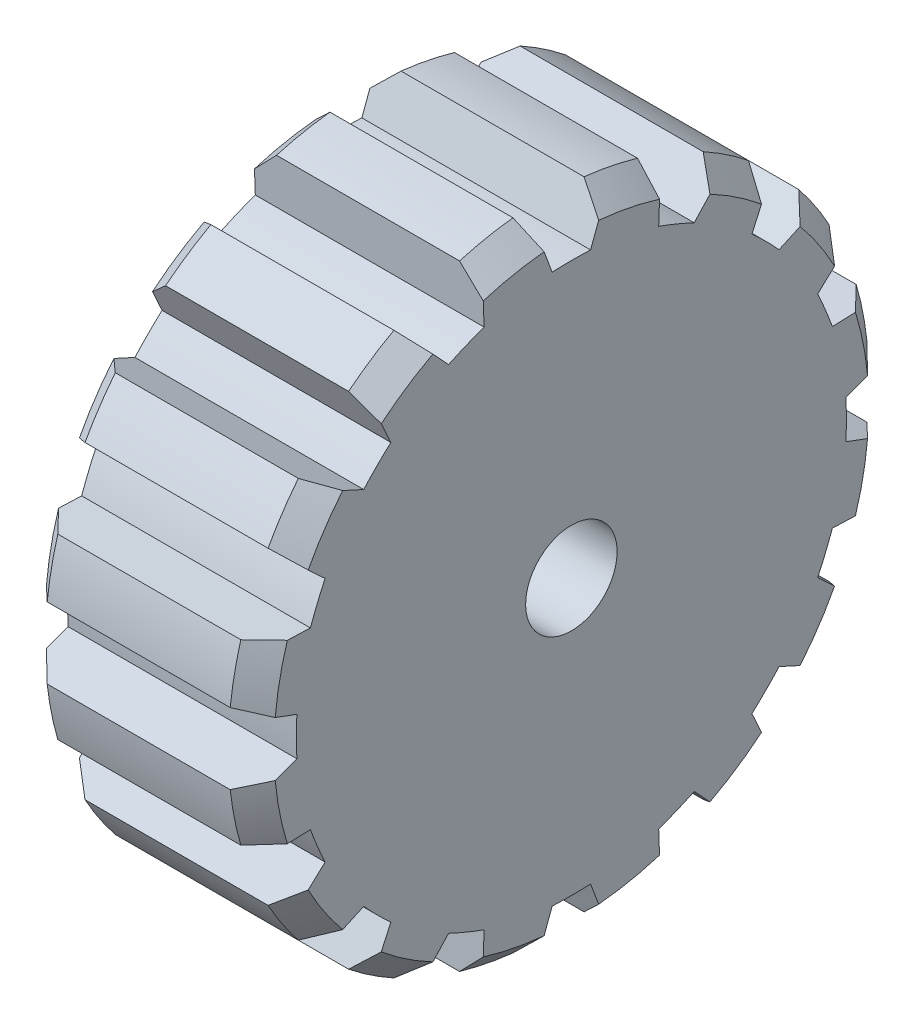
ISO-10303-21;
HEADER;
FILE_DESCRIPTION(('STEP AP214'),'2;1');
FILE_NAME('part.step','',(''),(''),'','','');
FILE_SCHEMA(('AUTOMOTIVE_DESIGN { 1 0 10303 214 1 1 1 1 }'));
ENDSEC;
DATA;
#1=APPLICATION_CONTEXT('core data for automotive mechanical design processes');
#2=APPLICATION_PROTOCOL_DEFINITION('international standard','automotive_design',2000,#1);
#3=PRODUCT_CONTEXT('',#1,'mechanical');
#4=PRODUCT('Part','Part','',(#3));
#5=PRODUCT_RELATED_PRODUCT_CATEGORY('part','',(#4));
#6=PRODUCT_DEFINITION_FORMATION('','',#4);
#7=PRODUCT_DEFINITION_CONTEXT('part definition',#1,'design');
#8=PRODUCT_DEFINITION('design','',#6,#7);
#9=PRODUCT_DEFINITION_SHAPE('','',#8);
#10=(LENGTH_UNIT() NAMED_UNIT(*) SI_UNIT(.MILLI.,.METRE.));
#11=(NAMED_UNIT(*) PLANE_ANGLE_UNIT() SI_UNIT($,.RADIAN.));
#12=(NAMED_UNIT(*) SI_UNIT($,.STERADIAN.) SOLID_ANGLE_UNIT());
#13=UNCERTAINTY_MEASURE_WITH_UNIT(LENGTH_MEASURE(1.E-05),#10,'distance_accuracy_value','');
#14=(GEOMETRIC_REPRESENTATION_CONTEXT(3) GLOBAL_UNCERTAINTY_ASSIGNED_CONTEXT((#13)) GLOBAL_UNIT_ASSIGNED_CONTEXT((#10,
#11,#12)) REPRESENTATION_CONTEXT('',''));
#15=CARTESIAN_POINT('',(0.,0.,0.));
#16=DIRECTION('',(0.,0.,1.));
#17=DIRECTION('',(1.,0.,0.));
#18=AXIS2_PLACEMENT_3D('',#15,#16,#17);
#19=CARTESIAN_POINT('',(0.,0.,0.));
#20=DIRECTION('',(1.,0.,0.));
#21=DIRECTION('',(0.,1.,0.));
#22=AXIS2_PLACEMENT_3D('',#19,#20,#21);
#23=CYLINDRICAL_SURFACE('',#22,7.);
#24=CARTESIAN_POINT('',(-4.5,0.,0.));
#25=DIRECTION('',(1.,0.,0.));
#26=DIRECTION('',(0.,1.,0.));
#27=AXIS2_PLACEMENT_3D('',#24,#25,#26);
#28=CIRCLE('',#27,7.);
#29=CARTESIAN_POINT('',(-4.5,6.95677271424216,0.77673251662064));
#30=VERTEX_POINT('',#29);
#31=CARTESIAN_POINT('',(-4.5,6.72446258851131,1.94463438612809));
#32=VERTEX_POINT('',#31);
#33=EDGE_CURVE('E1338',#30,#32,#28,.T.);
#34=ORIENTED_EDGE('',*,*,#33,.T.);
#35=DIRECTION('',(1.,0.,0.));
#36=VECTOR('',#35,1.);
#37=CARTESIAN_POINT('',(0.,6.72446258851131,1.94463438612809));
#38=LINE('',#37,#36);
#39=CARTESIAN_POINT('',(-0.500000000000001,6.72446258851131,1.94463438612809));
#40=VERTEX_POINT('',#39);
#41=EDGE_CURVE('E1568',#32,#40,#38,.T.);
#42=ORIENTED_EDGE('',*,*,#41,.T.);
#43=CARTESIAN_POINT('',(-0.500000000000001,0.,0.));
#44=DIRECTION('',(-1.,0.,0.));
#45=DIRECTION('',(0.,-1.,0.));
#46=AXIS2_PLACEMENT_3D('',#43,#44,#45);
#47=CIRCLE('',#46,7.);
#48=CARTESIAN_POINT('',(-0.500000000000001,6.95677271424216,0.77673251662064));
#49=VERTEX_POINT('',#48);
#50=EDGE_CURVE('E1340',#40,#49,#47,.T.);
#51=ORIENTED_EDGE('',*,*,#50,.T.);
#52=DIRECTION('',(1.,0.,0.));
#53=VECTOR('',#52,1.);
#54=CARTESIAN_POINT('',(0.,6.95677271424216,0.77673251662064));
#55=LINE('',#54,#53);
#56=EDGE_CURVE('E1304',#49,#30,#55,.F.);
#57=ORIENTED_EDGE('',*,*,#56,.T.);
#58=EDGE_LOOP('',(#34,#42,#51,#57));
#59=FACE_BOUND('',#58,.T.);
#60=ADVANCED_FACE('F30',(#59),#23,.T.);
#61=CARTESIAN_POINT('',(0.,0.,0.));
#62=DIRECTION('',(-1.,0.,0.));
#63=DIRECTION('',(0.,-1.,0.));
#64=AXIS2_PLACEMENT_3D('',#61,#62,#63);
#65=CONICAL_SURFACE('',#64,6.5,0.785398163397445);
#66=CARTESIAN_POINT('',(0.000199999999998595,6.20785354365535,1.92612419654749));
#67=CARTESIAN_POINT('',(-0.0830913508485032,6.2940944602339,1.92921422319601));
#68=CARTESIAN_POINT('',(-0.166437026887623,6.38028284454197,1.93230236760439));
#69=CARTESIAN_POINT('',(-0.333237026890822,6.55255454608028,1.93847489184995));
#70=CARTESIAN_POINT('',(-0.416691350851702,6.63863786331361,1.94155927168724));
#71=CARTESIAN_POINT('',(-0.5002,6.72466864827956,1.94464176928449));
#72=B_SPLINE_CURVE_WITH_KNOTS('',3,(#66,#67,#68,#69,#70,#71),.UNSPECIFIED.,.F.,.F.,(4,2,4),(0.,
0.359805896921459,0.719611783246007),.UNSPECIFIED.);
#73=CARTESIAN_POINT('',(0.,6.20806064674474,1.92613161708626));
#74=VERTEX_POINT('',#73);
#75=EDGE_CURVE('E1573',#74,#40,#72,.T.);
#76=ORIENTED_EDGE('',*,*,#75,.F.);
#77=CARTESIAN_POINT('',(0.,0.,0.));
#78=DIRECTION('',(-1.,0.,0.));
#79=DIRECTION('',(0.,-1.,0.));
#80=AXIS2_PLACEMENT_3D('',#77,#78,#79);
#81=CIRCLE('',#80,6.5);
#82=CARTESIAN_POINT('',(0.,6.47259882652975,0.596208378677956));
#83=VERTEX_POINT('',#82);
#84=EDGE_CURVE('E1334',#83,#74,#81,.F.);
#85=ORIENTED_EDGE('',*,*,#84,.F.);
#86=CARTESIAN_POINT('',(-0.5002,6.95696591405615,0.776804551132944));
#87=CARTESIAN_POINT('',(-0.416691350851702,6.87630421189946,0.746729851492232));
#88=CARTESIAN_POINT('',(-0.333237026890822,6.79559325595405,0.716636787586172));
#89=CARTESIAN_POINT('',(-0.166437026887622,6.63407283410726,0.656413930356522));
#90=CARTESIAN_POINT('',(-0.0830913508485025,6.55326336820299,0.626284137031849));
#91=CARTESIAN_POINT('',(0.000199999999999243,6.4724046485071,0.596135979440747));
#92=B_SPLINE_CURVE_WITH_KNOTS('',3,(#86,#87,#88,#89,#90,#91),.UNSPECIFIED.,.F.,.F.,(4,2,4),(0.,
0.359805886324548,0.719611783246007),.UNSPECIFIED.);
#93=EDGE_CURVE('E691',#49,#83,#92,.T.);
#94=ORIENTED_EDGE('',*,*,#93,.F.);
#95=ORIENTED_EDGE('',*,*,#50,.F.);
#96=EDGE_LOOP('',(#76,#85,#94,#95));
#97=FACE_BOUND('',#96,.T.);
#98=ADVANCED_FACE('F685',(#97),#65,.T.);
#99=CARTESIAN_POINT('',(-4.5,0.,0.));
#100=DIRECTION('',(1.,0.,0.));
#101=DIRECTION('',(0.,1.,0.));
#102=AXIS2_PLACEMENT_3D('',#99,#100,#101);
#103=CONICAL_SURFACE('',#102,7.,0.785398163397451);
#104=CARTESIAN_POINT('',(-4.4998,6.72466864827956,1.94464176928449));
#105=CARTESIAN_POINT('',(-4.5833086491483,6.63863786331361,1.94155927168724));
#106=CARTESIAN_POINT('',(-4.66676297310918,6.55255454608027,1.93847489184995));
#107=CARTESIAN_POINT('',(-4.83356297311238,6.38028284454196,1.93230236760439));
#108=CARTESIAN_POINT('',(-4.9169086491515,6.2940944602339,1.92921422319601));
#109=CARTESIAN_POINT('',(-5.0002,6.20785354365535,1.92612419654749));
#110=B_SPLINE_CURVE_WITH_KNOTS('',3,(#104,#105,#106,#107,#108,#109),.UNSPECIFIED.,.F.,.F.,(4,2,
4),(0.,0.35980588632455,0.719611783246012),.UNSPECIFIED.);
#111=CARTESIAN_POINT('',(-5.,6.20806064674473,1.92613161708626));
#112=VERTEX_POINT('',#111);
#113=EDGE_CURVE('E674',#32,#112,#110,.T.);
#114=ORIENTED_EDGE('',*,*,#113,.F.);
#115=ORIENTED_EDGE('',*,*,#33,.F.);
#116=CARTESIAN_POINT('',(-5.0002,6.47240464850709,0.596135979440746));
#117=CARTESIAN_POINT('',(-4.9169086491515,6.55326336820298,0.626284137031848));
#118=CARTESIAN_POINT('',(-4.83356297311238,6.63407283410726,0.656413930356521));
#119=CARTESIAN_POINT('',(-4.66676297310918,6.79559325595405,0.716636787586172));
#120=CARTESIAN_POINT('',(-4.5833086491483,6.87630421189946,0.746729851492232));
#121=CARTESIAN_POINT('',(-4.4998,6.95696591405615,0.776804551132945));
#122=B_SPLINE_CURVE_WITH_KNOTS('',3,(#116,#117,#118,#119,#120,#121),.UNSPECIFIED.,.F.,.F.,(4,2,
4),(0.,0.359805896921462,0.719611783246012),.UNSPECIFIED.);
#123=CARTESIAN_POINT('',(-5.,6.47259882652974,0.596208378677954));
#124=VERTEX_POINT('',#123);
#125=EDGE_CURVE('E1355',#124,#30,#122,.T.);
#126=ORIENTED_EDGE('',*,*,#125,.F.);
#127=CARTESIAN_POINT('',(-5.,0.,0.));
#128=DIRECTION('',(1.,0.,0.));
#129=DIRECTION('',(0.,1.,0.));
#130=AXIS2_PLACEMENT_3D('',#127,#128,#129);
#131=CIRCLE('',#130,6.5);
#132=EDGE_CURVE('E1344',#112,#124,#131,.F.);
#133=ORIENTED_EDGE('',*,*,#132,.F.);
#134=EDGE_LOOP('',(#114,#115,#126,#133));
#135=FACE_BOUND('',#134,.T.);
#136=ADVANCED_FACE('F1385',(#135),#103,.T.);
#137=CARTESIAN_POINT('',(-0.500000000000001,5.46841399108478,4.36994833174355));
#138=VERTEX_POINT('',#137);
#139=CARTESIAN_POINT('',(-0.500000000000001,6.1299772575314,3.3798489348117));
#140=VERTEX_POINT('',#139);
#141=EDGE_CURVE('E1560',#138,#140,#47,.T.);
#142=ORIENTED_EDGE('',*,*,#141,.T.);
#143=DIRECTION('',(1.,0.,0.));
#144=VECTOR('',#143,1.);
#145=CARTESIAN_POINT('',(0.,6.1299772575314,3.3798489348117));
#146=LINE('',#145,#144);
#147=CARTESIAN_POINT('',(-4.5,6.1299772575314,3.3798489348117));
#148=VERTEX_POINT('',#147);
#149=EDGE_CURVE('E654',#140,#148,#146,.F.);
#150=ORIENTED_EDGE('',*,*,#149,.T.);
#151=CARTESIAN_POINT('',(-4.5,5.46841399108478,4.36994833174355));
#152=VERTEX_POINT('',#151);
#153=EDGE_CURVE('E1341',#148,#152,#28,.T.);
#154=ORIENTED_EDGE('',*,*,#153,.T.);
#155=DIRECTION('',(1.,0.,0.));
#156=VECTOR('',#155,1.);
#157=CARTESIAN_POINT('',(0.,5.46841399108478,4.36994833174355));
#158=LINE('',#157,#156);
#159=EDGE_CURVE('E960',#152,#138,#158,.T.);
#160=ORIENTED_EDGE('',*,*,#159,.T.);
#161=EDGE_LOOP('',(#142,#150,#154,#160));
#162=FACE_BOUND('',#161,.T.);
#163=ADVANCED_FACE('F1391',(#162),#23,.T.);
#164=CARTESIAN_POINT('',(-0.5002,6.13012818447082,3.3799894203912));
#165=CARTESIAN_POINT('',(-0.416691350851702,6.06711557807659,3.32133612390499));
#166=CARTESIAN_POINT('',(-0.333237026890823,6.00406449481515,3.26264701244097));
#167=CARTESIAN_POINT('',(-0.166437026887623,5.8778853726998,3.14519715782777));
#168=CARTESIAN_POINT('',(-0.0830913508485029,5.8147573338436,3.08643641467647));
#169=CARTESIAN_POINT('',(0.000199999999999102,5.75159081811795,3.02763985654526));
#170=B_SPLINE_CURVE_WITH_KNOTS('',3,(#164,#165,#166,#167,#168,#169),.UNSPECIFIED.,.F.,.F.,(4,2,
4),(0.,0.359805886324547,0.719611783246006),.UNSPECIFIED.);
#171=CARTESIAN_POINT('',(0.,5.75174250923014,3.02778105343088));
#172=VERTEX_POINT('',#171);
#173=EDGE_CURVE('E636',#140,#172,#170,.T.);
#174=ORIENTED_EDGE('',*,*,#173,.F.);
#175=ORIENTED_EDGE('',*,*,#141,.F.);
#176=CARTESIAN_POINT('',(0.000199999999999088,4.99821301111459,4.15514942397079));
#177=CARTESIAN_POINT('',(-0.083091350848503,5.07670672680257,4.19100720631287));
#178=CARTESIAN_POINT('',(-0.166437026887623,5.15515262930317,4.22684314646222));
#179=CARTESIAN_POINT('',(-0.333237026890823,5.31194880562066,4.29847134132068));
#180=CARTESIAN_POINT('',(-0.416691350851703,5.39029907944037,4.33426359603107));
#181=CARTESIAN_POINT('',(-0.500200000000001,5.46860154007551,4.37003400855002));
#182=B_SPLINE_CURVE_WITH_KNOTS('',3,(#176,#177,#178,#179,#180,#181),.UNSPECIFIED.,.F.,.F.,(4,2,
4),(0.,0.35980589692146,0.719611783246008),.UNSPECIFIED.);
#183=CARTESIAN_POINT('',(0.,4.99840150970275,4.15523553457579));
#184=VERTEX_POINT('',#183);
#185=EDGE_CURVE('E953',#184,#138,#182,.T.);
#186=ORIENTED_EDGE('',*,*,#185,.F.);
#187=EDGE_CURVE('E1337',#172,#184,#81,.F.);
#188=ORIENTED_EDGE('',*,*,#187,.F.);
#189=EDGE_LOOP('',(#174,#175,#186,#188));
#190=FACE_BOUND('',#189,.T.);
#191=ADVANCED_FACE('F1397',(#190),#65,.T.);
#192=CARTESIAN_POINT('',(-5.0002,5.75159081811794,3.02763985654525));
#193=CARTESIAN_POINT('',(-4.9169086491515,5.8147573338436,3.08643641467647));
#194=CARTESIAN_POINT('',(-4.83356297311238,5.87788537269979,3.14519715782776));
#195=CARTESIAN_POINT('',(-4.66676297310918,6.00406449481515,3.26264701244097));
#196=CARTESIAN_POINT('',(-4.5833086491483,6.06711557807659,3.32133612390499));
#197=CARTESIAN_POINT('',(-4.4998,6.13012818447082,3.3799894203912));
#198=B_SPLINE_CURVE_WITH_KNOTS('',3,(#192,#193,#194,#195,#196,#197),.UNSPECIFIED.,.F.,.F.,(4,2,
4),(0.,0.359805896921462,0.719611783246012),.UNSPECIFIED.);
#199=CARTESIAN_POINT('',(-5.,5.75174250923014,3.02778105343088));
#200=VERTEX_POINT('',#199);
#201=EDGE_CURVE('E646',#200,#148,#198,.T.);
#202=ORIENTED_EDGE('',*,*,#201,.F.);
#203=CARTESIAN_POINT('',(-5.,4.99840150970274,4.15523553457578));
#204=VERTEX_POINT('',#203);
#205=EDGE_CURVE('E1581',#204,#200,#131,.F.);
#206=ORIENTED_EDGE('',*,*,#205,.F.);
#207=CARTESIAN_POINT('',(-4.4998,5.46860154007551,4.37003400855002));
#208=CARTESIAN_POINT('',(-4.5833086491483,5.39029907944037,4.33426359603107));
#209=CARTESIAN_POINT('',(-4.66676297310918,5.31194880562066,4.29847134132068));
#210=CARTESIAN_POINT('',(-4.83356297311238,5.15515262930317,4.22684314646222));
#211=CARTESIAN_POINT('',(-4.9169086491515,5.07670672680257,4.19100720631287));
#212=CARTESIAN_POINT('',(-5.0002,4.99821301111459,4.15514942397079));
#213=B_SPLINE_CURVE_WITH_KNOTS('',3,(#207,#208,#209,#210,#211,#212),.UNSPECIFIED.,.F.,.F.,(4,2,
4),(0.,0.35980588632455,0.719611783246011),.UNSPECIFIED.);
#214=EDGE_CURVE('E1780',#152,#204,#213,.T.);
#215=ORIENTED_EDGE('',*,*,#214,.F.);
#216=ORIENTED_EDGE('',*,*,#153,.F.);
#217=EDGE_LOOP('',(#202,#206,#215,#216));
#218=FACE_BOUND('',#217,.T.);
#219=ADVANCED_FACE('F1539',(#218),#103,.T.);
#220=CARTESIAN_POINT('',(-0.500000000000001,3.37984893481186,6.12997725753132));
#221=VERTEX_POINT('',#220);
#222=CARTESIAN_POINT('',(-0.500000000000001,4.36994833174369,5.46841399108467));
#223=VERTEX_POINT('',#222);
#224=EDGE_CURVE('E1552',#221,#223,#47,.T.);
#225=ORIENTED_EDGE('',*,*,#224,.T.);
#226=DIRECTION('',(1.,0.,0.));
#227=VECTOR('',#226,1.);
#228=CARTESIAN_POINT('',(0.,4.36994833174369,5.46841399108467));
#229=LINE('',#228,#227);
#230=CARTESIAN_POINT('',(-4.5,4.36994833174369,5.46841399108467));
#231=VERTEX_POINT('',#230);
#232=EDGE_CURVE('E1553',#223,#231,#229,.F.);
#233=ORIENTED_EDGE('',*,*,#232,.T.);
#234=CARTESIAN_POINT('',(-4.5,3.37984893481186,6.12997725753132));
#235=VERTEX_POINT('',#234);
#236=EDGE_CURVE('E1782',#231,#235,#28,.T.);
#237=ORIENTED_EDGE('',*,*,#236,.T.);
#238=DIRECTION('',(1.,0.,0.));
#239=VECTOR('',#238,1.);
#240=CARTESIAN_POINT('',(0.,3.37984893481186,6.12997725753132));
#241=LINE('',#240,#239);
#242=EDGE_CURVE('E1556',#235,#221,#241,.T.);
#243=ORIENTED_EDGE('',*,*,#242,.T.);
#244=EDGE_LOOP('',(#225,#233,#237,#243));
#245=FACE_BOUND('',#244,.T.);
#246=ADVANCED_FACE('F1401',(#245),#23,.T.);
#247=CARTESIAN_POINT('',(-0.5002,4.37003400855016,5.4686015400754));
#248=CARTESIAN_POINT('',(-0.416691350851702,4.33426359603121,5.39029907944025));
#249=CARTESIAN_POINT('',(-0.333237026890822,4.29847134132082,5.31194880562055));
#250=CARTESIAN_POINT('',(-0.166437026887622,4.22684314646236,5.15515262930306));
#251=CARTESIAN_POINT('',(-0.0830913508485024,4.191007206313,5.07670672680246));
#252=CARTESIAN_POINT('',(0.000199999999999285,4.15514942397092,4.99821301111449));
#253=B_SPLINE_CURVE_WITH_KNOTS('',3,(#247,#248,#249,#250,#251,#252),.UNSPECIFIED.,.F.,.F.,(4,2,
4),(0.,0.359805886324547,0.719611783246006),.UNSPECIFIED.);
#254=CARTESIAN_POINT('',(0.,4.15523553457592,4.99840150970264));
#255=VERTEX_POINT('',#254);
#256=EDGE_CURVE('E945',#223,#255,#253,.T.);
#257=ORIENTED_EDGE('',*,*,#256,.F.);
#258=ORIENTED_EDGE('',*,*,#224,.F.);
#259=CARTESIAN_POINT('',(0.000199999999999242,3.0276398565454,5.75159081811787));
#260=CARTESIAN_POINT('',(-0.0830913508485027,3.08643641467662,5.81475733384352));
#261=CARTESIAN_POINT('',(-0.166437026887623,3.14519715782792,5.87788537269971));
#262=CARTESIAN_POINT('',(-0.333237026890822,3.26264701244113,6.00406449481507));
#263=CARTESIAN_POINT('',(-0.416691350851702,3.32133612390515,6.0671155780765));
#264=CARTESIAN_POINT('',(-0.5002,3.37998942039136,6.13012818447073));
#265=B_SPLINE_CURVE_WITH_KNOTS('',3,(#259,#260,#261,#262,#263,#264),.UNSPECIFIED.,.F.,.F.,(4,2,
4),(0.,0.35980589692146,0.719611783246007),.UNSPECIFIED.);
#266=CARTESIAN_POINT('',(0.,3.02778105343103,5.75174250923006));
#267=VERTEX_POINT('',#266);
#268=EDGE_CURVE('E936',#267,#221,#265,.T.);
#269=ORIENTED_EDGE('',*,*,#268,.F.);
#270=EDGE_CURVE('E2052',#255,#267,#81,.F.);
#271=ORIENTED_EDGE('',*,*,#270,.F.);
#272=EDGE_LOOP('',(#257,#258,#269,#271));
#273=FACE_BOUND('',#272,.T.);
#274=ADVANCED_FACE('F1537',(#273),#65,.T.);
#275=CARTESIAN_POINT('',(-5.0002,4.15514942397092,4.99821301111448));
#276=CARTESIAN_POINT('',(-4.9169086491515,4.191007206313,5.07670672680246));
#277=CARTESIAN_POINT('',(-4.83356297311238,4.22684314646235,5.15515262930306));
#278=CARTESIAN_POINT('',(-4.66676297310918,4.29847134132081,5.31194880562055));
#279=CARTESIAN_POINT('',(-4.5833086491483,4.33426359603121,5.39029907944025));
#280=CARTESIAN_POINT('',(-4.4998,4.37003400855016,5.4686015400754));
#281=B_SPLINE_CURVE_WITH_KNOTS('',3,(#275,#276,#277,#278,#279,#280),.UNSPECIFIED.,.F.,.F.,(4,2,
4),(0.,0.359805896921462,0.719611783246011),.UNSPECIFIED.);
#282=CARTESIAN_POINT('',(-5.,4.15523553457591,4.99840150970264));
#283=VERTEX_POINT('',#282);
#284=EDGE_CURVE('E2663',#283,#231,#281,.T.);
#285=ORIENTED_EDGE('',*,*,#284,.F.);
#286=CARTESIAN_POINT('',(-5.,3.02778105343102,5.75174250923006));
#287=VERTEX_POINT('',#286);
#288=EDGE_CURVE('E1583',#287,#283,#131,.F.);
#289=ORIENTED_EDGE('',*,*,#288,.F.);
#290=CARTESIAN_POINT('',(-4.4998,3.37998942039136,6.13012818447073));
#291=CARTESIAN_POINT('',(-4.5833086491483,3.32133612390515,6.0671155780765));
#292=CARTESIAN_POINT('',(-4.66676297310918,3.26264701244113,6.00406449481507));
#293=CARTESIAN_POINT('',(-4.83356297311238,3.14519715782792,5.87788537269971));
#294=CARTESIAN_POINT('',(-4.9169086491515,3.08643641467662,5.81475733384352));
#295=CARTESIAN_POINT('',(-5.0002,3.0276398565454,5.75159081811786));
#296=B_SPLINE_CURVE_WITH_KNOTS('',3,(#290,#291,#292,#293,#294,#295),.UNSPECIFIED.,.F.,.F.,(4,2,
4),(0.,0.35980588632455,0.719611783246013),.UNSPECIFIED.);
#297=EDGE_CURVE('E2672',#235,#287,#296,.T.);
#298=ORIENTED_EDGE('',*,*,#297,.F.);
#299=ORIENTED_EDGE('',*,*,#236,.F.);
#300=EDGE_LOOP('',(#285,#289,#298,#299));
#301=FACE_BOUND('',#300,.T.);
#302=ADVANCED_FACE('F1529',(#301),#103,.T.);
#303=CARTESIAN_POINT('',(-0.500000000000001,0.776732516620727,6.95677271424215));
#304=VERTEX_POINT('',#303);
#305=CARTESIAN_POINT('',(-0.500000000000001,1.94463438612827,6.72446258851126));
#306=VERTEX_POINT('',#305);
#307=EDGE_CURVE('E1559',#304,#306,#47,.T.);
#308=ORIENTED_EDGE('',*,*,#307,.T.);
#309=DIRECTION('',(1.,0.,0.));
#310=VECTOR('',#309,1.);
#311=CARTESIAN_POINT('',(0.,1.94463438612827,6.72446258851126));
#312=LINE('',#311,#310);
#313=CARTESIAN_POINT('',(-4.5,1.94463438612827,6.72446258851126));
#314=VERTEX_POINT('',#313);
#315=EDGE_CURVE('E977',#306,#314,#312,.F.);
#316=ORIENTED_EDGE('',*,*,#315,.T.);
#317=CARTESIAN_POINT('',(-4.5,0.776732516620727,6.95677271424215));
#318=VERTEX_POINT('',#317);
#319=EDGE_CURVE('E1783',#314,#318,#28,.T.);
#320=ORIENTED_EDGE('',*,*,#319,.T.);
#321=DIRECTION('',(1.,0.,0.));
#322=VECTOR('',#321,1.);
#323=CARTESIAN_POINT('',(0.,0.776732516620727,6.95677271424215));
#324=LINE('',#323,#322);
#325=EDGE_CURVE('E999',#318,#304,#324,.T.);
#326=ORIENTED_EDGE('',*,*,#325,.T.);
#327=EDGE_LOOP('',(#308,#316,#320,#326));
#328=FACE_BOUND('',#327,.T.);
#329=ADVANCED_FACE('F1521',(#328),#23,.T.);
#330=CARTESIAN_POINT('',(-0.500200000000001,1.94464176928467,6.72466864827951));
#331=CARTESIAN_POINT('',(-0.416691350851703,1.94155927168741,6.63863786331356));
#332=CARTESIAN_POINT('',(-0.333237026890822,1.93847489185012,6.55255454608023));
#333=CARTESIAN_POINT('',(-0.166437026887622,1.93230236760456,6.38028284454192));
#334=CARTESIAN_POINT('',(-0.0830913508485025,1.92921422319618,6.29409446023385));
#335=CARTESIAN_POINT('',(0.000199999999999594,1.92612419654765,6.2078535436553));
#336=B_SPLINE_CURVE_WITH_KNOTS('',3,(#330,#331,#332,#333,#334,#335),.UNSPECIFIED.,.F.,.F.,(4,2,
4),(0.,0.359805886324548,0.719611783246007),.UNSPECIFIED.);
#337=CARTESIAN_POINT('',(0.,1.92613161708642,6.20806064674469));
#338=VERTEX_POINT('',#337);
#339=EDGE_CURVE('E927',#306,#338,#336,.T.);
#340=ORIENTED_EDGE('',*,*,#339,.F.);
#341=ORIENTED_EDGE('',*,*,#307,.F.);
#342=CARTESIAN_POINT('',(0.00019999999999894,0.596135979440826,6.47240464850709));
#343=CARTESIAN_POINT('',(-0.0830913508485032,0.62628413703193,6.55326336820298));
#344=CARTESIAN_POINT('',(-0.166437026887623,0.656413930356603,6.63407283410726));
#345=CARTESIAN_POINT('',(-0.333237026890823,0.716636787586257,6.79559325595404));
#346=CARTESIAN_POINT('',(-0.416691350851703,0.746729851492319,6.87630421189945));
#347=CARTESIAN_POINT('',(-0.500200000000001,0.776804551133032,6.95696591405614));
#348=B_SPLINE_CURVE_WITH_KNOTS('',3,(#342,#343,#344,#345,#346,#347),.UNSPECIFIED.,.F.,.F.,(4,2,
4),(0.,0.35980589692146,0.719611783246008),.UNSPECIFIED.);
#349=CARTESIAN_POINT('',(0.,0.596208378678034,6.47259882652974));
#350=VERTEX_POINT('',#349);
#351=EDGE_CURVE('E918',#350,#304,#348,.T.);
#352=ORIENTED_EDGE('',*,*,#351,.F.);
#353=EDGE_CURVE('E2050',#338,#350,#81,.F.);
#354=ORIENTED_EDGE('',*,*,#353,.F.);
#355=EDGE_LOOP('',(#340,#341,#352,#354));
#356=FACE_BOUND('',#355,.T.);
#357=ADVANCED_FACE('F1527',(#356),#65,.T.);
#358=CARTESIAN_POINT('',(-5.0002,1.92612419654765,6.2078535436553));
#359=CARTESIAN_POINT('',(-4.9169086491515,1.92921422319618,6.29409446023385));
#360=CARTESIAN_POINT('',(-4.83356297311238,1.93230236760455,6.38028284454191));
#361=CARTESIAN_POINT('',(-4.66676297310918,1.93847489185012,6.55255454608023));
#362=CARTESIAN_POINT('',(-4.5833086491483,1.94155927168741,6.63863786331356));
#363=CARTESIAN_POINT('',(-4.4998,1.94464176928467,6.72466864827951));
#364=B_SPLINE_CURVE_WITH_KNOTS('',3,(#358,#359,#360,#361,#362,#363),.UNSPECIFIED.,.F.,.F.,(4,2,
4),(0.,0.359805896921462,0.719611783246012),.UNSPECIFIED.);
#365=CARTESIAN_POINT('',(-5.,1.92613161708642,6.20806064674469));
#366=VERTEX_POINT('',#365);
#367=EDGE_CURVE('E972',#366,#314,#364,.T.);
#368=ORIENTED_EDGE('',*,*,#367,.F.);
#369=CARTESIAN_POINT('',(-5.,0.596208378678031,6.47259882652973));
#370=VERTEX_POINT('',#369);
#371=EDGE_CURVE('E1587',#370,#366,#131,.F.);
#372=ORIENTED_EDGE('',*,*,#371,.F.);
#373=CARTESIAN_POINT('',(-4.4998,0.776804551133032,6.95696591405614));
#374=CARTESIAN_POINT('',(-4.5833086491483,0.746729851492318,6.87630421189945));
#375=CARTESIAN_POINT('',(-4.66676297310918,0.716636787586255,6.79559325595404));
#376=CARTESIAN_POINT('',(-4.83356297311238,0.656413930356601,6.63407283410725));
#377=CARTESIAN_POINT('',(-4.9169086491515,0.626284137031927,6.55326336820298));
#378=CARTESIAN_POINT('',(-5.0002,0.596135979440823,6.47240464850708));
#379=B_SPLINE_CURVE_WITH_KNOTS('',3,(#373,#374,#375,#376,#377,#378),.UNSPECIFIED.,.F.,.F.,(4,2,
4),(0.,0.359805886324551,0.719611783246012),.UNSPECIFIED.);
#380=EDGE_CURVE('E995',#318,#370,#379,.T.);
#381=ORIENTED_EDGE('',*,*,#380,.F.);
#382=ORIENTED_EDGE('',*,*,#319,.F.);
#383=EDGE_LOOP('',(#368,#372,#381,#382));
#384=FACE_BOUND('',#383,.T.);
#385=ADVANCED_FACE('F1518',(#384),#103,.T.);
#386=CARTESIAN_POINT('',(-0.500000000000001,-1.94463438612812,6.7244625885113));
#387=VERTEX_POINT('',#386);
#388=CARTESIAN_POINT('',(-0.500000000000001,-0.776732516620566,6.95677271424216));
#389=VERTEX_POINT('',#388);
#390=EDGE_CURVE('E1561',#387,#389,#47,.T.);
#391=ORIENTED_EDGE('',*,*,#390,.T.);
#392=DIRECTION('',(1.,0.,0.));
#393=VECTOR('',#392,1.);
#394=CARTESIAN_POINT('',(0.,-0.776732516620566,6.95677271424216));
#395=LINE('',#394,#393);
#396=CARTESIAN_POINT('',(-4.5,-0.776732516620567,6.95677271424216));
#397=VERTEX_POINT('',#396);
#398=EDGE_CURVE('E1848',#389,#397,#395,.F.);
#399=ORIENTED_EDGE('',*,*,#398,.T.);
#400=CARTESIAN_POINT('',(-4.5,-1.94463438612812,6.7244625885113));
#401=VERTEX_POINT('',#400);
#402=EDGE_CURVE('E1784',#397,#401,#28,.T.);
#403=ORIENTED_EDGE('',*,*,#402,.T.);
#404=DIRECTION('',(1.,0.,0.));
#405=VECTOR('',#404,1.);
#406=CARTESIAN_POINT('',(0.,-1.94463438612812,6.7244625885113));
#407=LINE('',#406,#405);
#408=EDGE_CURVE('E1849',#401,#387,#407,.T.);
#409=ORIENTED_EDGE('',*,*,#408,.T.);
#410=EDGE_LOOP('',(#391,#399,#403,#409));
#411=FACE_BOUND('',#410,.T.);
#412=ADVANCED_FACE('F1510',(#411),#23,.T.);
#413=CARTESIAN_POINT('',(-0.5002,-0.776804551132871,6.95696591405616));
#414=CARTESIAN_POINT('',(-0.416691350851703,-0.74672985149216,6.87630421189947));
#415=CARTESIAN_POINT('',(-0.333237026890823,-0.716636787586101,6.79559325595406));
#416=CARTESIAN_POINT('',(-0.166437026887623,-0.656413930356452,6.63407283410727));
#417=CARTESIAN_POINT('',(-0.0830913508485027,-0.62628413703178,6.553263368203));
#418=CARTESIAN_POINT('',(0.000199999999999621,-0.596135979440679,6.4724046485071));
#419=B_SPLINE_CURVE_WITH_KNOTS('',3,(#413,#414,#415,#416,#417,#418),.UNSPECIFIED.,.F.,.F.,(4,2,
4),(0.,0.359805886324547,0.719611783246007),.UNSPECIFIED.);
#420=CARTESIAN_POINT('',(0.,-0.596208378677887,6.47259882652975));
#421=VERTEX_POINT('',#420);
#422=EDGE_CURVE('E909',#389,#421,#419,.T.);
#423=ORIENTED_EDGE('',*,*,#422,.F.);
#424=ORIENTED_EDGE('',*,*,#390,.F.);
#425=CARTESIAN_POINT('',(0.00019999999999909,-1.92612419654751,6.20785354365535));
#426=CARTESIAN_POINT('',(-0.083091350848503,-1.92921422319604,6.2940944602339));
#427=CARTESIAN_POINT('',(-0.166437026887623,-1.93230236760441,6.38028284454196));
#428=CARTESIAN_POINT('',(-0.333237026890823,-1.93847489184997,6.55255454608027));
#429=CARTESIAN_POINT('',(-0.416691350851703,-1.94155927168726,6.63863786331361));
#430=CARTESIAN_POINT('',(-0.500200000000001,-1.94464176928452,6.72466864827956));
#431=B_SPLINE_CURVE_WITH_KNOTS('',3,(#425,#426,#427,#428,#429,#430),.UNSPECIFIED.,.F.,.F.,(4,2,
4),(0.,0.35980589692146,0.719611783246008),.UNSPECIFIED.);
#432=CARTESIAN_POINT('',(0.,-1.92613161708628,6.20806064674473));
#433=VERTEX_POINT('',#432);
#434=EDGE_CURVE('E900',#433,#387,#431,.T.);
#435=ORIENTED_EDGE('',*,*,#434,.F.);
#436=EDGE_CURVE('E1853',#421,#433,#81,.F.);
#437=ORIENTED_EDGE('',*,*,#436,.F.);
#438=EDGE_LOOP('',(#423,#424,#435,#437));
#439=FACE_BOUND('',#438,.T.);
#440=ADVANCED_FACE('F1516',(#439),#65,.T.);
#441=CARTESIAN_POINT('',(-5.0002,-0.596135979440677,6.4724046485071));
#442=CARTESIAN_POINT('',(-4.9169086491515,-0.626284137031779,6.55326336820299));
#443=CARTESIAN_POINT('',(-4.83356297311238,-0.656413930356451,6.63407283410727));
#444=CARTESIAN_POINT('',(-4.66676297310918,-0.7166367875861,6.79559325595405));
#445=CARTESIAN_POINT('',(-4.5833086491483,-0.74672985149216,6.87630421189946));
#446=CARTESIAN_POINT('',(-4.4998,-0.776804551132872,6.95696591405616));
#447=B_SPLINE_CURVE_WITH_KNOTS('',3,(#441,#442,#443,#444,#445,#446),.UNSPECIFIED.,.F.,.F.,(4,2,
4),(0.,0.359805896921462,0.719611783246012),.UNSPECIFIED.);
#448=CARTESIAN_POINT('',(-5.,-0.596208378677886,6.47259882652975));
#449=VERTEX_POINT('',#448);
#450=EDGE_CURVE('E1857',#449,#397,#447,.T.);
#451=ORIENTED_EDGE('',*,*,#450,.F.);
#452=CARTESIAN_POINT('',(-5.,-1.92613161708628,6.20806064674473));
#453=VERTEX_POINT('',#452);
#454=EDGE_CURVE('E1592',#453,#449,#131,.F.);
#455=ORIENTED_EDGE('',*,*,#454,.F.);
#456=CARTESIAN_POINT('',(-4.4998,-1.94464176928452,6.72466864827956));
#457=CARTESIAN_POINT('',(-4.5833086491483,-1.94155927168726,6.63863786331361));
#458=CARTESIAN_POINT('',(-4.66676297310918,-1.93847489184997,6.55255454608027));
#459=CARTESIAN_POINT('',(-4.83356297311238,-1.93230236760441,6.38028284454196));
#460=CARTESIAN_POINT('',(-4.9169086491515,-1.92921422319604,6.29409446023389));
#461=CARTESIAN_POINT('',(-5.0002,-1.92612419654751,6.20785354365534));
#462=B_SPLINE_CURVE_WITH_KNOTS('',3,(#456,#457,#458,#459,#460,#461),.UNSPECIFIED.,.F.,.F.,(4,2,
4),(0.,0.35980588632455,0.719611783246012),.UNSPECIFIED.);
#463=EDGE_CURVE('E1873',#401,#453,#462,.T.);
#464=ORIENTED_EDGE('',*,*,#463,.F.);
#465=ORIENTED_EDGE('',*,*,#402,.F.);
#466=EDGE_LOOP('',(#451,#455,#464,#465));
#467=FACE_BOUND('',#466,.T.);
#468=ADVANCED_FACE('F1507',(#467),#103,.T.);
#469=CARTESIAN_POINT('',(-0.500000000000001,-4.36994833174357,5.46841399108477));
#470=VERTEX_POINT('',#469);
#471=CARTESIAN_POINT('',(-0.500000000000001,-3.37984893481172,6.12997725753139));
#472=VERTEX_POINT('',#471);
#473=EDGE_CURVE('E1845',#470,#472,#47,.T.);
#474=ORIENTED_EDGE('',*,*,#473,.T.);
#475=DIRECTION('',(1.,0.,0.));
#476=VECTOR('',#475,1.);
#477=CARTESIAN_POINT('',(0.,-3.37984893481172,6.12997725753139));
#478=LINE('',#477,#476);
#479=CARTESIAN_POINT('',(-4.5,-3.37984893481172,6.12997725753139));
#480=VERTEX_POINT('',#479);
#481=EDGE_CURVE('E1027',#472,#480,#478,.F.);
#482=ORIENTED_EDGE('',*,*,#481,.T.);
#483=CARTESIAN_POINT('',(-4.5,-4.36994833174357,5.46841399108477));
#484=VERTEX_POINT('',#483);
#485=EDGE_CURVE('E1787',#480,#484,#28,.T.);
#486=ORIENTED_EDGE('',*,*,#485,.T.);
#487=DIRECTION('',(1.,0.,0.));
#488=VECTOR('',#487,1.);
#489=CARTESIAN_POINT('',(0.,-4.36994833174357,5.46841399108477));
#490=LINE('',#489,#488);
#491=EDGE_CURVE('E1047',#484,#470,#490,.T.);
#492=ORIENTED_EDGE('',*,*,#491,.T.);
#493=EDGE_LOOP('',(#474,#482,#486,#492));
#494=FACE_BOUND('',#493,.T.);
#495=ADVANCED_FACE('F1499',(#494),#23,.T.);
#496=CARTESIAN_POINT('',(-0.500200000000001,-3.37998942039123,6.13012818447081));
#497=CARTESIAN_POINT('',(-0.416691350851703,-3.32133612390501,6.06711557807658));
#498=CARTESIAN_POINT('',(-0.333237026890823,-3.26264701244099,6.00406449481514));
#499=CARTESIAN_POINT('',(-0.166437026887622,-3.14519715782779,5.87788537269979));
#500=CARTESIAN_POINT('',(-0.0830913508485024,-3.08643641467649,5.81475733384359));
#501=CARTESIAN_POINT('',(0.000199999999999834,-3.02763985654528,5.75159081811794));
#502=B_SPLINE_CURVE_WITH_KNOTS('',3,(#496,#497,#498,#499,#500,#501),.UNSPECIFIED.,.F.,.F.,(4,2,
4),(0.,0.359805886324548,0.719611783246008),.UNSPECIFIED.);
#503=CARTESIAN_POINT('',(0.,-3.0277810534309,5.75174250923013));
#504=VERTEX_POINT('',#503);
#505=EDGE_CURVE('E891',#472,#504,#502,.T.);
#506=ORIENTED_EDGE('',*,*,#505,.F.);
#507=ORIENTED_EDGE('',*,*,#473,.F.);
#508=CARTESIAN_POINT('',(0.000199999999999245,-4.15514942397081,4.99821301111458));
#509=CARTESIAN_POINT('',(-0.0830913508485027,-4.19100720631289,5.07670672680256));
#510=CARTESIAN_POINT('',(-0.166437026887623,-4.22684314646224,5.15515262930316));
#511=CARTESIAN_POINT('',(-0.333237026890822,-4.2984713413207,5.31194880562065));
#512=CARTESIAN_POINT('',(-0.416691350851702,-4.33426359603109,5.39029907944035));
#513=CARTESIAN_POINT('',(-0.5002,-4.37003400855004,5.4686015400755));
#514=B_SPLINE_CURVE_WITH_KNOTS('',3,(#508,#509,#510,#511,#512,#513),.UNSPECIFIED.,.F.,.F.,(4,2,
4),(0.,0.35980589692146,0.719611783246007),.UNSPECIFIED.);
#515=CARTESIAN_POINT('',(0.,-4.1552355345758,4.99840150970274));
#516=VERTEX_POINT('',#515);
#517=EDGE_CURVE('E882',#516,#470,#514,.T.);
#518=ORIENTED_EDGE('',*,*,#517,.F.);
#519=EDGE_CURVE('E2045',#504,#516,#81,.F.);
#520=ORIENTED_EDGE('',*,*,#519,.F.);
#521=EDGE_LOOP('',(#506,#507,#518,#520));
#522=FACE_BOUND('',#521,.T.);
#523=ADVANCED_FACE('F1505',(#522),#65,.T.);
#524=CARTESIAN_POINT('',(-5.0002,-3.02763985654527,5.75159081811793));
#525=CARTESIAN_POINT('',(-4.9169086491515,-3.08643641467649,5.81475733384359));
#526=CARTESIAN_POINT('',(-4.83356297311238,-3.14519715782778,5.87788537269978));
#527=CARTESIAN_POINT('',(-4.66676297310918,-3.26264701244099,6.00406449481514));
#528=CARTESIAN_POINT('',(-4.5833086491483,-3.32133612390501,6.06711557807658));
#529=CARTESIAN_POINT('',(-4.4998,-3.37998942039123,6.13012818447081));
#530=B_SPLINE_CURVE_WITH_KNOTS('',3,(#524,#525,#526,#527,#528,#529),.UNSPECIFIED.,.F.,.F.,(4,2,
4),(0.,0.359805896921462,0.719611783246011),.UNSPECIFIED.);
#531=CARTESIAN_POINT('',(-5.,-3.0277810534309,5.75174250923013));
#532=VERTEX_POINT('',#531);
#533=EDGE_CURVE('E1022',#532,#480,#530,.T.);
#534=ORIENTED_EDGE('',*,*,#533,.F.);
#535=CARTESIAN_POINT('',(-5.,-4.1552355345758,4.99840150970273));
#536=VERTEX_POINT('',#535);
#537=EDGE_CURVE('E1597',#536,#532,#131,.F.);
#538=ORIENTED_EDGE('',*,*,#537,.F.);
#539=CARTESIAN_POINT('',(-4.4998,-4.37003400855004,5.4686015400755));
#540=CARTESIAN_POINT('',(-4.5833086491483,-4.33426359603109,5.39029907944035));
#541=CARTESIAN_POINT('',(-4.66676297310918,-4.29847134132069,5.31194880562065));
#542=CARTESIAN_POINT('',(-4.83356297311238,-4.22684314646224,5.15515262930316));
#543=CARTESIAN_POINT('',(-4.9169086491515,-4.19100720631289,5.07670672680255));
#544=CARTESIAN_POINT('',(-5.0002,-4.15514942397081,4.99821301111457));
#545=B_SPLINE_CURVE_WITH_KNOTS('',3,(#539,#540,#541,#542,#543,#544),.UNSPECIFIED.,.F.,.F.,(4,2,
4),(0.,0.359805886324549,0.719611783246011),.UNSPECIFIED.);
#546=EDGE_CURVE('E1043',#484,#536,#545,.T.);
#547=ORIENTED_EDGE('',*,*,#546,.F.);
#548=ORIENTED_EDGE('',*,*,#485,.F.);
#549=EDGE_LOOP('',(#534,#538,#547,#548));
#550=FACE_BOUND('',#549,.T.);
#551=ADVANCED_FACE('F1496',(#550),#103,.T.);
#552=CARTESIAN_POINT('',(-0.500000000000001,-6.12997725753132,3.37984893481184));
#553=VERTEX_POINT('',#552);
#554=CARTESIAN_POINT('',(-0.500000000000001,-5.46841399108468,4.36994833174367));
#555=VERTEX_POINT('',#554);
#556=EDGE_CURVE('E1844',#553,#555,#47,.T.);
#557=ORIENTED_EDGE('',*,*,#556,.T.);
#558=DIRECTION('',(1.,0.,0.));
#559=VECTOR('',#558,1.);
#560=CARTESIAN_POINT('',(0.,-5.46841399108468,4.36994833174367));
#561=LINE('',#560,#559);
#562=CARTESIAN_POINT('',(-4.5,-5.46841399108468,4.36994833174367));
#563=VERTEX_POINT('',#562);
#564=EDGE_CURVE('E1896',#555,#563,#561,.F.);
#565=ORIENTED_EDGE('',*,*,#564,.T.);
#566=CARTESIAN_POINT('',(-4.5,-6.12997725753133,3.37984893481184));
#567=VERTEX_POINT('',#566);
#568=EDGE_CURVE('E1792',#563,#567,#28,.T.);
#569=ORIENTED_EDGE('',*,*,#568,.T.);
#570=DIRECTION('',(1.,0.,0.));
#571=VECTOR('',#570,1.);
#572=CARTESIAN_POINT('',(0.,-6.12997725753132,3.37984893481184));
#573=LINE('',#572,#571);
#574=EDGE_CURVE('E1908',#567,#553,#573,.T.);
#575=ORIENTED_EDGE('',*,*,#574,.T.);
#576=EDGE_LOOP('',(#557,#565,#569,#575));
#577=FACE_BOUND('',#576,.T.);
#578=ADVANCED_FACE('F1488',(#577),#23,.T.);
#579=CARTESIAN_POINT('',(-0.5002,-5.46860154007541,4.37003400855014));
#580=CARTESIAN_POINT('',(-0.416691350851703,-5.39029907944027,4.33426359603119));
#581=CARTESIAN_POINT('',(-0.333237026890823,-5.31194880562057,4.2984713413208));
#582=CARTESIAN_POINT('',(-0.166437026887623,-5.15515262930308,4.22684314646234));
#583=CARTESIAN_POINT('',(-0.0830913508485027,-5.07670672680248,4.19100720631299));
#584=CARTESIAN_POINT('',(0.000199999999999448,-4.9982130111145,4.15514942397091));
#585=B_SPLINE_CURVE_WITH_KNOTS('',3,(#579,#580,#581,#582,#583,#584),.UNSPECIFIED.,.F.,.F.,(4,2,
4),(0.,0.359805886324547,0.719611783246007),.UNSPECIFIED.);
#586=CARTESIAN_POINT('',(0.,-4.99840150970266,4.1552355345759));
#587=VERTEX_POINT('',#586);
#588=EDGE_CURVE('E873',#555,#587,#585,.T.);
#589=ORIENTED_EDGE('',*,*,#588,.F.);
#590=ORIENTED_EDGE('',*,*,#556,.F.);
#591=CARTESIAN_POINT('',(0.000199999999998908,-5.75159081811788,3.02763985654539));
#592=CARTESIAN_POINT('',(-0.0830913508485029,-5.81475733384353,3.08643641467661));
#593=CARTESIAN_POINT('',(-0.166437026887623,-5.87788537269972,3.1451971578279));
#594=CARTESIAN_POINT('',(-0.333237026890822,-6.00406449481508,3.26264701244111));
#595=CARTESIAN_POINT('',(-0.416691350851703,-6.06711557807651,3.32133612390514));
#596=CARTESIAN_POINT('',(-0.500200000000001,-6.13012818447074,3.37998942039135));
#597=B_SPLINE_CURVE_WITH_KNOTS('',3,(#591,#592,#593,#594,#595,#596),.UNSPECIFIED.,.F.,.F.,(4,2,
4),(0.,0.35980589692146,0.719611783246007),.UNSPECIFIED.);
#598=CARTESIAN_POINT('',(0.,-5.75174250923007,3.02778105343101));
#599=VERTEX_POINT('',#598);
#600=EDGE_CURVE('E864',#599,#553,#597,.T.);
#601=ORIENTED_EDGE('',*,*,#600,.F.);
#602=EDGE_CURVE('E2042',#587,#599,#81,.F.);
#603=ORIENTED_EDGE('',*,*,#602,.F.);
#604=EDGE_LOOP('',(#589,#590,#601,#603));
#605=FACE_BOUND('',#604,.T.);
#606=ADVANCED_FACE('F1494',(#605),#65,.T.);
#607=CARTESIAN_POINT('',(-5.0002,-4.99821301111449,4.1551494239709));
#608=CARTESIAN_POINT('',(-4.9169086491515,-5.07670672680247,4.19100720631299));
#609=CARTESIAN_POINT('',(-4.83356297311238,-5.15515262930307,4.22684314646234));
#610=CARTESIAN_POINT('',(-4.66676297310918,-5.31194880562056,4.2984713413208));
#611=CARTESIAN_POINT('',(-4.5833086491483,-5.39029907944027,4.33426359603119));
#612=CARTESIAN_POINT('',(-4.4998,-5.46860154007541,4.37003400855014));
#613=B_SPLINE_CURVE_WITH_KNOTS('',3,(#607,#608,#609,#610,#611,#612),.UNSPECIFIED.,.F.,.F.,(4,2,
4),(0.,0.359805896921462,0.719611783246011),.UNSPECIFIED.);
#614=CARTESIAN_POINT('',(-5.,-4.99840150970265,4.1552355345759));
#615=VERTEX_POINT('',#614);
#616=EDGE_CURVE('E1891',#615,#563,#613,.T.);
#617=ORIENTED_EDGE('',*,*,#616,.F.);
#618=CARTESIAN_POINT('',(-5.,-5.75174250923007,3.02778105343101));
#619=VERTEX_POINT('',#618);
#620=EDGE_CURVE('E1602',#619,#615,#131,.F.);
#621=ORIENTED_EDGE('',*,*,#620,.F.);
#622=CARTESIAN_POINT('',(-4.4998,-6.13012818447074,3.37998942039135));
#623=CARTESIAN_POINT('',(-4.5833086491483,-6.06711557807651,3.32133612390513));
#624=CARTESIAN_POINT('',(-4.66676297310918,-6.00406449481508,3.26264701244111));
#625=CARTESIAN_POINT('',(-4.83356297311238,-5.87788537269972,3.1451971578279));
#626=CARTESIAN_POINT('',(-4.9169086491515,-5.81475733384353,3.0864364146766));
#627=CARTESIAN_POINT('',(-5.0002,-5.75159081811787,3.02763985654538));
#628=B_SPLINE_CURVE_WITH_KNOTS('',3,(#622,#623,#624,#625,#626,#627),.UNSPECIFIED.,.F.,.F.,(4,2,
4),(0.,0.359805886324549,0.719611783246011),.UNSPECIFIED.);
#629=EDGE_CURVE('E1904',#567,#619,#628,.T.);
#630=ORIENTED_EDGE('',*,*,#629,.F.);
#631=ORIENTED_EDGE('',*,*,#568,.F.);
#632=EDGE_LOOP('',(#617,#621,#630,#631));
#633=FACE_BOUND('',#632,.T.);
#634=ADVANCED_FACE('F1485',(#633),#103,.T.);
#635=CARTESIAN_POINT('',(-0.500000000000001,-6.95677271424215,0.776732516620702));
#636=VERTEX_POINT('',#635);
#637=CARTESIAN_POINT('',(-0.500000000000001,-6.72446258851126,1.94463438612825));
#638=VERTEX_POINT('',#637);
#639=EDGE_CURVE('E1842',#636,#638,#47,.T.);
#640=ORIENTED_EDGE('',*,*,#639,.T.);
#641=DIRECTION('',(1.,0.,0.));
#642=VECTOR('',#641,1.);
#643=CARTESIAN_POINT('',(0.,-6.72446258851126,1.94463438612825));
#644=LINE('',#643,#642);
#645=CARTESIAN_POINT('',(-4.5,-6.72446258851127,1.94463438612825));
#646=VERTEX_POINT('',#645);
#647=EDGE_CURVE('E1075',#638,#646,#644,.F.);
#648=ORIENTED_EDGE('',*,*,#647,.T.);
#649=CARTESIAN_POINT('',(-4.5,-6.95677271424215,0.776732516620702));
#650=VERTEX_POINT('',#649);
#651=EDGE_CURVE('E1795',#646,#650,#28,.T.);
#652=ORIENTED_EDGE('',*,*,#651,.T.);
#653=DIRECTION('',(1.,0.,0.));
#654=VECTOR('',#653,1.);
#655=CARTESIAN_POINT('',(0.,-6.95677271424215,0.776732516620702));
#656=LINE('',#655,#654);
#657=EDGE_CURVE('E1095',#650,#636,#656,.T.);
#658=ORIENTED_EDGE('',*,*,#657,.T.);
#659=EDGE_LOOP('',(#640,#648,#652,#658));
#660=FACE_BOUND('',#659,.T.);
#661=ADVANCED_FACE('F1477',(#660),#23,.T.);
#662=CARTESIAN_POINT('',(-0.500200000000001,-6.72466864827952,1.94464176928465));
#663=CARTESIAN_POINT('',(-0.416691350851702,-6.63863786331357,1.94155927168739));
#664=CARTESIAN_POINT('',(-0.333237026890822,-6.55255454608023,1.9384748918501));
#665=CARTESIAN_POINT('',(-0.166437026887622,-6.38028284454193,1.93230236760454));
#666=CARTESIAN_POINT('',(-0.0830913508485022,-6.29409446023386,1.92921422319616));
#667=CARTESIAN_POINT('',(0.00019999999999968,-6.20785354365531,1.92612419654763));
#668=B_SPLINE_CURVE_WITH_KNOTS('',3,(#662,#663,#664,#665,#666,#667),.UNSPECIFIED.,.F.,.F.,(4,2,
4),(0.,0.359805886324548,0.719611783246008),.UNSPECIFIED.);
#669=CARTESIAN_POINT('',(0.,-6.20806064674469,1.9261316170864));
#670=VERTEX_POINT('',#669);
#671=EDGE_CURVE('E855',#638,#670,#668,.T.);
#672=ORIENTED_EDGE('',*,*,#671,.F.);
#673=ORIENTED_EDGE('',*,*,#639,.F.);
#674=CARTESIAN_POINT('',(0.000199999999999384,-6.47240464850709,0.596135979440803));
#675=CARTESIAN_POINT('',(-0.0830913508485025,-6.55326336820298,0.626284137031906));
#676=CARTESIAN_POINT('',(-0.166437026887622,-6.63407283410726,0.65641393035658));
#677=CARTESIAN_POINT('',(-0.333237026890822,-6.79559325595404,0.716636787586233));
#678=CARTESIAN_POINT('',(-0.416691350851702,-6.87630421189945,0.746729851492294));
#679=CARTESIAN_POINT('',(-0.5002,-6.95696591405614,0.776804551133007));
#680=B_SPLINE_CURVE_WITH_KNOTS('',3,(#674,#675,#676,#677,#678,#679),.UNSPECIFIED.,.F.,.F.,(4,2,
4),(0.,0.35980589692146,0.719611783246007),.UNSPECIFIED.);
#681=CARTESIAN_POINT('',(0.,-6.47259882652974,0.59620837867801));
#682=VERTEX_POINT('',#681);
#683=EDGE_CURVE('E846',#682,#636,#680,.T.);
#684=ORIENTED_EDGE('',*,*,#683,.F.);
#685=EDGE_CURVE('E2039',#670,#682,#81,.F.);
#686=ORIENTED_EDGE('',*,*,#685,.F.);
#687=EDGE_LOOP('',(#672,#673,#684,#686));
#688=FACE_BOUND('',#687,.T.);
#689=ADVANCED_FACE('F1483',(#688),#65,.T.);
#690=CARTESIAN_POINT('',(-5.0002,-6.2078535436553,1.92612419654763));
#691=CARTESIAN_POINT('',(-4.9169086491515,-6.29409446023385,1.92921422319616));
#692=CARTESIAN_POINT('',(-4.83356297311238,-6.38028284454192,1.93230236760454));
#693=CARTESIAN_POINT('',(-4.66676297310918,-6.55255454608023,1.9384748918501));
#694=CARTESIAN_POINT('',(-4.5833086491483,-6.63863786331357,1.94155927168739));
#695=CARTESIAN_POINT('',(-4.4998,-6.72466864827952,1.94464176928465));
#696=B_SPLINE_CURVE_WITH_KNOTS('',3,(#690,#691,#692,#693,#694,#695),.UNSPECIFIED.,.F.,.F.,(4,2,
4),(0.,0.359805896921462,0.719611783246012),.UNSPECIFIED.);
#697=CARTESIAN_POINT('',(-5.,-6.20806064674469,1.9261316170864));
#698=VERTEX_POINT('',#697);
#699=EDGE_CURVE('E1070',#698,#646,#696,.T.);
#700=ORIENTED_EDGE('',*,*,#699,.F.);
#701=CARTESIAN_POINT('',(-5.,-6.47259882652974,0.596208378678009));
#702=VERTEX_POINT('',#701);
#703=EDGE_CURVE('E1607',#702,#698,#131,.F.);
#704=ORIENTED_EDGE('',*,*,#703,.F.);
#705=CARTESIAN_POINT('',(-4.4998,-6.95696591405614,0.776804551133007));
#706=CARTESIAN_POINT('',(-4.5833086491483,-6.87630421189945,0.746729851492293));
#707=CARTESIAN_POINT('',(-4.66676297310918,-6.79559325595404,0.716636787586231));
#708=CARTESIAN_POINT('',(-4.83356297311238,-6.63407283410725,0.656413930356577));
#709=CARTESIAN_POINT('',(-4.9169086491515,-6.55326336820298,0.626284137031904));
#710=CARTESIAN_POINT('',(-5.0002,-6.47240464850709,0.5961359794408));
#711=B_SPLINE_CURVE_WITH_KNOTS('',3,(#705,#706,#707,#708,#709,#710),.UNSPECIFIED.,.F.,.F.,(4,2,
4),(0.,0.35980588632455,0.719611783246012),.UNSPECIFIED.);
#712=EDGE_CURVE('E1091',#650,#702,#711,.T.);
#713=ORIENTED_EDGE('',*,*,#712,.F.);
#714=ORIENTED_EDGE('',*,*,#651,.F.);
#715=EDGE_LOOP('',(#700,#704,#713,#714));
#716=FACE_BOUND('',#715,.T.);
#717=ADVANCED_FACE('F1474',(#716),#103,.T.);
#718=CARTESIAN_POINT('',(-0.500000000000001,-6.7244625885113,-1.94463438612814));
#719=VERTEX_POINT('',#718);
#720=CARTESIAN_POINT('',(-0.500000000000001,-6.95677271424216,-0.776732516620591));
#721=VERTEX_POINT('',#720);
#722=EDGE_CURVE('E1841',#719,#721,#47,.T.);
#723=ORIENTED_EDGE('',*,*,#722,.T.);
#724=DIRECTION('',(1.,0.,0.));
#725=VECTOR('',#724,1.);
#726=CARTESIAN_POINT('',(0.,-6.95677271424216,-0.776732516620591));
#727=LINE('',#726,#725);
#728=CARTESIAN_POINT('',(-4.5,-6.95677271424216,-0.776732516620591));
#729=VERTEX_POINT('',#728);
#730=EDGE_CURVE('E1929',#721,#729,#727,.F.);
#731=ORIENTED_EDGE('',*,*,#730,.T.);
#732=CARTESIAN_POINT('',(-4.5,-6.7244625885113,-1.94463438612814));
#733=VERTEX_POINT('',#732);
#734=EDGE_CURVE('E1800',#729,#733,#28,.T.);
#735=ORIENTED_EDGE('',*,*,#734,.T.);
#736=DIRECTION('',(1.,0.,0.));
#737=VECTOR('',#736,1.);
#738=CARTESIAN_POINT('',(0.,-6.7244625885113,-1.94463438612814));
#739=LINE('',#738,#737);
#740=EDGE_CURVE('E1941',#733,#719,#739,.T.);
#741=ORIENTED_EDGE('',*,*,#740,.T.);
#742=EDGE_LOOP('',(#723,#731,#735,#741));
#743=FACE_BOUND('',#742,.T.);
#744=ADVANCED_FACE('F1466',(#743),#23,.T.);
#745=CARTESIAN_POINT('',(-0.500200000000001,-6.95696591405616,-0.776804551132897));
#746=CARTESIAN_POINT('',(-0.416691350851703,-6.87630421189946,-0.746729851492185));
#747=CARTESIAN_POINT('',(-0.333237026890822,-6.79559325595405,-0.716636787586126));
#748=CARTESIAN_POINT('',(-0.166437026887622,-6.63407283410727,-0.656413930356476));
#749=CARTESIAN_POINT('',(-0.0830913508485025,-6.553263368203,-0.626284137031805));
#750=CARTESIAN_POINT('',(0.00019999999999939,-6.4724046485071,-0.596135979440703));
#751=B_SPLINE_CURVE_WITH_KNOTS('',3,(#745,#746,#747,#748,#749,#750),.UNSPECIFIED.,.F.,.F.,(4,2,
4),(0.,0.359805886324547,0.719611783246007),.UNSPECIFIED.);
#752=CARTESIAN_POINT('',(0.,-6.47259882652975,-0.596208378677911));
#753=VERTEX_POINT('',#752);
#754=EDGE_CURVE('E837',#721,#753,#751,.T.);
#755=ORIENTED_EDGE('',*,*,#754,.F.);
#756=ORIENTED_EDGE('',*,*,#722,.F.);
#757=CARTESIAN_POINT('',(0.000199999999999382,-6.20785354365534,-1.92612419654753));
#758=CARTESIAN_POINT('',(-0.0830913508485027,-6.29409446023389,-1.92921422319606));
#759=CARTESIAN_POINT('',(-0.166437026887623,-6.38028284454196,-1.93230236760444));
#760=CARTESIAN_POINT('',(-0.333237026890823,-6.55255454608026,-1.93847489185));
#761=CARTESIAN_POINT('',(-0.416691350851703,-6.6386378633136,-1.94155927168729));
#762=CARTESIAN_POINT('',(-0.500200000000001,-6.72466864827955,-1.94464176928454));
#763=B_SPLINE_CURVE_WITH_KNOTS('',3,(#757,#758,#759,#760,#761,#762),.UNSPECIFIED.,.F.,.F.,(4,2,
4),(0.,0.35980589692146,0.719611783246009),.UNSPECIFIED.);
#764=CARTESIAN_POINT('',(0.,-6.20806064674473,-1.92613161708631));
#765=VERTEX_POINT('',#764);
#766=EDGE_CURVE('E828',#765,#719,#763,.T.);
#767=ORIENTED_EDGE('',*,*,#766,.F.);
#768=EDGE_CURVE('E2036',#753,#765,#81,.F.);
#769=ORIENTED_EDGE('',*,*,#768,.F.);
#770=EDGE_LOOP('',(#755,#756,#767,#769));
#771=FACE_BOUND('',#770,.T.);
#772=ADVANCED_FACE('F1472',(#771),#65,.T.);
#773=CARTESIAN_POINT('',(-5.0002,-6.47240464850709,-0.5961359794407));
#774=CARTESIAN_POINT('',(-4.9169086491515,-6.55326336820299,-0.626284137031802));
#775=CARTESIAN_POINT('',(-4.83356297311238,-6.63407283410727,-0.656413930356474));
#776=CARTESIAN_POINT('',(-4.66676297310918,-6.79559325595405,-0.716636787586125));
#777=CARTESIAN_POINT('',(-4.5833086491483,-6.87630421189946,-0.746729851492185));
#778=CARTESIAN_POINT('',(-4.4998,-6.95696591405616,-0.776804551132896));
#779=B_SPLINE_CURVE_WITH_KNOTS('',3,(#773,#774,#775,#776,#777,#778),.UNSPECIFIED.,.F.,.F.,(4,2,
4),(0.,0.359805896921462,0.719611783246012),.UNSPECIFIED.);
#780=CARTESIAN_POINT('',(-5.,-6.47259882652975,-0.596208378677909));
#781=VERTEX_POINT('',#780);
#782=EDGE_CURVE('E1924',#781,#729,#779,.T.);
#783=ORIENTED_EDGE('',*,*,#782,.F.);
#784=CARTESIAN_POINT('',(-5.,-6.20806064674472,-1.92613161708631));
#785=VERTEX_POINT('',#784);
#786=EDGE_CURVE('E1612',#785,#781,#131,.F.);
#787=ORIENTED_EDGE('',*,*,#786,.F.);
#788=CARTESIAN_POINT('',(-4.4998,-6.72466864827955,-1.94464176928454));
#789=CARTESIAN_POINT('',(-4.5833086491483,-6.6386378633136,-1.94155927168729));
#790=CARTESIAN_POINT('',(-4.66676297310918,-6.55255454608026,-1.93847489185));
#791=CARTESIAN_POINT('',(-4.83356297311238,-6.38028284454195,-1.93230236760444));
#792=CARTESIAN_POINT('',(-4.9169086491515,-6.29409446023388,-1.92921422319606));
#793=CARTESIAN_POINT('',(-5.0002,-6.20785354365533,-1.92612419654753));
#794=B_SPLINE_CURVE_WITH_KNOTS('',3,(#788,#789,#790,#791,#792,#793),.UNSPECIFIED.,.F.,.F.,(4,2,
4),(0.,0.35980588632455,0.719611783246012),.UNSPECIFIED.);
#795=EDGE_CURVE('E1937',#733,#785,#794,.T.);
#796=ORIENTED_EDGE('',*,*,#795,.F.);
#797=ORIENTED_EDGE('',*,*,#734,.F.);
#798=EDGE_LOOP('',(#783,#787,#796,#797));
#799=FACE_BOUND('',#798,.T.);
#800=ADVANCED_FACE('F1463',(#799),#103,.T.);
#801=CARTESIAN_POINT('',(-0.500000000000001,-5.46841399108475,-4.36994833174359));
#802=VERTEX_POINT('',#801);
#803=CARTESIAN_POINT('',(-0.500000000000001,-6.12997725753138,-3.37984893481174));
#804=VERTEX_POINT('',#803);
#805=EDGE_CURVE('E1839',#802,#804,#47,.T.);
#806=ORIENTED_EDGE('',*,*,#805,.T.);
#807=DIRECTION('',(1.,0.,0.));
#808=VECTOR('',#807,1.);
#809=CARTESIAN_POINT('',(0.,-6.12997725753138,-3.37984893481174));
#810=LINE('',#809,#808);
#811=CARTESIAN_POINT('',(-4.5,-6.12997725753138,-3.37984893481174));
#812=VERTEX_POINT('',#811);
#813=EDGE_CURVE('E1123',#804,#812,#810,.F.);
#814=ORIENTED_EDGE('',*,*,#813,.T.);
#815=CARTESIAN_POINT('',(-4.5,-5.46841399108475,-4.36994833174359));
#816=VERTEX_POINT('',#815);
#817=EDGE_CURVE('E1803',#812,#816,#28,.T.);
#818=ORIENTED_EDGE('',*,*,#817,.T.);
#819=DIRECTION('',(1.,0.,0.));
#820=VECTOR('',#819,1.);
#821=CARTESIAN_POINT('',(0.,-5.46841399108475,-4.36994833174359));
#822=LINE('',#821,#820);
#823=EDGE_CURVE('E1143',#816,#802,#822,.T.);
#824=ORIENTED_EDGE('',*,*,#823,.T.);
#825=EDGE_LOOP('',(#806,#814,#818,#824));
#826=FACE_BOUND('',#825,.T.);
#827=ADVANCED_FACE('F1455',(#826),#23,.T.);
#828=CARTESIAN_POINT('',(-0.500200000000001,-6.1301281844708,-3.37998942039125));
#829=CARTESIAN_POINT('',(-0.416691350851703,-6.06711557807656,-3.32133612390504));
#830=CARTESIAN_POINT('',(-0.333237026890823,-6.00406449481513,-3.26264701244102));
#831=CARTESIAN_POINT('',(-0.166437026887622,-5.87788537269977,-3.14519715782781));
#832=CARTESIAN_POINT('',(-0.0830913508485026,-5.81475733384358,-3.08643641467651));
#833=CARTESIAN_POINT('',(0.000199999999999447,-5.75159081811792,-3.0276398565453));
#834=B_SPLINE_CURVE_WITH_KNOTS('',3,(#828,#829,#830,#831,#832,#833),.UNSPECIFIED.,.F.,.F.,(4,2,
4),(0.,0.359805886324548,0.719611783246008),.UNSPECIFIED.);
#835=CARTESIAN_POINT('',(0.,-5.75174250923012,-3.02778105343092));
#836=VERTEX_POINT('',#835);
#837=EDGE_CURVE('E819',#804,#836,#834,.T.);
#838=ORIENTED_EDGE('',*,*,#837,.F.);
#839=ORIENTED_EDGE('',*,*,#805,.F.);
#840=CARTESIAN_POINT('',(0.00019999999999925,-4.99821301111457,-4.15514942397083));
#841=CARTESIAN_POINT('',(-0.0830913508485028,-5.07670672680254,-4.19100720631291));
#842=CARTESIAN_POINT('',(-0.166437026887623,-5.15515262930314,-4.22684314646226));
#843=CARTESIAN_POINT('',(-0.333237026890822,-5.31194880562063,-4.29847134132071));
#844=CARTESIAN_POINT('',(-0.416691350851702,-5.39029907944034,-4.33426359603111));
#845=CARTESIAN_POINT('',(-0.5002,-5.46860154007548,-4.37003400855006));
#846=B_SPLINE_CURVE_WITH_KNOTS('',3,(#840,#841,#842,#843,#844,#845),.UNSPECIFIED.,.F.,.F.,(4,2,
4),(0.,0.359805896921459,0.719611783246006),.UNSPECIFIED.);
#847=CARTESIAN_POINT('',(0.,-4.99840150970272,-4.15523553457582));
#848=VERTEX_POINT('',#847);
#849=EDGE_CURVE('E810',#848,#802,#846,.T.);
#850=ORIENTED_EDGE('',*,*,#849,.F.);
#851=EDGE_CURVE('E2033',#836,#848,#81,.F.);
#852=ORIENTED_EDGE('',*,*,#851,.F.);
#853=EDGE_LOOP('',(#838,#839,#850,#852));
#854=FACE_BOUND('',#853,.T.);
#855=ADVANCED_FACE('F1461',(#854),#65,.T.);
#856=CARTESIAN_POINT('',(-5.0002,-5.75159081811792,-3.02763985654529));
#857=CARTESIAN_POINT('',(-4.9169086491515,-5.81475733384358,-3.08643641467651));
#858=CARTESIAN_POINT('',(-4.83356297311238,-5.87788537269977,-3.14519715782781));
#859=CARTESIAN_POINT('',(-4.66676297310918,-6.00406449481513,-3.26264701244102));
#860=CARTESIAN_POINT('',(-4.5833086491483,-6.06711557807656,-3.32133612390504));
#861=CARTESIAN_POINT('',(-4.4998,-6.1301281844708,-3.37998942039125));
#862=B_SPLINE_CURVE_WITH_KNOTS('',3,(#856,#857,#858,#859,#860,#861),.UNSPECIFIED.,.F.,.F.,(4,2,
4),(0.,0.359805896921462,0.719611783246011),.UNSPECIFIED.);
#863=CARTESIAN_POINT('',(-5.,-5.75174250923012,-3.02778105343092));
#864=VERTEX_POINT('',#863);
#865=EDGE_CURVE('E1118',#864,#812,#862,.T.);
#866=ORIENTED_EDGE('',*,*,#865,.F.);
#867=CARTESIAN_POINT('',(-5.,-4.99840150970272,-4.15523553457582));
#868=VERTEX_POINT('',#867);
#869=EDGE_CURVE('E1617',#868,#864,#131,.F.);
#870=ORIENTED_EDGE('',*,*,#869,.F.);
#871=CARTESIAN_POINT('',(-4.4998,-5.46860154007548,-4.37003400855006));
#872=CARTESIAN_POINT('',(-4.5833086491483,-5.39029907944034,-4.33426359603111));
#873=CARTESIAN_POINT('',(-4.66676297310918,-5.31194880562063,-4.29847134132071));
#874=CARTESIAN_POINT('',(-4.83356297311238,-5.15515262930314,-4.22684314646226));
#875=CARTESIAN_POINT('',(-4.9169086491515,-5.07670672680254,-4.19100720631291));
#876=CARTESIAN_POINT('',(-5.0002,-4.99821301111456,-4.15514942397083));
#877=B_SPLINE_CURVE_WITH_KNOTS('',3,(#871,#872,#873,#874,#875,#876),.UNSPECIFIED.,.F.,.F.,(4,2,
4),(0.,0.359805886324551,0.719611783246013),.UNSPECIFIED.);
#878=EDGE_CURVE('E1139',#816,#868,#877,.T.);
#879=ORIENTED_EDGE('',*,*,#878,.F.);
#880=ORIENTED_EDGE('',*,*,#817,.F.);
#881=EDGE_LOOP('',(#866,#870,#879,#880));
#882=FACE_BOUND('',#881,.T.);
#883=ADVANCED_FACE('F1452',(#882),#103,.T.);
#884=CARTESIAN_POINT('',(-0.500000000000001,-3.37984893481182,-6.12997725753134));
#885=VERTEX_POINT('',#884);
#886=CARTESIAN_POINT('',(-0.500000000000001,-4.36994833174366,-5.4684139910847));
#887=VERTEX_POINT('',#886);
#888=EDGE_CURVE('E1838',#885,#887,#47,.T.);
#889=ORIENTED_EDGE('',*,*,#888,.T.);
#890=DIRECTION('',(1.,0.,0.));
#891=VECTOR('',#890,1.);
#892=CARTESIAN_POINT('',(0.,-4.36994833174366,-5.4684139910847));
#893=LINE('',#892,#891);
#894=CARTESIAN_POINT('',(-4.5,-4.36994833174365,-5.4684139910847));
#895=VERTEX_POINT('',#894);
#896=EDGE_CURVE('E1962',#887,#895,#893,.F.);
#897=ORIENTED_EDGE('',*,*,#896,.T.);
#898=CARTESIAN_POINT('',(-4.5,-3.37984893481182,-6.12997725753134));
#899=VERTEX_POINT('',#898);
#900=EDGE_CURVE('E1808',#895,#899,#28,.T.);
#901=ORIENTED_EDGE('',*,*,#900,.T.);
#902=DIRECTION('',(1.,0.,0.));
#903=VECTOR('',#902,1.);
#904=CARTESIAN_POINT('',(0.,-3.37984893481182,-6.12997725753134));
#905=LINE('',#904,#903);
#906=EDGE_CURVE('E1974',#899,#885,#905,.T.);
#907=ORIENTED_EDGE('',*,*,#906,.T.);
#908=EDGE_LOOP('',(#889,#897,#901,#907));
#909=FACE_BOUND('',#908,.T.);
#910=ADVANCED_FACE('F1444',(#909),#23,.T.);
#911=CARTESIAN_POINT('',(-0.500200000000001,-4.37003400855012,-5.46860154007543));
#912=CARTESIAN_POINT('',(-0.416691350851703,-4.33426359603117,-5.39029907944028));
#913=CARTESIAN_POINT('',(-0.333237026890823,-4.29847134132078,-5.31194880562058));
#914=CARTESIAN_POINT('',(-0.166437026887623,-4.22684314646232,-5.15515262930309));
#915=CARTESIAN_POINT('',(-0.0830913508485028,-4.19100720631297,-5.07670672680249));
#916=CARTESIAN_POINT('',(0.0001999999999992,-4.15514942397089,-4.99821301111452));
#917=B_SPLINE_CURVE_WITH_KNOTS('',3,(#911,#912,#913,#914,#915,#916),.UNSPECIFIED.,.F.,.F.,(4,2,
4),(0.,0.359805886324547,0.719611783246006),.UNSPECIFIED.);
#918=CARTESIAN_POINT('',(0.,-4.15523553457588,-4.99840150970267));
#919=VERTEX_POINT('',#918);
#920=EDGE_CURVE('E801',#887,#919,#917,.T.);
#921=ORIENTED_EDGE('',*,*,#920,.F.);
#922=ORIENTED_EDGE('',*,*,#888,.F.);
#923=CARTESIAN_POINT('',(0.000199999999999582,-3.02763985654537,-5.75159081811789));
#924=CARTESIAN_POINT('',(-0.0830913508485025,-3.08643641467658,-5.81475733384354));
#925=CARTESIAN_POINT('',(-0.166437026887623,-3.14519715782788,-5.87788537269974));
#926=CARTESIAN_POINT('',(-0.333237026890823,-3.26264701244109,-6.00406449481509));
#927=CARTESIAN_POINT('',(-0.416691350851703,-3.32133612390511,-6.06711557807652));
#928=CARTESIAN_POINT('',(-0.500200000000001,-3.37998942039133,-6.13012818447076));
#929=B_SPLINE_CURVE_WITH_KNOTS('',3,(#923,#924,#925,#926,#927,#928),.UNSPECIFIED.,.F.,.F.,(4,2,
4),(0.,0.359805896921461,0.719611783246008),.UNSPECIFIED.);
#930=CARTESIAN_POINT('',(0.,-3.02778105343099,-5.75174250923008));
#931=VERTEX_POINT('',#930);
#932=EDGE_CURVE('E792',#931,#885,#929,.T.);
#933=ORIENTED_EDGE('',*,*,#932,.F.);
#934=EDGE_CURVE('E2030',#919,#931,#81,.F.);
#935=ORIENTED_EDGE('',*,*,#934,.F.);
#936=EDGE_LOOP('',(#921,#922,#933,#935));
#937=FACE_BOUND('',#936,.T.);
#938=ADVANCED_FACE('F1450',(#937),#65,.T.);
#939=CARTESIAN_POINT('',(-5.0002,-4.15514942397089,-4.99821301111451));
#940=CARTESIAN_POINT('',(-4.9169086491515,-4.19100720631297,-5.07670672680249));
#941=CARTESIAN_POINT('',(-4.83356297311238,-4.22684314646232,-5.15515262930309));
#942=CARTESIAN_POINT('',(-4.66676297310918,-4.29847134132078,-5.31194880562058));
#943=CARTESIAN_POINT('',(-4.5833086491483,-4.33426359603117,-5.39029907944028));
#944=CARTESIAN_POINT('',(-4.4998,-4.37003400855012,-5.46860154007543));
#945=B_SPLINE_CURVE_WITH_KNOTS('',3,(#939,#940,#941,#942,#943,#944),.UNSPECIFIED.,.F.,.F.,(4,2,
4),(0.,0.359805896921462,0.719611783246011),.UNSPECIFIED.);
#946=CARTESIAN_POINT('',(-5.,-4.15523553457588,-4.99840150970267));
#947=VERTEX_POINT('',#946);
#948=EDGE_CURVE('E1957',#947,#895,#945,.T.);
#949=ORIENTED_EDGE('',*,*,#948,.F.);
#950=CARTESIAN_POINT('',(-5.,-3.02778105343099,-5.75174250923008));
#951=VERTEX_POINT('',#950);
#952=EDGE_CURVE('E1622',#951,#947,#131,.F.);
#953=ORIENTED_EDGE('',*,*,#952,.F.);
#954=CARTESIAN_POINT('',(-4.4998,-3.37998942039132,-6.13012818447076));
#955=CARTESIAN_POINT('',(-4.5833086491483,-3.32133612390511,-6.06711557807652));
#956=CARTESIAN_POINT('',(-4.66676297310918,-3.26264701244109,-6.00406449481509));
#957=CARTESIAN_POINT('',(-4.83356297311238,-3.14519715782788,-5.87788537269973));
#958=CARTESIAN_POINT('',(-4.9169086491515,-3.08643641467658,-5.81475733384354));
#959=CARTESIAN_POINT('',(-5.0002,-3.02763985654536,-5.75159081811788));
#960=B_SPLINE_CURVE_WITH_KNOTS('',3,(#954,#955,#956,#957,#958,#959),.UNSPECIFIED.,.F.,.F.,(4,2,
4),(0.,0.359805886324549,0.719611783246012),.UNSPECIFIED.);
#961=EDGE_CURVE('E1970',#899,#951,#960,.T.);
#962=ORIENTED_EDGE('',*,*,#961,.F.);
#963=ORIENTED_EDGE('',*,*,#900,.F.);
#964=EDGE_LOOP('',(#949,#953,#962,#963));
#965=FACE_BOUND('',#964,.T.);
#966=ADVANCED_FACE('F1441',(#965),#103,.T.);
#967=CARTESIAN_POINT('',(-0.500000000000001,-0.776732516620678,-6.95677271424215));
#968=VERTEX_POINT('',#967);
#969=CARTESIAN_POINT('',(-0.500000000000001,-1.94463438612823,-6.72446258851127));
#970=VERTEX_POINT('',#969);
#971=EDGE_CURVE('E1836',#968,#970,#47,.T.);
#972=ORIENTED_EDGE('',*,*,#971,.T.);
#973=DIRECTION('',(1.,0.,0.));
#974=VECTOR('',#973,1.);
#975=CARTESIAN_POINT('',(0.,-1.94463438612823,-6.72446258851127));
#976=LINE('',#975,#974);
#977=CARTESIAN_POINT('',(-4.5,-1.94463438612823,-6.72446258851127));
#978=VERTEX_POINT('',#977);
#979=EDGE_CURVE('E1171',#970,#978,#976,.F.);
#980=ORIENTED_EDGE('',*,*,#979,.T.);
#981=CARTESIAN_POINT('',(-4.5,-0.776732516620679,-6.95677271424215));
#982=VERTEX_POINT('',#981);
#983=EDGE_CURVE('E1811',#978,#982,#28,.T.);
#984=ORIENTED_EDGE('',*,*,#983,.T.);
#985=DIRECTION('',(1.,0.,0.));
#986=VECTOR('',#985,1.);
#987=CARTESIAN_POINT('',(0.,-0.776732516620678,-6.95677271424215));
#988=LINE('',#987,#986);
#989=EDGE_CURVE('E1191',#982,#968,#988,.T.);
#990=ORIENTED_EDGE('',*,*,#989,.T.);
#991=EDGE_LOOP('',(#972,#980,#984,#990));
#992=FACE_BOUND('',#991,.T.);
#993=ADVANCED_FACE('F1433',(#992),#23,.T.);
#994=CARTESIAN_POINT('',(-0.500200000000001,-1.94464176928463,-6.72466864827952));
#995=CARTESIAN_POINT('',(-0.416691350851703,-1.94155927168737,-6.63863786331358));
#996=CARTESIAN_POINT('',(-0.333237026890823,-1.93847489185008,-6.55255454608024));
#997=CARTESIAN_POINT('',(-0.166437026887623,-1.93230236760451,-6.38028284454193));
#998=CARTESIAN_POINT('',(-0.083091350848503,-1.92921422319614,-6.29409446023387));
#999=CARTESIAN_POINT('',(0.000199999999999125,-1.92612419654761,-6.20785354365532));
#1000=B_SPLINE_CURVE_WITH_KNOTS('',3,(#994,#995,#996,#997,#998,#999),.UNSPECIFIED.,.F.,.F.,(4,2,
4),(0.,0.359805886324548,0.719611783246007),.UNSPECIFIED.);
#1001=CARTESIAN_POINT('',(0.,-1.92613161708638,-6.2080606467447));
#1002=VERTEX_POINT('',#1001);
#1003=EDGE_CURVE('E783',#970,#1002,#1000,.T.);
#1004=ORIENTED_EDGE('',*,*,#1003,.F.);
#1005=ORIENTED_EDGE('',*,*,#971,.F.);
#1006=CARTESIAN_POINT('',(0.000199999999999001,-0.59613597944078,-6.47240464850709));
#1007=CARTESIAN_POINT('',(-0.083091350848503,-0.626284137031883,-6.55326336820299));
#1008=CARTESIAN_POINT('',(-0.166437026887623,-0.656413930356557,-6.63407283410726));
#1009=CARTESIAN_POINT('',(-0.333237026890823,-0.716636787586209,-6.79559325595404));
#1010=CARTESIAN_POINT('',(-0.416691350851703,-0.74672985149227,-6.87630421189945));
#1011=CARTESIAN_POINT('',(-0.500200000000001,-0.776804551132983,-6.95696591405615));
#1012=B_SPLINE_CURVE_WITH_KNOTS('',3,(#1006,#1007,#1008,#1009,#1010,#1011),.UNSPECIFIED.,.F.,
.F.,(4,2,4),(0.,0.35980589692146,0.719611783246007),.UNSPECIFIED.);
#1013=CARTESIAN_POINT('',(0.,-0.596208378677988,-6.47259882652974));
#1014=VERTEX_POINT('',#1013);
#1015=EDGE_CURVE('E774',#1014,#968,#1012,.T.);
#1016=ORIENTED_EDGE('',*,*,#1015,.F.);
#1017=EDGE_CURVE('E2026',#1002,#1014,#81,.F.);
#1018=ORIENTED_EDGE('',*,*,#1017,.F.);
#1019=EDGE_LOOP('',(#1004,#1005,#1016,#1018));
#1020=FACE_BOUND('',#1019,.T.);
#1021=ADVANCED_FACE('F1439',(#1020),#65,.T.);
#1022=CARTESIAN_POINT('',(-5.0002,-1.92612419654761,-6.20785354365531));
#1023=CARTESIAN_POINT('',(-4.9169086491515,-1.92921422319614,-6.29409446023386));
#1024=CARTESIAN_POINT('',(-4.83356297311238,-1.93230236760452,-6.38028284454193));
#1025=CARTESIAN_POINT('',(-4.66676297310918,-1.93847489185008,-6.55255454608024));
#1026=CARTESIAN_POINT('',(-4.5833086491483,-1.94155927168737,-6.63863786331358));
#1027=CARTESIAN_POINT('',(-4.4998,-1.94464176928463,-6.72466864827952));
#1028=B_SPLINE_CURVE_WITH_KNOTS('',3,(#1022,#1023,#1024,#1025,#1026,#1027),.UNSPECIFIED.,.F.,
.F.,(4,2,4),(0.,0.359805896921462,0.719611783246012),.UNSPECIFIED.);
#1029=CARTESIAN_POINT('',(-5.,-1.92613161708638,-6.2080606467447));
#1030=VERTEX_POINT('',#1029);
#1031=EDGE_CURVE('E1166',#1030,#978,#1028,.T.);
#1032=ORIENTED_EDGE('',*,*,#1031,.F.);
#1033=CARTESIAN_POINT('',(-5.,-0.596208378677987,-6.47259882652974));
#1034=VERTEX_POINT('',#1033);
#1035=EDGE_CURVE('E1627',#1034,#1030,#131,.F.);
#1036=ORIENTED_EDGE('',*,*,#1035,.F.);
#1037=CARTESIAN_POINT('',(-4.4998,-0.776804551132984,-6.95696591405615));
#1038=CARTESIAN_POINT('',(-4.5833086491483,-0.74672985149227,-6.87630421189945));
#1039=CARTESIAN_POINT('',(-4.66676297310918,-0.716636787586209,-6.79559325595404));
#1040=CARTESIAN_POINT('',(-4.83356297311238,-0.656413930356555,-6.63407283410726));
#1041=CARTESIAN_POINT('',(-4.9169086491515,-0.626284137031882,-6.55326336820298));
#1042=CARTESIAN_POINT('',(-5.0002,-0.596135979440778,-6.47240464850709));
#1043=B_SPLINE_CURVE_WITH_KNOTS('',3,(#1037,#1038,#1039,#1040,#1041,#1042),.UNSPECIFIED.,.F.,
.F.,(4,2,4),(0.,0.35980588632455,0.719611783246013),.UNSPECIFIED.);
#1044=EDGE_CURVE('E1187',#982,#1034,#1043,.T.);
#1045=ORIENTED_EDGE('',*,*,#1044,.F.);
#1046=ORIENTED_EDGE('',*,*,#983,.F.);
#1047=EDGE_LOOP('',(#1032,#1036,#1045,#1046));
#1048=FACE_BOUND('',#1047,.T.);
#1049=ADVANCED_FACE('F1430',(#1048),#103,.T.);
#1050=CARTESIAN_POINT('',(-0.500000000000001,1.94463438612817,-6.72446258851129));
#1051=VERTEX_POINT('',#1050);
#1052=CARTESIAN_POINT('',(-0.500000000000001,0.776732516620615,-6.95677271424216));
#1053=VERTEX_POINT('',#1052);
#1054=EDGE_CURVE('E1835',#1051,#1053,#47,.T.);
#1055=ORIENTED_EDGE('',*,*,#1054,.T.);
#1056=DIRECTION('',(1.,0.,0.));
#1057=VECTOR('',#1056,1.);
#1058=CARTESIAN_POINT('',(0.,0.776732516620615,-6.95677271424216));
#1059=LINE('',#1058,#1057);
#1060=CARTESIAN_POINT('',(-4.5,0.776732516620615,-6.95677271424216));
#1061=VERTEX_POINT('',#1060);
#1062=EDGE_CURVE('E1995',#1053,#1061,#1059,.F.);
#1063=ORIENTED_EDGE('',*,*,#1062,.T.);
#1064=CARTESIAN_POINT('',(-4.5,1.94463438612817,-6.72446258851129));
#1065=VERTEX_POINT('',#1064);
#1066=EDGE_CURVE('E1816',#1061,#1065,#28,.T.);
#1067=ORIENTED_EDGE('',*,*,#1066,.T.);
#1068=DIRECTION('',(1.,0.,0.));
#1069=VECTOR('',#1068,1.);
#1070=CARTESIAN_POINT('',(0.,1.94463438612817,-6.72446258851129));
#1071=LINE('',#1070,#1069);
#1072=EDGE_CURVE('E2007',#1065,#1051,#1071,.T.);
#1073=ORIENTED_EDGE('',*,*,#1072,.T.);
#1074=EDGE_LOOP('',(#1055,#1063,#1067,#1073));
#1075=FACE_BOUND('',#1074,.T.);
#1076=ADVANCED_FACE('F1422',(#1075),#23,.T.);
#1077=CARTESIAN_POINT('',(-0.5002,0.776804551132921,-6.95696591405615));
#1078=CARTESIAN_POINT('',(-0.416691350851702,0.746729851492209,-6.87630421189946));
#1079=CARTESIAN_POINT('',(-0.333237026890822,0.716636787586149,-6.79559325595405));
#1080=CARTESIAN_POINT('',(-0.166437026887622,0.656413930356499,-6.63407283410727));
#1081=CARTESIAN_POINT('',(-0.0830913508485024,0.626284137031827,-6.55326336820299));
#1082=CARTESIAN_POINT('',(0.000199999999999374,0.596135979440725,-6.4724046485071));
#1083=B_SPLINE_CURVE_WITH_KNOTS('',3,(#1077,#1078,#1079,#1080,#1081,#1082),.UNSPECIFIED.,.F.,
.F.,(4,2,4),(0.,0.359805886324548,0.719611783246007),.UNSPECIFIED.);
#1084=CARTESIAN_POINT('',(0.,0.596208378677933,-6.47259882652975));
#1085=VERTEX_POINT('',#1084);
#1086=EDGE_CURVE('E765',#1053,#1085,#1083,.T.);
#1087=ORIENTED_EDGE('',*,*,#1086,.F.);
#1088=ORIENTED_EDGE('',*,*,#1054,.F.);
#1089=CARTESIAN_POINT('',(0.000199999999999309,1.92612419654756,-6.20785354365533));
#1090=CARTESIAN_POINT('',(-0.0830913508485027,1.92921422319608,-6.29409446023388));
#1091=CARTESIAN_POINT('',(-0.166437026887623,1.93230236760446,-6.38028284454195));
#1092=CARTESIAN_POINT('',(-0.333237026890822,1.93847489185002,-6.55255454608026));
#1093=CARTESIAN_POINT('',(-0.416691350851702,1.94155927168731,-6.63863786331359));
#1094=CARTESIAN_POINT('',(-0.5002,1.94464176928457,-6.72466864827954));
#1095=B_SPLINE_CURVE_WITH_KNOTS('',3,(#1089,#1090,#1091,#1092,#1093,#1094),.UNSPECIFIED.,.F.,
.F.,(4,2,4),(0.,0.35980589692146,0.719611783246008),.UNSPECIFIED.);
#1096=CARTESIAN_POINT('',(0.,1.92613161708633,-6.20806064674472));
#1097=VERTEX_POINT('',#1096);
#1098=EDGE_CURVE('E756',#1097,#1051,#1095,.T.);
#1099=ORIENTED_EDGE('',*,*,#1098,.F.);
#1100=EDGE_CURVE('E2025',#1085,#1097,#81,.F.);
#1101=ORIENTED_EDGE('',*,*,#1100,.F.);
#1102=EDGE_LOOP('',(#1087,#1088,#1099,#1101));
#1103=FACE_BOUND('',#1102,.T.);
#1104=ADVANCED_FACE('F1428',(#1103),#65,.T.);
#1105=CARTESIAN_POINT('',(-5.0002,0.596135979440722,-6.47240464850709));
#1106=CARTESIAN_POINT('',(-4.9169086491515,0.626284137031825,-6.55326336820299));
#1107=CARTESIAN_POINT('',(-4.83356297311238,0.656413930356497,-6.63407283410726));
#1108=CARTESIAN_POINT('',(-4.66676297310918,0.716636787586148,-6.79559325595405));
#1109=CARTESIAN_POINT('',(-4.5833086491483,0.746729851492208,-6.87630421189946));
#1110=CARTESIAN_POINT('',(-4.4998,0.77680455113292,-6.95696591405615));
#1111=B_SPLINE_CURVE_WITH_KNOTS('',3,(#1105,#1106,#1107,#1108,#1109,#1110),.UNSPECIFIED.,.F.,
.F.,(4,2,4),(0.,0.359805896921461,0.719611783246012),.UNSPECIFIED.);
#1112=CARTESIAN_POINT('',(-5.,0.596208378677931,-6.47259882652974));
#1113=VERTEX_POINT('',#1112);
#1114=EDGE_CURVE('E1990',#1113,#1061,#1111,.T.);
#1115=ORIENTED_EDGE('',*,*,#1114,.F.);
#1116=CARTESIAN_POINT('',(-5.,1.92613161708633,-6.20806064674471));
#1117=VERTEX_POINT('',#1116);
#1118=EDGE_CURVE('E1632',#1117,#1113,#131,.F.);
#1119=ORIENTED_EDGE('',*,*,#1118,.F.);
#1120=CARTESIAN_POINT('',(-4.4998,1.94464176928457,-6.72466864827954));
#1121=CARTESIAN_POINT('',(-4.5833086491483,1.94155927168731,-6.63863786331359));
#1122=CARTESIAN_POINT('',(-4.66676297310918,1.93847489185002,-6.55255454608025));
#1123=CARTESIAN_POINT('',(-4.83356297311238,1.93230236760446,-6.38028284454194));
#1124=CARTESIAN_POINT('',(-4.9169086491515,1.92921422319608,-6.29409446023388));
#1125=CARTESIAN_POINT('',(-5.0002,1.92612419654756,-6.20785354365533));
#1126=B_SPLINE_CURVE_WITH_KNOTS('',3,(#1120,#1121,#1122,#1123,#1124,#1125),.UNSPECIFIED.,.F.,
.F.,(4,2,4),(0.,0.359805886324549,0.719611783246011),.UNSPECIFIED.);
#1127=EDGE_CURVE('E2003',#1065,#1117,#1126,.T.);
#1128=ORIENTED_EDGE('',*,*,#1127,.F.);
#1129=ORIENTED_EDGE('',*,*,#1066,.F.);
#1130=EDGE_LOOP('',(#1115,#1119,#1128,#1129));
#1131=FACE_BOUND('',#1130,.T.);
#1132=ADVANCED_FACE('F1420',(#1131),#103,.T.);
#1133=CARTESIAN_POINT('',(-0.500000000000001,4.36994833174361,-5.46841399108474));
#1134=VERTEX_POINT('',#1133);
#1135=CARTESIAN_POINT('',(-0.500000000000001,3.37984893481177,-6.12997725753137));
#1136=VERTEX_POINT('',#1135);
#1137=EDGE_CURVE('E1834',#1134,#1136,#47,.T.);
#1138=ORIENTED_EDGE('',*,*,#1137,.T.);
#1139=DIRECTION('',(1.,0.,0.));
#1140=VECTOR('',#1139,1.);
#1141=CARTESIAN_POINT('',(0.,3.37984893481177,-6.12997725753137));
#1142=LINE('',#1141,#1140);
#1143=CARTESIAN_POINT('',(-4.5,3.37984893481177,-6.12997725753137));
#1144=VERTEX_POINT('',#1143);
#1145=EDGE_CURVE('E1219',#1136,#1144,#1142,.F.);
#1146=ORIENTED_EDGE('',*,*,#1145,.T.);
#1147=CARTESIAN_POINT('',(-4.5,4.3699483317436,-5.46841399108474));
#1148=VERTEX_POINT('',#1147);
#1149=EDGE_CURVE('E1819',#1144,#1148,#28,.T.);
#1150=ORIENTED_EDGE('',*,*,#1149,.T.);
#1151=DIRECTION('',(1.,0.,0.));
#1152=VECTOR('',#1151,1.);
#1153=CARTESIAN_POINT('',(0.,4.36994833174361,-5.46841399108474));
#1154=LINE('',#1153,#1152);
#1155=EDGE_CURVE('E1239',#1148,#1134,#1154,.T.);
#1156=ORIENTED_EDGE('',*,*,#1155,.T.);
#1157=EDGE_LOOP('',(#1138,#1146,#1150,#1156));
#1158=FACE_BOUND('',#1157,.T.);
#1159=ADVANCED_FACE('F1412',(#1158),#23,.T.);
#1160=CARTESIAN_POINT('',(-0.5002,3.37998942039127,-6.13012818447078));
#1161=CARTESIAN_POINT('',(-0.416691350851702,3.32133612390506,-6.06711557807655));
#1162=CARTESIAN_POINT('',(-0.333237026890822,3.26264701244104,-6.00406449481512));
#1163=CARTESIAN_POINT('',(-0.166437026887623,3.14519715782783,-5.87788537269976));
#1164=CARTESIAN_POINT('',(-0.0830913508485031,3.08643641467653,-5.81475733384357));
#1165=CARTESIAN_POINT('',(0.000199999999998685,3.02763985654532,-5.75159081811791));
#1166=B_SPLINE_CURVE_WITH_KNOTS('',3,(#1160,#1161,#1162,#1163,#1164,#1165),.UNSPECIFIED.,.F.,
.F.,(4,2,4),(0.,0.359805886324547,0.719611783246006),.UNSPECIFIED.);
#1167=CARTESIAN_POINT('',(0.,3.02778105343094,-5.75174250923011));
#1168=VERTEX_POINT('',#1167);
#1169=EDGE_CURVE('E747',#1136,#1168,#1166,.T.);
#1170=ORIENTED_EDGE('',*,*,#1169,.F.);
#1171=ORIENTED_EDGE('',*,*,#1137,.F.);
#1172=CARTESIAN_POINT('',(0.000199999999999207,4.15514942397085,-4.99821301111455));
#1173=CARTESIAN_POINT('',(-0.0830913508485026,4.19100720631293,-5.07670672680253));
#1174=CARTESIAN_POINT('',(-0.166437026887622,4.22684314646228,-5.15515262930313));
#1175=CARTESIAN_POINT('',(-0.333237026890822,4.29847134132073,-5.31194880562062));
#1176=CARTESIAN_POINT('',(-0.416691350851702,4.33426359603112,-5.39029907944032));
#1177=CARTESIAN_POINT('',(-0.5002,4.37003400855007,-5.46860154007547));
#1178=B_SPLINE_CURVE_WITH_KNOTS('',3,(#1172,#1173,#1174,#1175,#1176,#1177),.UNSPECIFIED.,.F.,
.F.,(4,2,4),(0.,0.35980589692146,0.719611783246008),.UNSPECIFIED.);
#1179=CARTESIAN_POINT('',(0.,4.15523553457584,-4.99840150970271));
#1180=VERTEX_POINT('',#1179);
#1181=EDGE_CURVE('E738',#1180,#1134,#1178,.T.);
#1182=ORIENTED_EDGE('',*,*,#1181,.F.);
#1183=EDGE_CURVE('E2023',#1168,#1180,#81,.F.);
#1184=ORIENTED_EDGE('',*,*,#1183,.F.);
#1185=EDGE_LOOP('',(#1170,#1171,#1182,#1184));
#1186=FACE_BOUND('',#1185,.T.);
#1187=ADVANCED_FACE('F1418',(#1186),#65,.T.);
#1188=CARTESIAN_POINT('',(-5.0002,3.02763985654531,-5.75159081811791));
#1189=CARTESIAN_POINT('',(-4.9169086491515,3.08643641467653,-5.81475733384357));
#1190=CARTESIAN_POINT('',(-4.83356297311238,3.14519715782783,-5.87788537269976));
#1191=CARTESIAN_POINT('',(-4.66676297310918,3.26264701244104,-6.00406449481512));
#1192=CARTESIAN_POINT('',(-4.5833086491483,3.32133612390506,-6.06711557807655));
#1193=CARTESIAN_POINT('',(-4.4998,3.37998942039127,-6.13012818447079));
#1194=B_SPLINE_CURVE_WITH_KNOTS('',3,(#1188,#1189,#1190,#1191,#1192,#1193),.UNSPECIFIED.,.F.,
.F.,(4,2,4),(0.,0.359805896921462,0.719611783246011),.UNSPECIFIED.);
#1195=CARTESIAN_POINT('',(-5.,3.02778105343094,-5.75174250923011));
#1196=VERTEX_POINT('',#1195);
#1197=EDGE_CURVE('E1214',#1196,#1144,#1194,.T.);
#1198=ORIENTED_EDGE('',*,*,#1197,.F.);
#1199=CARTESIAN_POINT('',(-5.,4.15523553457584,-4.9984015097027));
#1200=VERTEX_POINT('',#1199);
#1201=EDGE_CURVE('E1637',#1200,#1196,#131,.F.);
#1202=ORIENTED_EDGE('',*,*,#1201,.F.);
#1203=CARTESIAN_POINT('',(-4.4998,4.37003400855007,-5.46860154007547));
#1204=CARTESIAN_POINT('',(-4.5833086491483,4.33426359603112,-5.39029907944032));
#1205=CARTESIAN_POINT('',(-4.66676297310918,4.29847134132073,-5.31194880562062));
#1206=CARTESIAN_POINT('',(-4.83356297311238,4.22684314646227,-5.15515262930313));
#1207=CARTESIAN_POINT('',(-4.9169086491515,4.19100720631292,-5.07670672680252));
#1208=CARTESIAN_POINT('',(-5.0002,4.15514942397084,-4.99821301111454));
#1209=B_SPLINE_CURVE_WITH_KNOTS('',3,(#1203,#1204,#1205,#1206,#1207,#1208),.UNSPECIFIED.,.F.,
.F.,(4,2,4),(0.,0.35980588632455,0.719611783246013),.UNSPECIFIED.);
#1210=EDGE_CURVE('E1235',#1148,#1200,#1209,.T.);
#1211=ORIENTED_EDGE('',*,*,#1210,.F.);
#1212=ORIENTED_EDGE('',*,*,#1149,.F.);
#1213=EDGE_LOOP('',(#1198,#1202,#1211,#1212));
#1214=FACE_BOUND('',#1213,.T.);
#1215=ADVANCED_FACE('F1411',(#1214),#103,.T.);
#1216=CARTESIAN_POINT('',(-0.500000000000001,6.12997725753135,-3.3798489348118));
#1217=VERTEX_POINT('',#1216);
#1218=CARTESIAN_POINT('',(-0.500000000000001,5.46841399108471,-4.36994833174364));
#1219=VERTEX_POINT('',#1218);
#1220=EDGE_CURVE('E1345',#1217,#1219,#47,.T.);
#1221=ORIENTED_EDGE('',*,*,#1220,.T.);
#1222=DIRECTION('',(1.,0.,0.));
#1223=VECTOR('',#1222,1.);
#1224=CARTESIAN_POINT('',(0.,5.46841399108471,-4.36994833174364));
#1225=LINE('',#1224,#1223);
#1226=CARTESIAN_POINT('',(-4.5,5.46841399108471,-4.36994833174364));
#1227=VERTEX_POINT('',#1226);
#1228=EDGE_CURVE('E1657',#1219,#1227,#1225,.F.);
#1229=ORIENTED_EDGE('',*,*,#1228,.T.);
#1230=CARTESIAN_POINT('',(-4.5,6.12997725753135,-3.3798489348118));
#1231=VERTEX_POINT('',#1230);
#1232=EDGE_CURVE('E1654',#1227,#1231,#28,.T.);
#1233=ORIENTED_EDGE('',*,*,#1232,.T.);
#1234=DIRECTION('',(1.,0.,0.));
#1235=VECTOR('',#1234,1.);
#1236=CARTESIAN_POINT('',(0.,6.12997725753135,-3.3798489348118));
#1237=LINE('',#1236,#1235);
#1238=EDGE_CURVE('E1274',#1231,#1217,#1237,.T.);
#1239=ORIENTED_EDGE('',*,*,#1238,.T.);
#1240=EDGE_LOOP('',(#1221,#1229,#1233,#1239));
#1241=FACE_BOUND('',#1240,.T.);
#1242=ADVANCED_FACE('F1404',(#1241),#23,.T.);
#1243=CARTESIAN_POINT('',(-0.5002,5.46860154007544,-4.37003400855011));
#1244=CARTESIAN_POINT('',(-0.416691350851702,5.3902990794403,-4.33426359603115));
#1245=CARTESIAN_POINT('',(-0.333237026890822,5.3119488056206,-4.29847134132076));
#1246=CARTESIAN_POINT('',(-0.166437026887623,5.15515262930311,-4.2268431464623));
#1247=CARTESIAN_POINT('',(-0.0830913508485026,5.07670672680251,-4.19100720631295));
#1248=CARTESIAN_POINT('',(0.000199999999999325,4.99821301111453,-4.15514942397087));
#1249=B_SPLINE_CURVE_WITH_KNOTS('',3,(#1243,#1244,#1245,#1246,#1247,#1248),.UNSPECIFIED.,.F.,
.F.,(4,2,4),(0.,0.359805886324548,0.719611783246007),.UNSPECIFIED.);
#1250=CARTESIAN_POINT('',(0.,4.99840150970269,-4.15523553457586));
#1251=VERTEX_POINT('',#1250);
#1252=EDGE_CURVE('E729',#1219,#1251,#1249,.T.);
#1253=ORIENTED_EDGE('',*,*,#1252,.F.);
#1254=ORIENTED_EDGE('',*,*,#1220,.F.);
#1255=CARTESIAN_POINT('',(0.000199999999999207,5.7515908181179,-3.02763985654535));
#1256=CARTESIAN_POINT('',(-0.0830913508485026,5.81475733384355,-3.08643641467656));
#1257=CARTESIAN_POINT('',(-0.166437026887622,5.87788537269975,-3.14519715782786));
#1258=CARTESIAN_POINT('',(-0.333237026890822,6.0040644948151,-3.26264701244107));
#1259=CARTESIAN_POINT('',(-0.416691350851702,6.06711557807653,-3.32133612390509));
#1260=CARTESIAN_POINT('',(-0.500200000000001,6.13012818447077,-3.3799894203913));
#1261=B_SPLINE_CURVE_WITH_KNOTS('',3,(#1255,#1256,#1257,#1258,#1259,#1260),.UNSPECIFIED.,.F.,
.F.,(4,2,4),(0.,0.359805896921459,0.719611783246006),.UNSPECIFIED.);
#1262=CARTESIAN_POINT('',(0.,5.75174250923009,-3.02778105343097));
#1263=VERTEX_POINT('',#1262);
#1264=EDGE_CURVE('E720',#1263,#1217,#1261,.T.);
#1265=ORIENTED_EDGE('',*,*,#1264,.F.);
#1266=EDGE_CURVE('E1833',#1251,#1263,#81,.F.);
#1267=ORIENTED_EDGE('',*,*,#1266,.F.);
#1268=EDGE_LOOP('',(#1253,#1254,#1265,#1267));
#1269=FACE_BOUND('',#1268,.T.);
#1270=ADVANCED_FACE('F686',(#1269),#65,.T.);
#1271=CARTESIAN_POINT('',(-5.0002,4.99821301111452,-4.15514942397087));
#1272=CARTESIAN_POINT('',(-4.9169086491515,5.0767067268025,-4.19100720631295));
#1273=CARTESIAN_POINT('',(-4.83356297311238,5.1551526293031,-4.2268431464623));
#1274=CARTESIAN_POINT('',(-4.66676297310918,5.31194880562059,-4.29847134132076));
#1275=CARTESIAN_POINT('',(-4.5833086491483,5.3902990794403,-4.33426359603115));
#1276=CARTESIAN_POINT('',(-4.4998,5.46860154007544,-4.37003400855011));
#1277=B_SPLINE_CURVE_WITH_KNOTS('',3,(#1271,#1272,#1273,#1274,#1275,#1276),.UNSPECIFIED.,.F.,
.F.,(4,2,4),(0.,0.359805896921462,0.719611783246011),.UNSPECIFIED.);
#1278=CARTESIAN_POINT('',(-5.,4.99840150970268,-4.15523553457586));
#1279=VERTEX_POINT('',#1278);
#1280=EDGE_CURVE('E1653',#1279,#1227,#1277,.T.);
#1281=ORIENTED_EDGE('',*,*,#1280,.F.);
#1282=CARTESIAN_POINT('',(-5.,5.75174250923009,-3.02778105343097));
#1283=VERTEX_POINT('',#1282);
#1284=EDGE_CURVE('E1349',#1283,#1279,#131,.F.);
#1285=ORIENTED_EDGE('',*,*,#1284,.F.);
#1286=CARTESIAN_POINT('',(-4.4998,6.13012818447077,-3.3799894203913));
#1287=CARTESIAN_POINT('',(-4.5833086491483,6.06711557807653,-3.32133612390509));
#1288=CARTESIAN_POINT('',(-4.66676297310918,6.0040644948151,-3.26264701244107));
#1289=CARTESIAN_POINT('',(-4.83356297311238,5.87788537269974,-3.14519715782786));
#1290=CARTESIAN_POINT('',(-4.9169086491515,5.81475733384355,-3.08643641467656));
#1291=CARTESIAN_POINT('',(-5.0002,5.75159081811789,-3.02763985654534));
#1292=B_SPLINE_CURVE_WITH_KNOTS('',3,(#1286,#1287,#1288,#1289,#1290,#1291),.UNSPECIFIED.,.F.,
.F.,(4,2,4),(0.,0.35980588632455,0.719611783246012),.UNSPECIFIED.);
#1293=EDGE_CURVE('E1652',#1231,#1283,#1292,.T.);
#1294=ORIENTED_EDGE('',*,*,#1293,.F.);
#1295=ORIENTED_EDGE('',*,*,#1232,.F.);
#1296=EDGE_LOOP('',(#1281,#1285,#1294,#1295));
#1297=FACE_BOUND('',#1296,.T.);
#1298=ADVANCED_FACE('F1386',(#1297),#103,.T.);
#1299=CARTESIAN_POINT('',(0.,0.,0.));
#1300=DIRECTION('',(1.,0.,0.));
#1301=DIRECTION('',(0.,1.,0.));
#1302=AXIS2_PLACEMENT_3D('',#1299,#1300,#1301);
#1303=CYLINDRICAL_SURFACE('',#1302,1.);
#1304=CARTESIAN_POINT('',(-6.,0.,0.));
#1305=DIRECTION('',(1.,0.,0.));
#1306=DIRECTION('',(0.,1.,0.));
#1307=AXIS2_PLACEMENT_3D('',#1304,#1305,#1306);
#1308=CIRCLE('',#1307,1.);
#1309=CARTESIAN_POINT('',(-6.,0.999999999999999,0.));
#1310=VERTEX_POINT('',#1309);
#1311=EDGE_CURVE('E1322',#1310,#1310,#1308,.T.);
#1312=ORIENTED_EDGE('',*,*,#1311,.F.);
#1313=EDGE_LOOP('',(#1312));
#1314=FACE_BOUND('',#1313,.T.);
#1315=CARTESIAN_POINT('',(0.,0.,0.));
#1316=DIRECTION('',(1.,0.,0.));
#1317=DIRECTION('',(0.,1.,0.));
#1318=AXIS2_PLACEMENT_3D('',#1315,#1316,#1317);
#1319=CIRCLE('',#1318,0.999999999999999);
#1320=CARTESIAN_POINT('',(0.,0.999999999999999,0.));
#1321=VERTEX_POINT('',#1320);
#1322=EDGE_CURVE('E1328',#1321,#1321,#1319,.T.);
#1323=ORIENTED_EDGE('',*,*,#1322,.T.);
#1324=EDGE_LOOP('',(#1323));
#1325=FACE_BOUND('',#1324,.T.);
#1326=ADVANCED_FACE('F32',(#1314,#1325),#1303,.F.);
#1327=CARTESIAN_POINT('',(0.,-3.81254400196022,0.));
#1328=DIRECTION('',(-1.,0.,0.));
#1329=DIRECTION('',(0.,-1.,0.));
#1330=AXIS2_PLACEMENT_3D('',#1327,#1328,#1329);
#1331=PLANE('',#1330);
#1332=ORIENTED_EDGE('',*,*,#84,.T.);
#1333=DIRECTION('',(0.,0.999358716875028,0.0358071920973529));
#1334=VECTOR('',#1333,1.);
#1335=CARTESIAN_POINT('',(0.,5.70400423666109,1.90807119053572));
#1336=LINE('',#1335,#1334);
#1337=CARTESIAN_POINT('',(0.,5.70400423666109,1.90807119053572));
#1338=VERTEX_POINT('',#1337);
#1339=EDGE_CURVE('E630',#1338,#74,#1336,.T.);
#1340=ORIENTED_EDGE('',*,*,#1339,.F.);
#1341=CARTESIAN_POINT('',(0.,-2.76257964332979,-1.14429795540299));
#1342=DIRECTION('',(-1.,0.,0.));
#1343=DIRECTION('',(0.,1.,0.));
#1344=AXIS2_PLACEMENT_3D('',#1341,#1342,#1343);
#1345=CIRCLE('',#1344,9.);
#1346=CARTESIAN_POINT('',(0.,5.38255015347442,2.68412999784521));
#1347=VERTEX_POINT('',#1346);
#1348=EDGE_CURVE('E625',#1347,#1338,#1345,.T.);
#1349=ORIENTED_EDGE('',*,*,#1348,.F.);
#1350=DIRECTION('',(0.,-0.731972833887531,-0.681333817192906));
#1351=VECTOR('',#1350,1.);
#1352=CARTESIAN_POINT('',(0.,6.14729931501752,3.39597262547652));
#1353=LINE('',#1352,#1351);
#1354=EDGE_CURVE('E633',#172,#1347,#1353,.T.);
#1355=ORIENTED_EDGE('',*,*,#1354,.F.);
#1356=ORIENTED_EDGE('',*,*,#187,.T.);
#1357=DIRECTION('',(0.,0.909584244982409,0.415519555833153));
#1358=VECTOR('',#1357,1.);
#1359=CARTESIAN_POINT('',(0.,4.53962553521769,3.94565583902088));
#1360=LINE('',#1359,#1358);
#1361=CARTESIAN_POINT('',(0.,4.53962553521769,3.94565583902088));
#1362=VERTEX_POINT('',#1361);
#1363=EDGE_CURVE('E2062',#1362,#184,#1360,.T.);
#1364=ORIENTED_EDGE('',*,*,#1363,.F.);
#1365=CARTESIAN_POINT('',(0.,-2.11438692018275,-2.11438692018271));
#1366=DIRECTION('',(-1.,0.,0.));
#1367=DIRECTION('',(0.,1.,0.));
#1368=AXIS2_PLACEMENT_3D('',#1365,#1366,#1367);
#1369=CIRCLE('',#1368,9.);
#1370=CARTESIAN_POINT('',(0.,3.94565583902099,4.53962553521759));
#1371=VERTEX_POINT('',#1370);
#1372=EDGE_CURVE('E2069',#1371,#1362,#1369,.T.);
#1373=ORIENTED_EDGE('',*,*,#1372,.F.);
#1374=DIRECTION('',(0.,-0.415519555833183,-0.909584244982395));
#1375=VECTOR('',#1374,1.);
#1376=CARTESIAN_POINT('',(0.,4.3797815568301,5.48993920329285));
#1377=LINE('',#1376,#1375);
#1378=EDGE_CURVE('E2659',#255,#1371,#1377,.T.);
#1379=ORIENTED_EDGE('',*,*,#1378,.F.);
#1380=ORIENTED_EDGE('',*,*,#270,.T.);
#1381=DIRECTION('',(0.,0.68133381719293,0.731972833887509));
#1382=VECTOR('',#1381,1.);
#1383=CARTESIAN_POINT('',(0.,2.68412999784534,5.38255015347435));
#1384=LINE('',#1383,#1382);
#1385=CARTESIAN_POINT('',(0.,2.68412999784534,5.38255015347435));
#1386=VERTEX_POINT('',#1385);
#1387=EDGE_CURVE('E966',#1386,#267,#1384,.T.);
#1388=ORIENTED_EDGE('',*,*,#1387,.F.);
#1389=CARTESIAN_POINT('',(0.,-1.14429795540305,-2.76257964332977));
#1390=DIRECTION('',(-1.,0.,0.));
#1391=DIRECTION('',(0.,1.,0.));
#1392=AXIS2_PLACEMENT_3D('',#1389,#1390,#1391);
#1393=CIRCLE('',#1392,9.);
#1394=CARTESIAN_POINT('',(0.,1.90807119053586,5.70400423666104));
#1395=VERTEX_POINT('',#1394);
#1396=EDGE_CURVE('E963',#1395,#1386,#1393,.T.);
#1397=ORIENTED_EDGE('',*,*,#1396,.F.);
#1398=DIRECTION('',(0.,-0.0358071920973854,-0.999358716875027));
#1399=VECTOR('',#1398,1.);
#1400=CARTESIAN_POINT('',(0.,1.94548175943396,6.74811230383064));
#1401=LINE('',#1400,#1399);
#1402=EDGE_CURVE('E959',#338,#1395,#1401,.T.);
#1403=ORIENTED_EDGE('',*,*,#1402,.F.);
#1404=ORIENTED_EDGE('',*,*,#353,.T.);
#1405=DIRECTION('',(0.,0.349356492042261,0.936989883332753));
#1406=VECTOR('',#1405,1.);
#1407=CARTESIAN_POINT('',(0.,0.420000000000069,6.));
#1408=LINE('',#1407,#1406);
#1409=CARTESIAN_POINT('',(0.,0.420000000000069,6.));
#1410=VERTEX_POINT('',#1409);
#1411=EDGE_CURVE('E2680',#1410,#350,#1408,.T.);
#1412=ORIENTED_EDGE('',*,*,#1411,.F.);
#1413=CARTESIAN_POINT('',(0.,0.,-2.9901946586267));
#1414=DIRECTION('',(-1.,0.,0.));
#1415=DIRECTION('',(0.,1.,0.));
#1416=AXIS2_PLACEMENT_3D('',#1413,#1414,#1415);
#1417=CIRCLE('',#1416,9.);
#1418=CARTESIAN_POINT('',(0.,-0.419999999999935,6.00000000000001));
#1419=VERTEX_POINT('',#1418);
#1420=EDGE_CURVE('E2677',#1419,#1410,#1417,.T.);
#1421=ORIENTED_EDGE('',*,*,#1420,.F.);
#1422=DIRECTION('',(0.,0.349356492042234,-0.936989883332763));
#1423=VECTOR('',#1422,1.);
#1424=CARTESIAN_POINT('',(0.,-0.784999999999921,6.97894647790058));
#1425=LINE('',#1424,#1423);
#1426=EDGE_CURVE('E2676',#421,#1419,#1425,.T.);
#1427=ORIENTED_EDGE('',*,*,#1426,.F.);
#1428=ORIENTED_EDGE('',*,*,#436,.T.);
#1429=DIRECTION('',(0.,-0.035807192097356,0.999358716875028));
#1430=VECTOR('',#1429,1.);
#1431=CARTESIAN_POINT('',(0.,-1.90807119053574,5.70400423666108));
#1432=LINE('',#1431,#1430);
#1433=CARTESIAN_POINT('',(0.,-1.90807119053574,5.70400423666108));
#1434=VERTEX_POINT('',#1433);
#1435=EDGE_CURVE('E1014',#1434,#433,#1432,.T.);
#1436=ORIENTED_EDGE('',*,*,#1435,.F.);
#1437=CARTESIAN_POINT('',(0.,1.144297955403,-2.76257964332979));
#1438=DIRECTION('',(-1.,0.,0.));
#1439=DIRECTION('',(0.,1.,0.));
#1440=AXIS2_PLACEMENT_3D('',#1437,#1438,#1439);
#1441=CIRCLE('',#1440,9.);
#1442=CARTESIAN_POINT('',(0.,-2.68412999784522,5.38255015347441));
#1443=VERTEX_POINT('',#1442);
#1444=EDGE_CURVE('E1009',#1443,#1434,#1441,.T.);
#1445=ORIENTED_EDGE('',*,*,#1444,.F.);
#1446=DIRECTION('',(0.,0.681333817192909,-0.731972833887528));
#1447=VECTOR('',#1446,1.);
#1448=CARTESIAN_POINT('',(0.,-3.39597262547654,6.14729931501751));
#1449=LINE('',#1448,#1447);
#1450=EDGE_CURVE('E1005',#504,#1443,#1449,.T.);
#1451=ORIENTED_EDGE('',*,*,#1450,.F.);
#1452=ORIENTED_EDGE('',*,*,#519,.T.);
#1453=DIRECTION('',(0.,-0.415519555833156,0.909584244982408));
#1454=VECTOR('',#1453,1.);
#1455=CARTESIAN_POINT('',(0.,-3.94565583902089,4.53962553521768));
#1456=LINE('',#1455,#1454);
#1457=CARTESIAN_POINT('',(0.,-3.94565583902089,4.53962553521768));
#1458=VERTEX_POINT('',#1457);
#1459=EDGE_CURVE('E1884',#1458,#516,#1456,.T.);
#1460=ORIENTED_EDGE('',*,*,#1459,.F.);
#1461=CARTESIAN_POINT('',(0.,2.11438692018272,-2.11438692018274));
#1462=DIRECTION('',(-1.,0.,0.));
#1463=DIRECTION('',(0.,1.,0.));
#1464=AXIS2_PLACEMENT_3D('',#1461,#1462,#1463);
#1465=CIRCLE('',#1464,9.);
#1466=CARTESIAN_POINT('',(0.,-4.5396255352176,3.94565583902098));
#1467=VERTEX_POINT('',#1466);
#1468=EDGE_CURVE('E1879',#1467,#1458,#1465,.T.);
#1469=ORIENTED_EDGE('',*,*,#1468,.F.);
#1470=DIRECTION('',(0.,0.909584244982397,-0.41551955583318));
#1471=VECTOR('',#1470,1.);
#1472=CARTESIAN_POINT('',(0.,-5.48993920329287,4.37978155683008));
#1473=LINE('',#1472,#1471);
#1474=EDGE_CURVE('E1877',#587,#1467,#1473,.T.);
#1475=ORIENTED_EDGE('',*,*,#1474,.F.);
#1476=ORIENTED_EDGE('',*,*,#602,.T.);
#1477=DIRECTION('',(0.,-0.731972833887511,0.681333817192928));
#1478=VECTOR('',#1477,1.);
#1479=CARTESIAN_POINT('',(0.,-5.38255015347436,2.68412999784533));
#1480=LINE('',#1479,#1478);
#1481=CARTESIAN_POINT('',(0.,-5.38255015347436,2.68412999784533));
#1482=VERTEX_POINT('',#1481);
#1483=EDGE_CURVE('E1062',#1482,#599,#1480,.T.);
#1484=ORIENTED_EDGE('',*,*,#1483,.F.);
#1485=CARTESIAN_POINT('',(0.,2.76257964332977,-1.14429795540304));
#1486=DIRECTION('',(-1.,0.,0.));
#1487=DIRECTION('',(0.,1.,0.));
#1488=AXIS2_PLACEMENT_3D('',#1485,#1486,#1487);
#1489=CIRCLE('',#1488,9.);
#1490=CARTESIAN_POINT('',(0.,-5.70400423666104,1.90807119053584));
#1491=VERTEX_POINT('',#1490);
#1492=EDGE_CURVE('E1057',#1491,#1482,#1489,.T.);
#1493=ORIENTED_EDGE('',*,*,#1492,.F.);
#1494=DIRECTION('',(0.,0.999358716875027,-0.0358071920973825));
#1495=VECTOR('',#1494,1.);
#1496=CARTESIAN_POINT('',(0.,-6.74811230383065,1.94548175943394));
#1497=LINE('',#1496,#1495);
#1498=EDGE_CURVE('E1053',#670,#1491,#1497,.T.);
#1499=ORIENTED_EDGE('',*,*,#1498,.F.);
#1500=ORIENTED_EDGE('',*,*,#685,.T.);
#1501=DIRECTION('',(0.,-0.936989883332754,0.349356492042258));
#1502=VECTOR('',#1501,1.);
#1503=CARTESIAN_POINT('',(0.,-6.,0.420000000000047));
#1504=LINE('',#1503,#1502);
#1505=CARTESIAN_POINT('',(0.,-6.,0.420000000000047));
#1506=VERTEX_POINT('',#1505);
#1507=EDGE_CURVE('E1917',#1506,#682,#1504,.T.);
#1508=ORIENTED_EDGE('',*,*,#1507,.F.);
#1509=CARTESIAN_POINT('',(0.,2.9901946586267,0.));
#1510=DIRECTION('',(-1.,0.,0.));
#1511=DIRECTION('',(0.,1.,0.));
#1512=AXIS2_PLACEMENT_3D('',#1509,#1510,#1511);
#1513=CIRCLE('',#1512,9.);
#1514=CARTESIAN_POINT('',(0.,-6.,-0.419999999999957));
#1515=VERTEX_POINT('',#1514);
#1516=EDGE_CURVE('E1912',#1515,#1506,#1513,.T.);
#1517=ORIENTED_EDGE('',*,*,#1516,.F.);
#1518=DIRECTION('',(0.,0.936989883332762,0.349356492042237));
#1519=VECTOR('',#1518,1.);
#1520=CARTESIAN_POINT('',(0.,-6.97894647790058,-0.784999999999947));
#1521=LINE('',#1520,#1519);
#1522=EDGE_CURVE('E1909',#753,#1515,#1521,.T.);
#1523=ORIENTED_EDGE('',*,*,#1522,.F.);
#1524=ORIENTED_EDGE('',*,*,#768,.T.);
#1525=DIRECTION('',(0.,-0.999358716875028,-0.0358071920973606));
#1526=VECTOR('',#1525,1.);
#1527=CARTESIAN_POINT('',(0.,-5.70400423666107,-1.90807119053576));
#1528=LINE('',#1527,#1526);
#1529=CARTESIAN_POINT('',(0.,-5.70400423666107,-1.90807119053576));
#1530=VERTEX_POINT('',#1529);
#1531=EDGE_CURVE('E1110',#1530,#765,#1528,.T.);
#1532=ORIENTED_EDGE('',*,*,#1531,.F.);
#1533=CARTESIAN_POINT('',(0.,2.76257964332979,1.14429795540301));
#1534=DIRECTION('',(-1.,0.,0.));
#1535=DIRECTION('',(0.,1.,0.));
#1536=AXIS2_PLACEMENT_3D('',#1533,#1534,#1535);
#1537=CIRCLE('',#1536,9.);
#1538=CARTESIAN_POINT('',(0.,-5.3825501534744,-2.68412999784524));
#1539=VERTEX_POINT('',#1538);
#1540=EDGE_CURVE('E1105',#1539,#1530,#1537,.T.);
#1541=ORIENTED_EDGE('',*,*,#1540,.F.);
#1542=DIRECTION('',(0.,0.731972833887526,0.681333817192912));
#1543=VECTOR('',#1542,1.);
#1544=CARTESIAN_POINT('',(0.,-6.1472993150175,-3.39597262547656));
#1545=LINE('',#1544,#1543);
#1546=EDGE_CURVE('E1101',#836,#1539,#1545,.T.);
#1547=ORIENTED_EDGE('',*,*,#1546,.F.);
#1548=ORIENTED_EDGE('',*,*,#851,.T.);
#1549=DIRECTION('',(0.,-0.909584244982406,-0.415519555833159));
#1550=VECTOR('',#1549,1.);
#1551=CARTESIAN_POINT('',(0.,-4.53962553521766,-3.94565583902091));
#1552=LINE('',#1551,#1550);
#1553=CARTESIAN_POINT('',(0.,-4.53962553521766,-3.94565583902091));
#1554=VERTEX_POINT('',#1553);
#1555=EDGE_CURVE('E1950',#1554,#848,#1552,.T.);
#1556=ORIENTED_EDGE('',*,*,#1555,.F.);
#1557=CARTESIAN_POINT('',(0.,2.11438692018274,2.11438692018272));
#1558=DIRECTION('',(-1.,0.,0.));
#1559=DIRECTION('',(0.,1.,0.));
#1560=AXIS2_PLACEMENT_3D('',#1557,#1558,#1559);
#1561=CIRCLE('',#1560,9.);
#1562=CARTESIAN_POINT('',(0.,-3.94565583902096,-4.53962553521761));
#1563=VERTEX_POINT('',#1562);
#1564=EDGE_CURVE('E1945',#1563,#1554,#1561,.T.);
#1565=ORIENTED_EDGE('',*,*,#1564,.F.);
#1566=DIRECTION('',(0.,0.415519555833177,0.909584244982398));
#1567=VECTOR('',#1566,1.);
#1568=CARTESIAN_POINT('',(0.,-4.37978155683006,-5.48993920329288));
#1569=LINE('',#1568,#1567);
#1570=EDGE_CURVE('E1942',#919,#1563,#1569,.T.);
#1571=ORIENTED_EDGE('',*,*,#1570,.F.);
#1572=ORIENTED_EDGE('',*,*,#934,.T.);
#1573=DIRECTION('',(0.,-0.681333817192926,-0.731972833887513));
#1574=VECTOR('',#1573,1.);
#1575=CARTESIAN_POINT('',(0.,-2.68412999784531,-5.38255015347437));
#1576=LINE('',#1575,#1574);
#1577=CARTESIAN_POINT('',(0.,-2.68412999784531,-5.38255015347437));
#1578=VERTEX_POINT('',#1577);
#1579=EDGE_CURVE('E1158',#1578,#931,#1576,.T.);
#1580=ORIENTED_EDGE('',*,*,#1579,.F.);
#1581=CARTESIAN_POINT('',(0.,1.14429795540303,2.76257964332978));
#1582=DIRECTION('',(-1.,0.,0.));
#1583=DIRECTION('',(0.,1.,0.));
#1584=AXIS2_PLACEMENT_3D('',#1581,#1582,#1583);
#1585=CIRCLE('',#1584,9.00000000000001);
#1586=CARTESIAN_POINT('',(0.,-1.90807119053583,-5.70400423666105));
#1587=VERTEX_POINT('',#1586);
#1588=EDGE_CURVE('E1153',#1587,#1578,#1585,.T.);
#1589=ORIENTED_EDGE('',*,*,#1588,.F.);
#1590=DIRECTION('',(0.,0.035807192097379,0.999358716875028));
#1591=VECTOR('',#1590,1.);
#1592=CARTESIAN_POINT('',(0.,-1.94548175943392,-6.74811230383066));
#1593=LINE('',#1592,#1591);
#1594=EDGE_CURVE('E1149',#1002,#1587,#1593,.T.);
#1595=ORIENTED_EDGE('',*,*,#1594,.F.);
#1596=ORIENTED_EDGE('',*,*,#1017,.T.);
#1597=DIRECTION('',(0.,-0.349356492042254,-0.936989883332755));
#1598=VECTOR('',#1597,1.);
#1599=CARTESIAN_POINT('',(0.,-0.420000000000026,-6.));
#1600=LINE('',#1599,#1598);
#1601=CARTESIAN_POINT('',(0.,-0.420000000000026,-6.));
#1602=VERTEX_POINT('',#1601);
#1603=EDGE_CURVE('E1983',#1602,#1014,#1600,.T.);
#1604=ORIENTED_EDGE('',*,*,#1603,.F.);
#1605=CARTESIAN_POINT('',(0.,0.,2.9901946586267));
#1606=DIRECTION('',(-1.,0.,0.));
#1607=DIRECTION('',(0.,1.,0.));
#1608=AXIS2_PLACEMENT_3D('',#1605,#1606,#1607);
#1609=CIRCLE('',#1608,9.);
#1610=CARTESIAN_POINT('',(0.,0.419999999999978,-6.));
#1611=VERTEX_POINT('',#1610);
#1612=EDGE_CURVE('E1978',#1611,#1602,#1609,.T.);
#1613=ORIENTED_EDGE('',*,*,#1612,.F.);
#1614=DIRECTION('',(0.,-0.34935649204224,0.936989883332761));
#1615=VECTOR('',#1614,1.);
#1616=CARTESIAN_POINT('',(0.,0.784999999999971,-6.97894647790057));
#1617=LINE('',#1616,#1615);
#1618=EDGE_CURVE('E1975',#1085,#1611,#1617,.T.);
#1619=ORIENTED_EDGE('',*,*,#1618,.F.);
#1620=ORIENTED_EDGE('',*,*,#1100,.T.);
#1621=DIRECTION('',(0.,0.0358071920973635,-0.999358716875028));
#1622=VECTOR('',#1621,1.);
#1623=CARTESIAN_POINT('',(0.,1.90807119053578,-5.70400423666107));
#1624=LINE('',#1623,#1622);
#1625=CARTESIAN_POINT('',(0.,1.90807119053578,-5.70400423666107));
#1626=VERTEX_POINT('',#1625);
#1627=EDGE_CURVE('E1206',#1626,#1097,#1624,.T.);
#1628=ORIENTED_EDGE('',*,*,#1627,.F.);
#1629=CARTESIAN_POINT('',(0.,-1.14429795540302,2.76257964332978));
#1630=DIRECTION('',(-1.,0.,0.));
#1631=DIRECTION('',(0.,1.,0.));
#1632=AXIS2_PLACEMENT_3D('',#1629,#1630,#1631);
#1633=CIRCLE('',#1632,9.);
#1634=CARTESIAN_POINT('',(0.,2.68412999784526,-5.38255015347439));
#1635=VERTEX_POINT('',#1634);
#1636=EDGE_CURVE('E1201',#1635,#1626,#1633,.T.);
#1637=ORIENTED_EDGE('',*,*,#1636,.F.);
#1638=DIRECTION('',(0.,-0.681333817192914,0.731972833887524));
#1639=VECTOR('',#1638,1.);
#1640=CARTESIAN_POINT('',(0.,3.39597262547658,-6.14729931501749));
#1641=LINE('',#1640,#1639);
#1642=EDGE_CURVE('E1197',#1168,#1635,#1641,.T.);
#1643=ORIENTED_EDGE('',*,*,#1642,.F.);
#1644=ORIENTED_EDGE('',*,*,#1183,.T.);
#1645=DIRECTION('',(0.,0.415519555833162,-0.909584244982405));
#1646=VECTOR('',#1645,1.);
#1647=CARTESIAN_POINT('',(0.,3.94565583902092,-4.53962553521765));
#1648=LINE('',#1647,#1646);
#1649=CARTESIAN_POINT('',(0.,3.94565583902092,-4.53962553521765));
#1650=VERTEX_POINT('',#1649);
#1651=EDGE_CURVE('E2015',#1650,#1180,#1648,.T.);
#1652=ORIENTED_EDGE('',*,*,#1651,.F.);
#1653=CARTESIAN_POINT('',(0.,-2.11438692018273,2.11438692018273));
#1654=DIRECTION('',(-1.,0.,0.));
#1655=DIRECTION('',(0.,1.,0.));
#1656=AXIS2_PLACEMENT_3D('',#1653,#1654,#1655);
#1657=CIRCLE('',#1656,9.);
#1658=CARTESIAN_POINT('',(0.,4.53962553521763,-3.94565583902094));
#1659=VERTEX_POINT('',#1658);
#1660=EDGE_CURVE('E2011',#1659,#1650,#1657,.T.);
#1661=ORIENTED_EDGE('',*,*,#1660,.F.);
#1662=DIRECTION('',(0.,-0.9095842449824,0.415519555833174));
#1663=VECTOR('',#1662,1.);
#1664=CARTESIAN_POINT('',(0.,5.4899392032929,-4.37978155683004));
#1665=LINE('',#1664,#1663);
#1666=EDGE_CURVE('E2008',#1251,#1659,#1665,.T.);
#1667=ORIENTED_EDGE('',*,*,#1666,.F.);
#1668=ORIENTED_EDGE('',*,*,#1266,.T.);
#1669=DIRECTION('',(0.,0.731972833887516,-0.681333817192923));
#1670=VECTOR('',#1669,1.);
#1671=CARTESIAN_POINT('',(0.,5.38255015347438,-2.68412999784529));
#1672=LINE('',#1671,#1670);
#1673=CARTESIAN_POINT('',(0.,5.38255015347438,-2.68412999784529));
#1674=VERTEX_POINT('',#1673);
#1675=EDGE_CURVE('E1255',#1674,#1263,#1672,.T.);
#1676=ORIENTED_EDGE('',*,*,#1675,.F.);
#1677=CARTESIAN_POINT('',(0.,-2.76257964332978,1.14429795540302));
#1678=DIRECTION('',(-1.,0.,0.));
#1679=DIRECTION('',(0.,1.,0.));
#1680=AXIS2_PLACEMENT_3D('',#1677,#1678,#1679);
#1681=CIRCLE('',#1680,9.00000000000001);
#1682=CARTESIAN_POINT('',(0.,5.70400423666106,-1.90807119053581));
#1683=VERTEX_POINT('',#1682);
#1684=EDGE_CURVE('E1249',#1683,#1674,#1681,.T.);
#1685=ORIENTED_EDGE('',*,*,#1684,.F.);
#1686=DIRECTION('',(0.,-0.999358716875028,0.0358071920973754));
#1687=VECTOR('',#1686,1.);
#1688=CARTESIAN_POINT('',(0.,6.74811230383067,-1.9454817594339));
#1689=LINE('',#1688,#1687);
#1690=CARTESIAN_POINT('',(0.,6.20806064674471,-1.92613161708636));
#1691=VERTEX_POINT('',#1690);
#1692=EDGE_CURVE('E1245',#1691,#1683,#1689,.T.);
#1693=ORIENTED_EDGE('',*,*,#1692,.F.);
#1694=CARTESIAN_POINT('',(0.,6.47259882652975,-0.596208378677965));
#1695=VERTEX_POINT('',#1694);
#1696=EDGE_CURVE('E1333',#1691,#1695,#81,.F.);
#1697=ORIENTED_EDGE('',*,*,#1696,.T.);
#1698=DIRECTION('',(0.,0.936989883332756,-0.349356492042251));
#1699=VECTOR('',#1698,1.);
#1700=CARTESIAN_POINT('',(0.,6.,-0.420000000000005));
#1701=LINE('',#1700,#1699);
#1702=CARTESIAN_POINT('',(0.,6.,-0.420000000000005));
#1703=VERTEX_POINT('',#1702);
#1704=EDGE_CURVE('E1284',#1703,#1695,#1701,.T.);
#1705=ORIENTED_EDGE('',*,*,#1704,.F.);
#1706=CARTESIAN_POINT('',(0.,-2.9901946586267,0.));
#1707=DIRECTION('',(-1.,0.,0.));
#1708=DIRECTION('',(0.,1.,0.));
#1709=AXIS2_PLACEMENT_3D('',#1706,#1707,#1708);
#1710=CIRCLE('',#1709,9.);
#1711=CARTESIAN_POINT('',(0.,6.,0.419999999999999));
#1712=VERTEX_POINT('',#1711);
#1713=EDGE_CURVE('E1293',#1712,#1703,#1710,.T.);
#1714=ORIENTED_EDGE('',*,*,#1713,.F.);
#1715=DIRECTION('',(0.,-0.936989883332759,-0.349356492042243));
#1716=VECTOR('',#1715,1.);
#1717=CARTESIAN_POINT('',(0.,6.97894647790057,0.784999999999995));
#1718=LINE('',#1717,#1716);
#1719=EDGE_CURVE('E1288',#83,#1712,#1718,.T.);
#1720=ORIENTED_EDGE('',*,*,#1719,.F.);
#1721=EDGE_LOOP('',(#1332,#1340,#1349,#1355,#1356,#1364,#1373,#1379,#1380,#1388,#1397,#1403,
#1404,#1412,#1421,#1427,#1428,#1436,#1445,#1451,#1452,#1460,#1469,#1475,#1476,#1484,#1493,#1499,
#1500,#1508,#1517,#1523,#1524,#1532,#1541,#1547,#1548,#1556,#1565,#1571,#1572,#1580,#1589,#1595,
#1596,#1604,#1613,#1619,#1620,#1628,#1637,#1643,#1644,#1652,#1661,#1667,#1668,#1676,#1685,#1693,
#1697,#1705,#1714,#1720));
#1722=FACE_BOUND('',#1721,.T.);
#1723=ORIENTED_EDGE('',*,*,#1322,.F.);
#1724=EDGE_LOOP('',(#1723));
#1725=FACE_BOUND('',#1724,.T.);
#1726=ADVANCED_FACE('F641',(#1722,#1725),#1331,.F.);
#1727=CARTESIAN_POINT('',(-0.500000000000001,6.95677271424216,-0.776732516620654));
#1728=VERTEX_POINT('',#1727);
#1729=CARTESIAN_POINT('',(-0.500000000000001,6.72446258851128,-1.9446343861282));
#1730=VERTEX_POINT('',#1729);
#1731=EDGE_CURVE('E1342',#1728,#1730,#47,.T.);
#1732=ORIENTED_EDGE('',*,*,#1731,.T.);
#1733=DIRECTION('',(1.,0.,0.));
#1734=VECTOR('',#1733,1.);
#1735=CARTESIAN_POINT('',(0.,6.72446258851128,-1.9446343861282));
#1736=LINE('',#1735,#1734);
#1737=CARTESIAN_POINT('',(-4.5,6.72446258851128,-1.9446343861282));
#1738=VERTEX_POINT('',#1737);
#1739=EDGE_CURVE('E1266',#1730,#1738,#1736,.F.);
#1740=ORIENTED_EDGE('',*,*,#1739,.T.);
#1741=CARTESIAN_POINT('',(-4.5,6.95677271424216,-0.776732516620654));
#1742=VERTEX_POINT('',#1741);
#1743=EDGE_CURVE('E1336',#1738,#1742,#28,.T.);
#1744=ORIENTED_EDGE('',*,*,#1743,.T.);
#1745=DIRECTION('',(1.,0.,0.));
#1746=VECTOR('',#1745,1.);
#1747=CARTESIAN_POINT('',(0.,6.95677271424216,-0.776732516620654));
#1748=LINE('',#1747,#1746);
#1749=EDGE_CURVE('E1315',#1742,#1728,#1748,.T.);
#1750=ORIENTED_EDGE('',*,*,#1749,.T.);
#1751=EDGE_LOOP('',(#1732,#1740,#1744,#1750));
#1752=FACE_BOUND('',#1751,.T.);
#1753=ADVANCED_FACE('F1392',(#1752),#23,.T.);
#1754=CARTESIAN_POINT('',(-5.,-3.81254400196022,0.));
#1755=DIRECTION('',(1.,0.,0.));
#1756=DIRECTION('',(0.,1.,0.));
#1757=AXIS2_PLACEMENT_3D('',#1754,#1755,#1756);
#1758=PLANE('',#1757);
#1759=CARTESIAN_POINT('',(-5.,-2.76257964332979,-1.14429795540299));
#1760=DIRECTION('',(1.,0.,0.));
#1761=DIRECTION('',(0.,1.,0.));
#1762=AXIS2_PLACEMENT_3D('',#1759,#1760,#1761);
#1763=CIRCLE('',#1762,9.);
#1764=CARTESIAN_POINT('',(-5.,5.38255015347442,2.68412999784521));
#1765=VERTEX_POINT('',#1764);
#1766=CARTESIAN_POINT('',(-5.,5.70400423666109,1.90807119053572));
#1767=VERTEX_POINT('',#1766);
#1768=EDGE_CURVE('E38',#1765,#1767,#1763,.F.);
#1769=ORIENTED_EDGE('',*,*,#1768,.T.);
#1770=DIRECTION('',(0.,0.999358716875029,0.0358071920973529));
#1771=VECTOR('',#1770,1.);
#1772=CARTESIAN_POINT('',(-5.,-3.86862116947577,1.56508240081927));
#1773=LINE('',#1772,#1771);
#1774=EDGE_CURVE('E11',#1767,#112,#1773,.T.);
#1775=ORIENTED_EDGE('',*,*,#1774,.T.);
#1776=ORIENTED_EDGE('',*,*,#132,.T.);
#1777=DIRECTION('',(0.,-0.936989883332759,-0.349356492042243));
#1778=VECTOR('',#1777,1.);
#1779=CARTESIAN_POINT('',(-5.,-2.75240768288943,-2.84333346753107));
#1780=LINE('',#1779,#1778);
#1781=CARTESIAN_POINT('',(-5.,6.,0.419999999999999));
#1782=VERTEX_POINT('',#1781);
#1783=EDGE_CURVE('E1301',#124,#1782,#1780,.T.);
#1784=ORIENTED_EDGE('',*,*,#1783,.T.);
#1785=CARTESIAN_POINT('',(-5.,-2.9901946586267,0.));
#1786=DIRECTION('',(1.,0.,0.));
#1787=DIRECTION('',(0.,1.,0.));
#1788=AXIS2_PLACEMENT_3D('',#1785,#1786,#1787);
#1789=CIRCLE('',#1788,9.);
#1790=CARTESIAN_POINT('',(-5.,6.,-0.420000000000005));
#1791=VERTEX_POINT('',#1790);
#1792=EDGE_CURVE('E1577',#1782,#1791,#1789,.F.);
#1793=ORIENTED_EDGE('',*,*,#1792,.T.);
#1794=DIRECTION('',(0.,0.936989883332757,-0.349356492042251));
#1795=VECTOR('',#1794,1.);
#1796=CARTESIAN_POINT('',(-5.,-2.75240768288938,2.84333346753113));
#1797=LINE('',#1796,#1795);
#1798=CARTESIAN_POINT('',(-5.,6.47259882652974,-0.596208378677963));
#1799=VERTEX_POINT('',#1798);
#1800=EDGE_CURVE('E1310',#1791,#1799,#1797,.T.);
#1801=ORIENTED_EDGE('',*,*,#1800,.T.);
#1802=CARTESIAN_POINT('',(-5.,6.2080606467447,-1.92613161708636));
#1803=VERTEX_POINT('',#1802);
#1804=EDGE_CURVE('E1346',#1799,#1803,#131,.F.);
#1805=ORIENTED_EDGE('',*,*,#1804,.T.);
#1806=DIRECTION('',(0.,-0.999358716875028,0.0358071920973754));
#1807=VECTOR('',#1806,1.);
#1808=CARTESIAN_POINT('',(-5.,-3.8686211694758,-1.56508240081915));
#1809=LINE('',#1808,#1807);
#1810=CARTESIAN_POINT('',(-5.,5.70400423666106,-1.90807119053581));
#1811=VERTEX_POINT('',#1810);
#1812=EDGE_CURVE('E1263',#1803,#1811,#1809,.T.);
#1813=ORIENTED_EDGE('',*,*,#1812,.T.);
#1814=CARTESIAN_POINT('',(-5.,-2.76257964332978,1.14429795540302));
#1815=DIRECTION('',(1.,0.,0.));
#1816=DIRECTION('',(0.,1.,0.));
#1817=AXIS2_PLACEMENT_3D('',#1814,#1815,#1816);
#1818=CIRCLE('',#1817,9.00000000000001);
#1819=CARTESIAN_POINT('',(-5.,5.38255015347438,-2.68412999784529));
#1820=VERTEX_POINT('',#1819);
#1821=EDGE_CURVE('E1681',#1811,#1820,#1818,.F.);
#1822=ORIENTED_EDGE('',*,*,#1821,.T.);
#1823=DIRECTION('',(0.,0.731972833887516,-0.681333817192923));
#1824=VECTOR('',#1823,1.);
#1825=CARTESIAN_POINT('',(-5.,-0.88265981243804,3.14764301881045));
#1826=LINE('',#1825,#1824);
#1827=EDGE_CURVE('E1271',#1820,#1283,#1826,.T.);
#1828=ORIENTED_EDGE('',*,*,#1827,.T.);
#1829=ORIENTED_EDGE('',*,*,#1284,.T.);
#1830=DIRECTION('',(0.,-0.9095842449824,0.415519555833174));
#1831=VECTOR('',#1830,1.);
#1832=CARTESIAN_POINT('',(-5.,-3.86174841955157,-0.107709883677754));
#1833=LINE('',#1832,#1831);
#1834=CARTESIAN_POINT('',(-5.,4.53962553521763,-3.94565583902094));
#1835=VERTEX_POINT('',#1834);
#1836=EDGE_CURVE('E1647',#1279,#1835,#1833,.T.);
#1837=ORIENTED_EDGE('',*,*,#1836,.T.);
#1838=CARTESIAN_POINT('',(-5.,-2.11438692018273,2.11438692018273));
#1839=DIRECTION('',(1.,0.,0.));
#1840=DIRECTION('',(0.,1.,0.));
#1841=AXIS2_PLACEMENT_3D('',#1838,#1839,#1840);
#1842=CIRCLE('',#1841,9.);
#1843=CARTESIAN_POINT('',(-5.,3.94565583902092,-4.53962553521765));
#1844=VERTEX_POINT('',#1843);
#1845=EDGE_CURVE('E1688',#1835,#1844,#1842,.F.);
#1846=ORIENTED_EDGE('',*,*,#1845,.T.);
#1847=DIRECTION('',(0.,0.415519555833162,-0.909584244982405));
#1848=VECTOR('',#1847,1.);
#1849=CARTESIAN_POINT('',(-5.,0.89040053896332,2.14841608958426));
#1850=LINE('',#1849,#1848);
#1851=EDGE_CURVE('E1690',#1844,#1200,#1850,.T.);
#1852=ORIENTED_EDGE('',*,*,#1851,.T.);
#1853=ORIENTED_EDGE('',*,*,#1201,.T.);
#1854=DIRECTION('',(0.,-0.681333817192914,0.731972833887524));
#1855=VECTOR('',#1854,1.);
#1856=CARTESIAN_POINT('',(-5.,-3.01610234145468,0.741342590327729));
#1857=LINE('',#1856,#1855);
#1858=CARTESIAN_POINT('',(-5.,2.68412999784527,-5.38255015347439));
#1859=VERTEX_POINT('',#1858);
#1860=EDGE_CURVE('E1692',#1196,#1859,#1857,.T.);
#1861=ORIENTED_EDGE('',*,*,#1860,.T.);
#1862=CARTESIAN_POINT('',(-5.,-1.14429795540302,2.76257964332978));
#1863=DIRECTION('',(1.,0.,0.));
#1864=DIRECTION('',(0.,1.,0.));
#1865=AXIS2_PLACEMENT_3D('',#1862,#1863,#1864);
#1866=CIRCLE('',#1865,9.);
#1867=CARTESIAN_POINT('',(-5.,1.90807119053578,-5.70400423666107));
#1868=VERTEX_POINT('',#1867);
#1869=EDGE_CURVE('E1694',#1859,#1868,#1866,.F.);
#1870=ORIENTED_EDGE('',*,*,#1869,.T.);
#1871=DIRECTION('',(0.,0.0358071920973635,-0.999358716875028));
#1872=VECTOR('',#1871,1.);
#1873=CARTESIAN_POINT('',(-5.,1.69662307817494,0.197394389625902));
#1874=LINE('',#1873,#1872);
#1875=EDGE_CURVE('E1697',#1868,#1117,#1874,.T.);
#1876=ORIENTED_EDGE('',*,*,#1875,.T.);
#1877=ORIENTED_EDGE('',*,*,#1118,.T.);
#1878=DIRECTION('',(0.,-0.34935649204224,0.936989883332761));
#1879=VECTOR('',#1878,1.);
#1880=CARTESIAN_POINT('',(-5.,-2.06064281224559,0.653196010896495));
#1881=LINE('',#1880,#1879);
#1882=CARTESIAN_POINT('',(-5.,0.419999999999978,-6.));
#1883=VERTEX_POINT('',#1882);
#1884=EDGE_CURVE('E1699',#1113,#1883,#1881,.T.);
#1885=ORIENTED_EDGE('',*,*,#1884,.T.);
#1886=CARTESIAN_POINT('',(-5.,0.,2.9901946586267));
#1887=DIRECTION('',(1.,0.,0.));
#1888=DIRECTION('',(0.,1.,0.));
#1889=AXIS2_PLACEMENT_3D('',#1886,#1887,#1888);
#1890=CIRCLE('',#1889,9.);
#1891=CARTESIAN_POINT('',(-5.,-0.420000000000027,-6.));
#1892=VERTEX_POINT('',#1891);
#1893=EDGE_CURVE('E1701',#1883,#1892,#1890,.F.);
#1894=ORIENTED_EDGE('',*,*,#1893,.T.);
#1895=DIRECTION('',(0.,-0.349356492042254,-0.936989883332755));
#1896=VECTOR('',#1895,1.);
#1897=CARTESIAN_POINT('',(-5.,1.13000113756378,-1.84282697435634));
#1898=LINE('',#1897,#1896);
#1899=EDGE_CURVE('E1704',#1892,#1034,#1898,.T.);
#1900=ORIENTED_EDGE('',*,*,#1899,.T.);
#1901=ORIENTED_EDGE('',*,*,#1035,.T.);
#1902=DIRECTION('',(0.,0.035807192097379,0.999358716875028));
#1903=VECTOR('',#1902,1.);
#1904=CARTESIAN_POINT('',(-5.,-1.70639962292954,-0.0754635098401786));
#1905=LINE('',#1904,#1903);
#1906=CARTESIAN_POINT('',(-5.,-1.90807119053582,-5.70400423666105));
#1907=VERTEX_POINT('',#1906);
#1908=EDGE_CURVE('E1706',#1030,#1907,#1905,.T.);
#1909=ORIENTED_EDGE('',*,*,#1908,.T.);
#1910=CARTESIAN_POINT('',(-5.,1.14429795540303,2.76257964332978));
#1911=DIRECTION('',(1.,0.,0.));
#1912=DIRECTION('',(0.,1.,0.));
#1913=AXIS2_PLACEMENT_3D('',#1910,#1911,#1912);
#1914=CIRCLE('',#1913,9.00000000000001);
#1915=CARTESIAN_POINT('',(-5.,-2.68412999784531,-5.38255015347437));
#1916=VERTEX_POINT('',#1915);
#1917=EDGE_CURVE('E1708',#1907,#1916,#1914,.F.);
#1918=ORIENTED_EDGE('',*,*,#1917,.T.);
#1919=DIRECTION('',(0.,-0.681333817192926,-0.731972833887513));
#1920=VECTOR('',#1919,1.);
#1921=CARTESIAN_POINT('',(-5.,-0.523583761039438,-3.06142486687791));
#1922=LINE('',#1921,#1920);
#1923=EDGE_CURVE('E1711',#1916,#951,#1922,.T.);
#1924=ORIENTED_EDGE('',*,*,#1923,.T.);
#1925=ORIENTED_EDGE('',*,*,#952,.T.);
#1926=DIRECTION('',(0.,0.415519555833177,0.909584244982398));
#1927=VECTOR('',#1926,1.);
#1928=CARTESIAN_POINT('',(-5.,-2.2069215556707,-0.733486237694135));
#1929=LINE('',#1928,#1927);
#1930=CARTESIAN_POINT('',(-5.,-3.94565583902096,-4.53962553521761));
#1931=VERTEX_POINT('',#1930);
#1932=EDGE_CURVE('E1713',#947,#1931,#1929,.T.);
#1933=ORIENTED_EDGE('',*,*,#1932,.T.);
#1934=CARTESIAN_POINT('',(-5.,2.11438692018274,2.11438692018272));
#1935=DIRECTION('',(1.,0.,0.));
#1936=DIRECTION('',(0.,1.,0.));
#1937=AXIS2_PLACEMENT_3D('',#1934,#1935,#1936);
#1938=CIRCLE('',#1937,9.);
#1939=CARTESIAN_POINT('',(-5.,-4.53962553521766,-3.94565583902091));
#1940=VERTEX_POINT('',#1939);
#1941=EDGE_CURVE('E1715',#1931,#1940,#1938,.F.);
#1942=ORIENTED_EDGE('',*,*,#1941,.T.);
#1943=DIRECTION('',(0.,-0.909584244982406,-0.415519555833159));
#1944=VECTOR('',#1943,1.);
#1945=CARTESIAN_POINT('',(-5.,-2.44681856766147,-2.98961221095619));
#1946=LINE('',#1945,#1944);
#1947=EDGE_CURVE('E1718',#1940,#868,#1946,.T.);
#1948=ORIENTED_EDGE('',*,*,#1947,.T.);
#1949=ORIENTED_EDGE('',*,*,#869,.T.);
#1950=DIRECTION('',(0.,0.731972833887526,0.681333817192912));
#1951=VECTOR('',#1950,1.);
#1952=CARTESIAN_POINT('',(-5.,-3.20274208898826,-0.655124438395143));
#1953=LINE('',#1952,#1951);
#1954=CARTESIAN_POINT('',(-5.,-5.3825501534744,-2.68412999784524));
#1955=VERTEX_POINT('',#1954);
#1956=EDGE_CURVE('E1720',#864,#1955,#1953,.T.);
#1957=ORIENTED_EDGE('',*,*,#1956,.T.);
#1958=CARTESIAN_POINT('',(-5.,2.76257964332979,1.14429795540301));
#1959=DIRECTION('',(1.,0.,0.));
#1960=DIRECTION('',(0.,1.,0.));
#1961=AXIS2_PLACEMENT_3D('',#1958,#1959,#1960);
#1962=CIRCLE('',#1961,9.);
#1963=CARTESIAN_POINT('',(-5.,-5.70400423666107,-1.90807119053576));
#1964=VERTEX_POINT('',#1963);
#1965=EDGE_CURVE('E1722',#1955,#1964,#1962,.F.);
#1966=ORIENTED_EDGE('',*,*,#1965,.T.);
#1967=DIRECTION('',(0.,-0.999358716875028,-0.0358071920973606));
#1968=VECTOR('',#1967,1.);
#1969=CARTESIAN_POINT('',(-5.,-3.74669028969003,-1.83794030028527));
#1970=LINE('',#1969,#1968);
#1971=EDGE_CURVE('E1725',#1964,#785,#1970,.T.);
#1972=ORIENTED_EDGE('',*,*,#1971,.T.);
#1973=ORIENTED_EDGE('',*,*,#786,.T.);
#1974=DIRECTION('',(0.,0.936989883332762,0.349356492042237));
#1975=VECTOR('',#1974,1.);
#1976=CARTESIAN_POINT('',(-5.,-3.94203864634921,0.347310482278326));
#1977=LINE('',#1976,#1975);
#1978=CARTESIAN_POINT('',(-5.,-6.,-0.419999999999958));
#1979=VERTEX_POINT('',#1978);
#1980=EDGE_CURVE('E1727',#781,#1979,#1977,.T.);
#1981=ORIENTED_EDGE('',*,*,#1980,.T.);
#1982=CARTESIAN_POINT('',(-5.,2.9901946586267,0.));
#1983=DIRECTION('',(1.,0.,0.));
#1984=DIRECTION('',(0.,1.,0.));
#1985=AXIS2_PLACEMENT_3D('',#1982,#1983,#1984);
#1986=CIRCLE('',#1985,9.);
#1987=CARTESIAN_POINT('',(-5.,-6.,0.420000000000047));
#1988=VERTEX_POINT('',#1987);
#1989=EDGE_CURVE('E1729',#1979,#1988,#1986,.F.);
#1990=ORIENTED_EDGE('',*,*,#1989,.T.);
#1991=DIRECTION('',(0.,-0.936989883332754,0.349356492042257));
#1992=VECTOR('',#1991,1.);
#1993=CARTESIAN_POINT('',(-5.,-3.9420386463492,-0.347310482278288));
#1994=LINE('',#1993,#1992);
#1995=EDGE_CURVE('E1732',#1988,#702,#1994,.T.);
#1996=ORIENTED_EDGE('',*,*,#1995,.T.);
#1997=ORIENTED_EDGE('',*,*,#703,.T.);
#1998=DIRECTION('',(0.,0.999358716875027,-0.0358071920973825));
#1999=VECTOR('',#1998,1.);
#2000=CARTESIAN_POINT('',(-5.,-3.74669028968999,1.83794030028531));
#2001=LINE('',#2000,#1999);
#2002=CARTESIAN_POINT('',(-5.,-5.70400423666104,1.90807119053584));
#2003=VERTEX_POINT('',#2002);
#2004=EDGE_CURVE('E1734',#698,#2003,#2001,.T.);
#2005=ORIENTED_EDGE('',*,*,#2004,.T.);
#2006=CARTESIAN_POINT('',(-5.,2.76257964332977,-1.14429795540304));
#2007=DIRECTION('',(1.,0.,0.));
#2008=DIRECTION('',(0.,1.,0.));
#2009=AXIS2_PLACEMENT_3D('',#2006,#2007,#2008);
#2010=CIRCLE('',#2009,9.);
#2011=CARTESIAN_POINT('',(-5.,-5.38255015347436,2.68412999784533));
#2012=VERTEX_POINT('',#2011);
#2013=EDGE_CURVE('E1736',#2003,#2012,#2010,.F.);
#2014=ORIENTED_EDGE('',*,*,#2013,.T.);
#2015=DIRECTION('',(0.,-0.731972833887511,0.681333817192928));
#2016=VECTOR('',#2015,1.);
#2017=CARTESIAN_POINT('',(-5.,-3.20274208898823,0.655124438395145));
#2018=LINE('',#2017,#2016);
#2019=EDGE_CURVE('E1739',#2012,#619,#2018,.T.);
#2020=ORIENTED_EDGE('',*,*,#2019,.T.);
#2021=ORIENTED_EDGE('',*,*,#620,.T.);
#2022=DIRECTION('',(0.,0.909584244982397,-0.41551955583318));
#2023=VECTOR('',#2022,1.);
#2024=CARTESIAN_POINT('',(-5.,-2.44681856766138,2.98961221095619));
#2025=LINE('',#2024,#2023);
#2026=CARTESIAN_POINT('',(-5.,-4.5396255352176,3.94565583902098));
#2027=VERTEX_POINT('',#2026);
#2028=EDGE_CURVE('E1741',#615,#2027,#2025,.T.);
#2029=ORIENTED_EDGE('',*,*,#2028,.T.);
#2030=CARTESIAN_POINT('',(-5.,2.11438692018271,-2.11438692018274));
#2031=DIRECTION('',(1.,0.,0.));
#2032=DIRECTION('',(0.,1.,0.));
#2033=AXIS2_PLACEMENT_3D('',#2030,#2031,#2032);
#2034=CIRCLE('',#2033,9.);
#2035=CARTESIAN_POINT('',(-5.,-3.94565583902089,4.53962553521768));
#2036=VERTEX_POINT('',#2035);
#2037=EDGE_CURVE('E1743',#2027,#2036,#2034,.F.);
#2038=ORIENTED_EDGE('',*,*,#2037,.T.);
#2039=DIRECTION('',(0.,-0.415519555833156,0.909584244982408));
#2040=VECTOR('',#2039,1.);
#2041=CARTESIAN_POINT('',(-5.,-2.20692155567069,0.733486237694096));
#2042=LINE('',#2041,#2040);
#2043=EDGE_CURVE('E1746',#2036,#536,#2042,.T.);
#2044=ORIENTED_EDGE('',*,*,#2043,.T.);
#2045=ORIENTED_EDGE('',*,*,#537,.T.);
#2046=DIRECTION('',(0.,0.681333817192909,-0.731972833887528));
#2047=VECTOR('',#2046,1.);
#2048=CARTESIAN_POINT('',(-5.,-0.523583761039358,3.06142486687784));
#2049=LINE('',#2048,#2047);
#2050=CARTESIAN_POINT('',(-5.,-2.68412999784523,5.38255015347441));
#2051=VERTEX_POINT('',#2050);
#2052=EDGE_CURVE('E1748',#532,#2051,#2049,.T.);
#2053=ORIENTED_EDGE('',*,*,#2052,.T.);
#2054=CARTESIAN_POINT('',(-5.,1.144297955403,-2.76257964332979));
#2055=DIRECTION('',(1.,0.,0.));
#2056=DIRECTION('',(0.,1.,0.));
#2057=AXIS2_PLACEMENT_3D('',#2054,#2055,#2056);
#2058=CIRCLE('',#2057,9.);
#2059=CARTESIAN_POINT('',(-5.,-1.90807119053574,5.70400423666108));
#2060=VERTEX_POINT('',#2059);
#2061=EDGE_CURVE('E1750',#2051,#2060,#2058,.F.);
#2062=ORIENTED_EDGE('',*,*,#2061,.T.);
#2063=DIRECTION('',(0.,-0.035807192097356,0.999358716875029));
#2064=VECTOR('',#2063,1.);
#2065=CARTESIAN_POINT('',(-5.,-1.70639962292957,0.0754635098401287));
#2066=LINE('',#2065,#2064);
#2067=EDGE_CURVE('E1753',#2060,#453,#2066,.T.);
#2068=ORIENTED_EDGE('',*,*,#2067,.T.);
#2069=ORIENTED_EDGE('',*,*,#454,.T.);
#2070=DIRECTION('',(0.,0.349356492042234,-0.936989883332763));
#2071=VECTOR('',#2070,1.);
#2072=CARTESIAN_POINT('',(-5.,1.13000113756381,1.84282697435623));
#2073=LINE('',#2072,#2071);
#2074=CARTESIAN_POINT('',(-5.,-0.419999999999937,6.00000000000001));
#2075=VERTEX_POINT('',#2074);
#2076=EDGE_CURVE('E1755',#449,#2075,#2073,.T.);
#2077=ORIENTED_EDGE('',*,*,#2076,.T.);
#2078=CARTESIAN_POINT('',(-5.,0.,-2.9901946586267));
#2079=DIRECTION('',(1.,0.,0.));
#2080=DIRECTION('',(0.,1.,0.));
#2081=AXIS2_PLACEMENT_3D('',#2078,#2079,#2080);
#2082=CIRCLE('',#2081,9.);
#2083=CARTESIAN_POINT('',(-5.,0.420000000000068,6.));
#2084=VERTEX_POINT('',#2083);
#2085=EDGE_CURVE('E1757',#2075,#2084,#2082,.F.);
#2086=ORIENTED_EDGE('',*,*,#2085,.T.);
#2087=DIRECTION('',(0.,0.349356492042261,0.936989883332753));
#2088=VECTOR('',#2087,1.);
#2089=CARTESIAN_POINT('',(-5.,-2.06064281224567,-0.653196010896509));
#2090=LINE('',#2089,#2088);
#2091=EDGE_CURVE('E1760',#2084,#370,#2090,.T.);
#2092=ORIENTED_EDGE('',*,*,#2091,.T.);
#2093=ORIENTED_EDGE('',*,*,#371,.T.);
#2094=DIRECTION('',(0.,-0.0358071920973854,-0.999358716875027));
#2095=VECTOR('',#2094,1.);
#2096=CARTESIAN_POINT('',(-5.,1.69662307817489,-0.197394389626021));
#2097=LINE('',#2096,#2095);
#2098=CARTESIAN_POINT('',(-5.,1.90807119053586,5.70400423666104));
#2099=VERTEX_POINT('',#2098);
#2100=EDGE_CURVE('E1762',#366,#2099,#2097,.T.);
#2101=ORIENTED_EDGE('',*,*,#2100,.T.);
#2102=CARTESIAN_POINT('',(-5.,-1.14429795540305,-2.76257964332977));
#2103=DIRECTION('',(1.,0.,0.));
#2104=DIRECTION('',(0.,1.,0.));
#2105=AXIS2_PLACEMENT_3D('',#2102,#2103,#2104);
#2106=CIRCLE('',#2105,9.);
#2107=CARTESIAN_POINT('',(-5.,2.68412999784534,5.38255015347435));
#2108=VERTEX_POINT('',#2107);
#2109=EDGE_CURVE('E1764',#2099,#2108,#2106,.F.);
#2110=ORIENTED_EDGE('',*,*,#2109,.T.);
#2111=DIRECTION('',(0.,0.68133381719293,0.731972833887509));
#2112=VECTOR('',#2111,1.);
#2113=CARTESIAN_POINT('',(-5.,-3.01610234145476,-0.741342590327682));
#2114=LINE('',#2113,#2112);
#2115=EDGE_CURVE('E1767',#2108,#287,#2114,.T.);
#2116=ORIENTED_EDGE('',*,*,#2115,.T.);
#2117=ORIENTED_EDGE('',*,*,#288,.T.);
#2118=DIRECTION('',(0.,-0.415519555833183,-0.909584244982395));
#2119=VECTOR('',#2118,1.);
#2120=CARTESIAN_POINT('',(-5.,0.890400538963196,-2.14841608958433));
#2121=LINE('',#2120,#2119);
#2122=CARTESIAN_POINT('',(-5.,3.94565583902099,4.53962553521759));
#2123=VERTEX_POINT('',#2122);
#2124=EDGE_CURVE('E1769',#283,#2123,#2121,.T.);
#2125=ORIENTED_EDGE('',*,*,#2124,.T.);
#2126=CARTESIAN_POINT('',(-5.,-2.11438692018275,-2.11438692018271));
#2127=DIRECTION('',(1.,0.,0.));
#2128=DIRECTION('',(0.,1.,0.));
#2129=AXIS2_PLACEMENT_3D('',#2126,#2127,#2128);
#2130=CIRCLE('',#2129,9.);
#2131=CARTESIAN_POINT('',(-5.,4.53962553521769,3.94565583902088));
#2132=VERTEX_POINT('',#2131);
#2133=EDGE_CURVE('E1771',#2123,#2132,#2130,.F.);
#2134=ORIENTED_EDGE('',*,*,#2133,.T.);
#2135=DIRECTION('',(0.,0.909584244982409,0.415519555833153));
#2136=VECTOR('',#2135,1.);
#2137=CARTESIAN_POINT('',(-5.,-3.86174841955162,0.107709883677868));
#2138=LINE('',#2137,#2136);
#2139=EDGE_CURVE('E1774',#2132,#204,#2138,.T.);
#2140=ORIENTED_EDGE('',*,*,#2139,.T.);
#2141=ORIENTED_EDGE('',*,*,#205,.T.);
#2142=DIRECTION('',(0.,-0.731972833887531,-0.681333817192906));
#2143=VECTOR('',#2142,1.);
#2144=CARTESIAN_POINT('',(-5.,-0.882659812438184,-3.14764301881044));
#2145=LINE('',#2144,#2143);
#2146=EDGE_CURVE('E1776',#200,#1765,#2145,.T.);
#2147=ORIENTED_EDGE('',*,*,#2146,.T.);
#2148=EDGE_LOOP('',(#1769,#1775,#1776,#1784,#1793,#1801,#1805,#1813,#1822,#1828,#1829,#1837,
#1846,#1852,#1853,#1861,#1870,#1876,#1877,#1885,#1894,#1900,#1901,#1909,#1918,#1924,#1925,#1933,
#1942,#1948,#1949,#1957,#1966,#1972,#1973,#1981,#1990,#1996,#1997,#2005,#2014,#2020,#2021,#2029,
#2038,#2044,#2045,#2053,#2062,#2068,#2069,#2077,#2086,#2092,#2093,#2101,#2110,#2116,#2117,#2125,
#2134,#2140,#2141,#2147));
#2149=FACE_BOUND('',#2148,.T.);
#2150=CARTESIAN_POINT('',(-5.,0.,0.));
#2151=DIRECTION('',(1.,0.,0.));
#2152=DIRECTION('',(0.,1.,0.));
#2153=AXIS2_PLACEMENT_3D('',#2150,#2151,#2152);
#2154=CIRCLE('',#2153,4.);
#2155=CARTESIAN_POINT('',(-5.,4.,0.));
#2156=VERTEX_POINT('',#2155);
#2157=EDGE_CURVE('E1324',#2156,#2156,#2154,.T.);
#2158=ORIENTED_EDGE('',*,*,#2157,.T.);
#2159=EDGE_LOOP('',(#2158));
#2160=FACE_BOUND('',#2159,.T.);
#2161=ADVANCED_FACE('F1403',(#2149,#2160),#1758,.F.);
#2162=CARTESIAN_POINT('',(0.,0.,0.));
#2163=DIRECTION('',(1.,0.,0.));
#2164=DIRECTION('',(0.,1.,0.));
#2165=AXIS2_PLACEMENT_3D('',#2162,#2163,#2164);
#2166=CYLINDRICAL_SURFACE('',#2165,4.);
#2167=CARTESIAN_POINT('',(-5.5,0.,0.));
#2168=DIRECTION('',(1.,0.,0.));
#2169=DIRECTION('',(0.,1.,0.));
#2170=AXIS2_PLACEMENT_3D('',#2167,#2168,#2169);
#2171=CIRCLE('',#2170,4.);
#2172=CARTESIAN_POINT('',(-5.5,4.,0.));
#2173=VERTEX_POINT('',#2172);
#2174=EDGE_CURVE('E1348',#2173,#2173,#2171,.T.);
#2175=ORIENTED_EDGE('',*,*,#2174,.T.);
#2176=EDGE_LOOP('',(#2175));
#2177=FACE_BOUND('',#2176,.T.);
#2178=ORIENTED_EDGE('',*,*,#2157,.F.);
#2179=EDGE_LOOP('',(#2178));
#2180=FACE_BOUND('',#2179,.T.);
#2181=ADVANCED_FACE('F1409',(#2177,#2180),#2166,.T.);
#2182=CARTESIAN_POINT('',(-6.,-3.81254400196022,0.));
#2183=DIRECTION('',(1.,0.,0.));
#2184=DIRECTION('',(0.,1.,0.));
#2185=AXIS2_PLACEMENT_3D('',#2182,#2183,#2184);
#2186=PLANE('',#2185);
#2187=CARTESIAN_POINT('',(-6.,0.,0.));
#2188=DIRECTION('',(1.,0.,0.));
#2189=DIRECTION('',(0.,1.,0.));
#2190=AXIS2_PLACEMENT_3D('',#2187,#2188,#2189);
#2191=CIRCLE('',#2190,3.5);
#2192=CARTESIAN_POINT('',(-6.,3.5,0.));
#2193=VERTEX_POINT('',#2192);
#2194=EDGE_CURVE('E1352',#2193,#2193,#2191,.F.);
#2195=ORIENTED_EDGE('',*,*,#2194,.T.);
#2196=EDGE_LOOP('',(#2195));
#2197=FACE_BOUND('',#2196,.T.);
#2198=ORIENTED_EDGE('',*,*,#1311,.T.);
#2199=EDGE_LOOP('',(#2198));
#2200=FACE_BOUND('',#2199,.T.);
#2201=ADVANCED_FACE('F683',(#2197,#2200),#2186,.F.);
#2202=CARTESIAN_POINT('',(-0.5002,6.72466864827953,-1.9446417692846));
#2203=CARTESIAN_POINT('',(-0.416691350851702,6.63863786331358,-1.94155927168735));
#2204=CARTESIAN_POINT('',(-0.333237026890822,6.55255454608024,-1.93847489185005));
#2205=CARTESIAN_POINT('',(-0.166437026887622,6.38028284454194,-1.93230236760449));
#2206=CARTESIAN_POINT('',(-0.0830913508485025,6.29409446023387,-1.92921422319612));
#2207=CARTESIAN_POINT('',(0.000199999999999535,6.20785354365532,-1.92612419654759));
#2208=B_SPLINE_CURVE_WITH_KNOTS('',3,(#2202,#2203,#2204,#2205,#2206,#2207),.UNSPECIFIED.,.F.,
.F.,(4,2,4),(0.,0.359805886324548,0.719611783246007),.UNSPECIFIED.);
#2209=EDGE_CURVE('E711',#1730,#1691,#2208,.T.);
#2210=ORIENTED_EDGE('',*,*,#2209,.F.);
#2211=ORIENTED_EDGE('',*,*,#1731,.F.);
#2212=CARTESIAN_POINT('',(0.000199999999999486,6.47240464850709,-0.596135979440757));
#2213=CARTESIAN_POINT('',(-0.0830913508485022,6.55326336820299,-0.62628413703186));
#2214=CARTESIAN_POINT('',(-0.166437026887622,6.63407283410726,-0.656413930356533));
#2215=CARTESIAN_POINT('',(-0.333237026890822,6.79559325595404,-0.716636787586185));
#2216=CARTESIAN_POINT('',(-0.416691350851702,6.87630421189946,-0.746729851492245));
#2217=CARTESIAN_POINT('',(-0.5002,6.95696591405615,-0.776804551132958));
#2218=B_SPLINE_CURVE_WITH_KNOTS('',3,(#2212,#2213,#2214,#2215,#2216,#2217),.UNSPECIFIED.,.F.,
.F.,(4,2,4),(0.,0.359805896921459,0.719611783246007),.UNSPECIFIED.);
#2219=EDGE_CURVE('E702',#1695,#1728,#2218,.T.);
#2220=ORIENTED_EDGE('',*,*,#2219,.F.);
#2221=ORIENTED_EDGE('',*,*,#1696,.F.);
#2222=EDGE_LOOP('',(#2210,#2211,#2220,#2221));
#2223=FACE_BOUND('',#2222,.T.);
#2224=ADVANCED_FACE('F679',(#2223),#65,.T.);
#2225=CARTESIAN_POINT('',(-5.0002,6.20785354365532,-1.92612419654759));
#2226=CARTESIAN_POINT('',(-4.9169086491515,6.29409446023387,-1.92921422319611));
#2227=CARTESIAN_POINT('',(-4.83356297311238,6.38028284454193,-1.93230236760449));
#2228=CARTESIAN_POINT('',(-4.66676297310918,6.55255454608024,-1.93847489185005));
#2229=CARTESIAN_POINT('',(-4.5833086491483,6.63863786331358,-1.94155927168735));
#2230=CARTESIAN_POINT('',(-4.4998,6.72466864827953,-1.9446417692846));
#2231=B_SPLINE_CURVE_WITH_KNOTS('',3,(#2225,#2226,#2227,#2228,#2229,#2230),.UNSPECIFIED.,.F.,
.F.,(4,2,4),(0.,0.359805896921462,0.719611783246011),.UNSPECIFIED.);
#2232=EDGE_CURVE('E1682',#1803,#1738,#2231,.T.);
#2233=ORIENTED_EDGE('',*,*,#2232,.F.);
#2234=ORIENTED_EDGE('',*,*,#1804,.F.);
#2235=CARTESIAN_POINT('',(-4.4998,6.95696591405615,-0.776804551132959));
#2236=CARTESIAN_POINT('',(-4.5833086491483,6.87630421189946,-0.746729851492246));
#2237=CARTESIAN_POINT('',(-4.66676297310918,6.79559325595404,-0.716636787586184));
#2238=CARTESIAN_POINT('',(-4.83356297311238,6.63407283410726,-0.656413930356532));
#2239=CARTESIAN_POINT('',(-4.9169086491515,6.55326336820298,-0.626284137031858));
#2240=CARTESIAN_POINT('',(-5.0002,6.47240464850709,-0.596135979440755));
#2241=B_SPLINE_CURVE_WITH_KNOTS('',3,(#2235,#2236,#2237,#2238,#2239,#2240),.UNSPECIFIED.,.F.,
.F.,(4,2,4),(0.,0.35980588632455,0.719611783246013),.UNSPECIFIED.);
#2242=EDGE_CURVE('E1360',#1742,#1799,#2241,.T.);
#2243=ORIENTED_EDGE('',*,*,#2242,.F.);
#2244=ORIENTED_EDGE('',*,*,#1743,.F.);
#2245=EDGE_LOOP('',(#2233,#2234,#2243,#2244));
#2246=FACE_BOUND('',#2245,.T.);
#2247=ADVANCED_FACE('F656',(#2246),#103,.T.);
#2248=CARTESIAN_POINT('',(-5.5,0.,0.));
#2249=DIRECTION('',(1.,0.,0.));
#2250=DIRECTION('',(0.,1.,0.));
#2251=AXIS2_PLACEMENT_3D('',#2248,#2249,#2250);
#2252=CONICAL_SURFACE('',#2251,4.,0.785398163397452);
#2253=ORIENTED_EDGE('',*,*,#2194,.F.);
#2254=EDGE_LOOP('',(#2253));
#2255=FACE_BOUND('',#2254,.T.);
#2256=ORIENTED_EDGE('',*,*,#2174,.F.);
#2257=EDGE_LOOP('',(#2256));
#2258=FACE_BOUND('',#2257,.T.);
#2259=ADVANCED_FACE('F1375',(#2255,#2258),#2252,.T.);
#2260=CARTESIAN_POINT('',(-10.,-2.9901946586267,0.));
#2261=DIRECTION('',(1.,0.,0.));
#2262=DIRECTION('',(0.,1.,0.));
#2263=AXIS2_PLACEMENT_3D('',#2260,#2261,#2262);
#2264=CYLINDRICAL_SURFACE('',#2263,9.);
#2265=DIRECTION('',(1.,0.,0.));
#2266=VECTOR('',#2265,1.);
#2267=CARTESIAN_POINT('',(-10.,6.,0.419999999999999));
#2268=LINE('',#2267,#2266);
#2269=EDGE_CURVE('E1298',#1782,#1712,#2268,.T.);
#2270=ORIENTED_EDGE('',*,*,#2269,.T.);
#2271=ORIENTED_EDGE('',*,*,#1713,.T.);
#2272=DIRECTION('',(1.,0.,0.));
#2273=VECTOR('',#2272,1.);
#2274=CARTESIAN_POINT('',(-10.,6.,-0.420000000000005));
#2275=LINE('',#2274,#2273);
#2276=EDGE_CURVE('E1299',#1791,#1703,#2275,.T.);
#2277=ORIENTED_EDGE('',*,*,#2276,.F.);
#2278=ORIENTED_EDGE('',*,*,#1792,.F.);
#2279=EDGE_LOOP('',(#2270,#2271,#2277,#2278));
#2280=FACE_BOUND('',#2279,.T.);
#2281=ADVANCED_FACE('F1371',(#2280),#2264,.T.);
#2282=CARTESIAN_POINT('',(-10.,6.,-0.420000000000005));
#2283=DIRECTION('',(0.,-0.349356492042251,-0.936989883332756));
#2284=DIRECTION('',(0.,0.936989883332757,-0.349356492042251));
#2285=AXIS2_PLACEMENT_3D('',#2282,#2283,#2284);
#2286=PLANE('',#2285);
#2287=ORIENTED_EDGE('',*,*,#2219,.T.);
#2288=ORIENTED_EDGE('',*,*,#1749,.F.);
#2289=ORIENTED_EDGE('',*,*,#2242,.T.);
#2290=ORIENTED_EDGE('',*,*,#1800,.F.);
#2291=ORIENTED_EDGE('',*,*,#2276,.T.);
#2292=ORIENTED_EDGE('',*,*,#1704,.T.);
#2293=EDGE_LOOP('',(#2287,#2288,#2289,#2290,#2291,#2292));
#2294=FACE_BOUND('',#2293,.T.);
#2295=ADVANCED_FACE('F1370',(#2294),#2286,.F.);
#2296=CARTESIAN_POINT('',(-10.,6.97894647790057,0.784999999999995));
#2297=DIRECTION('',(0.,-0.349356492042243,0.936989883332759));
#2298=DIRECTION('',(0.,-0.936989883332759,-0.349356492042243));
#2299=AXIS2_PLACEMENT_3D('',#2296,#2297,#2298);
#2300=PLANE('',#2299);
#2301=ORIENTED_EDGE('',*,*,#93,.T.);
#2302=ORIENTED_EDGE('',*,*,#1719,.T.);
#2303=ORIENTED_EDGE('',*,*,#2269,.F.);
#2304=ORIENTED_EDGE('',*,*,#1783,.F.);
#2305=ORIENTED_EDGE('',*,*,#125,.T.);
#2306=ORIENTED_EDGE('',*,*,#56,.F.);
#2307=EDGE_LOOP('',(#2301,#2302,#2303,#2304,#2305,#2306));
#2308=FACE_BOUND('',#2307,.T.);
#2309=ADVANCED_FACE('F1365',(#2308),#2300,.F.);
#2310=CARTESIAN_POINT('',(-10.,-2.76257964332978,1.14429795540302));
#2311=DIRECTION('',(1.,0.,0.));
#2312=DIRECTION('',(0.,1.,0.));
#2313=AXIS2_PLACEMENT_3D('',#2310,#2311,#2312);
#2314=CYLINDRICAL_SURFACE('',#2313,9.00000000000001);
#2315=DIRECTION('',(1.,0.,0.));
#2316=VECTOR('',#2315,1.);
#2317=CARTESIAN_POINT('',(-10.,5.70400423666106,-1.90807119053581));
#2318=LINE('',#2317,#2316);
#2319=EDGE_CURVE('E1260',#1811,#1683,#2318,.T.);
#2320=ORIENTED_EDGE('',*,*,#2319,.T.);
#2321=ORIENTED_EDGE('',*,*,#1684,.T.);
#2322=DIRECTION('',(1.,0.,0.));
#2323=VECTOR('',#2322,1.);
#2324=CARTESIAN_POINT('',(-10.,5.38255015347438,-2.68412999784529));
#2325=LINE('',#2324,#2323);
#2326=EDGE_CURVE('E1261',#1820,#1674,#2325,.T.);
#2327=ORIENTED_EDGE('',*,*,#2326,.F.);
#2328=ORIENTED_EDGE('',*,*,#1821,.F.);
#2329=EDGE_LOOP('',(#2320,#2321,#2327,#2328));
#2330=FACE_BOUND('',#2329,.T.);
#2331=ADVANCED_FACE('F1369',(#2330),#2314,.T.);
#2332=CARTESIAN_POINT('',(-10.,5.38255015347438,-2.68412999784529));
#2333=DIRECTION('',(0.,-0.681333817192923,-0.731972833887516));
#2334=DIRECTION('',(0.,0.731972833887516,-0.681333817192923));
#2335=AXIS2_PLACEMENT_3D('',#2332,#2333,#2334);
#2336=PLANE('',#2335);
#2337=ORIENTED_EDGE('',*,*,#1264,.T.);
#2338=ORIENTED_EDGE('',*,*,#1238,.F.);
#2339=ORIENTED_EDGE('',*,*,#1293,.T.);
#2340=ORIENTED_EDGE('',*,*,#1827,.F.);
#2341=ORIENTED_EDGE('',*,*,#2326,.T.);
#2342=ORIENTED_EDGE('',*,*,#1675,.T.);
#2343=EDGE_LOOP('',(#2337,#2338,#2339,#2340,#2341,#2342));
#2344=FACE_BOUND('',#2343,.T.);
#2345=ADVANCED_FACE('F1668',(#2344),#2336,.F.);
#2346=CARTESIAN_POINT('',(-10.,6.74811230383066,-1.9454817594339));
#2347=DIRECTION('',(0.,0.0358071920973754,0.999358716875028));
#2348=DIRECTION('',(0.,-0.999358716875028,0.0358071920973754));
#2349=AXIS2_PLACEMENT_3D('',#2346,#2347,#2348);
#2350=PLANE('',#2349);
#2351=ORIENTED_EDGE('',*,*,#2209,.T.);
#2352=ORIENTED_EDGE('',*,*,#1692,.T.);
#2353=ORIENTED_EDGE('',*,*,#2319,.F.);
#2354=ORIENTED_EDGE('',*,*,#1812,.F.);
#2355=ORIENTED_EDGE('',*,*,#2232,.T.);
#2356=ORIENTED_EDGE('',*,*,#1739,.F.);
#2357=EDGE_LOOP('',(#2351,#2352,#2353,#2354,#2355,#2356));
#2358=FACE_BOUND('',#2357,.T.);
#2359=ADVANCED_FACE('F1673',(#2358),#2350,.F.);
#2360=CARTESIAN_POINT('',(-10.,-2.11438692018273,2.11438692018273));
#2361=DIRECTION('',(1.,0.,0.));
#2362=DIRECTION('',(0.,1.,0.));
#2363=AXIS2_PLACEMENT_3D('',#2360,#2361,#2362);
#2364=CYLINDRICAL_SURFACE('',#2363,9.);
#2365=DIRECTION('',(1.,0.,0.));
#2366=VECTOR('',#2365,1.);
#2367=CARTESIAN_POINT('',(-10.,4.53962553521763,-3.94565583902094));
#2368=LINE('',#2367,#2366);
#2369=EDGE_CURVE('E1660',#1835,#1659,#2368,.T.);
#2370=ORIENTED_EDGE('',*,*,#2369,.T.);
#2371=ORIENTED_EDGE('',*,*,#1660,.T.);
#2372=DIRECTION('',(1.,0.,0.));
#2373=VECTOR('',#2372,1.);
#2374=CARTESIAN_POINT('',(-10.,3.94565583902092,-4.53962553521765));
#2375=LINE('',#2374,#2373);
#2376=EDGE_CURVE('E1658',#1844,#1650,#2375,.T.);
#2377=ORIENTED_EDGE('',*,*,#2376,.F.);
#2378=ORIENTED_EDGE('',*,*,#1845,.F.);
#2379=EDGE_LOOP('',(#2370,#2371,#2377,#2378));
#2380=FACE_BOUND('',#2379,.T.);
#2381=ADVANCED_FACE('F1232',(#2380),#2364,.T.);
#2382=CARTESIAN_POINT('',(-10.,3.94565583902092,-4.53962553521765));
#2383=DIRECTION('',(0.,-0.909584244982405,-0.415519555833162));
#2384=DIRECTION('',(0.,0.415519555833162,-0.909584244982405));
#2385=AXIS2_PLACEMENT_3D('',#2382,#2383,#2384);
#2386=PLANE('',#2385);
#2387=ORIENTED_EDGE('',*,*,#1181,.T.);
#2388=ORIENTED_EDGE('',*,*,#1155,.F.);
#2389=ORIENTED_EDGE('',*,*,#1210,.T.);
#2390=ORIENTED_EDGE('',*,*,#1851,.F.);
#2391=ORIENTED_EDGE('',*,*,#2376,.T.);
#2392=ORIENTED_EDGE('',*,*,#1651,.T.);
#2393=EDGE_LOOP('',(#2387,#2388,#2389,#2390,#2391,#2392));
#2394=FACE_BOUND('',#2393,.T.);
#2395=ADVANCED_FACE('F1226',(#2394),#2386,.F.);
#2396=CARTESIAN_POINT('',(-10.,5.48993920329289,-4.37978155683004));
#2397=DIRECTION('',(0.,0.415519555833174,0.9095842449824));
#2398=DIRECTION('',(0.,-0.9095842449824,0.415519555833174));
#2399=AXIS2_PLACEMENT_3D('',#2396,#2397,#2398);
#2400=PLANE('',#2399);
#2401=ORIENTED_EDGE('',*,*,#1252,.T.);
#2402=ORIENTED_EDGE('',*,*,#1666,.T.);
#2403=ORIENTED_EDGE('',*,*,#2369,.F.);
#2404=ORIENTED_EDGE('',*,*,#1836,.F.);
#2405=ORIENTED_EDGE('',*,*,#1280,.T.);
#2406=ORIENTED_EDGE('',*,*,#1228,.F.);
#2407=EDGE_LOOP('',(#2401,#2402,#2403,#2404,#2405,#2406));
#2408=FACE_BOUND('',#2407,.T.);
#2409=ADVANCED_FACE('F1231',(#2408),#2400,.F.);
#2410=CARTESIAN_POINT('',(-10.,-1.14429795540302,2.76257964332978));
#2411=DIRECTION('',(1.,0.,0.));
#2412=DIRECTION('',(0.,1.,0.));
#2413=AXIS2_PLACEMENT_3D('',#2410,#2411,#2412);
#2414=CYLINDRICAL_SURFACE('',#2413,9.);
#2415=DIRECTION('',(1.,0.,0.));
#2416=VECTOR('',#2415,1.);
#2417=CARTESIAN_POINT('',(-10.,2.68412999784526,-5.38255015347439));
#2418=LINE('',#2417,#2416);
#2419=EDGE_CURVE('E1211',#1859,#1635,#2418,.T.);
#2420=ORIENTED_EDGE('',*,*,#2419,.T.);
#2421=ORIENTED_EDGE('',*,*,#1636,.T.);
#2422=DIRECTION('',(1.,0.,0.));
#2423=VECTOR('',#2422,1.);
#2424=CARTESIAN_POINT('',(-10.,1.90807119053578,-5.70400423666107));
#2425=LINE('',#2424,#2423);
#2426=EDGE_CURVE('E1212',#1868,#1626,#2425,.T.);
#2427=ORIENTED_EDGE('',*,*,#2426,.F.);
#2428=ORIENTED_EDGE('',*,*,#1869,.F.);
#2429=EDGE_LOOP('',(#2420,#2421,#2427,#2428));
#2430=FACE_BOUND('',#2429,.T.);
#2431=ADVANCED_FACE('F1225',(#2430),#2414,.T.);
#2432=CARTESIAN_POINT('',(-10.,1.90807119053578,-5.70400423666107));
#2433=DIRECTION('',(0.,-0.999358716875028,-0.0358071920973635));
#2434=DIRECTION('',(0.,0.0358071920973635,-0.999358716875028));
#2435=AXIS2_PLACEMENT_3D('',#2432,#2433,#2434);
#2436=PLANE('',#2435);
#2437=ORIENTED_EDGE('',*,*,#1098,.T.);
#2438=ORIENTED_EDGE('',*,*,#1072,.F.);
#2439=ORIENTED_EDGE('',*,*,#1127,.T.);
#2440=ORIENTED_EDGE('',*,*,#1875,.F.);
#2441=ORIENTED_EDGE('',*,*,#2426,.T.);
#2442=ORIENTED_EDGE('',*,*,#1627,.T.);
#2443=EDGE_LOOP('',(#2437,#2438,#2439,#2440,#2441,#2442));
#2444=FACE_BOUND('',#2443,.T.);
#2445=ADVANCED_FACE('F1224',(#2444),#2436,.F.);
#2446=CARTESIAN_POINT('',(-10.,3.39597262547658,-6.14729931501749));
#2447=DIRECTION('',(0.,0.731972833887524,0.681333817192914));
#2448=DIRECTION('',(0.,-0.681333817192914,0.731972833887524));
#2449=AXIS2_PLACEMENT_3D('',#2446,#2447,#2448);
#2450=PLANE('',#2449);
#2451=ORIENTED_EDGE('',*,*,#1169,.T.);
#2452=ORIENTED_EDGE('',*,*,#1642,.T.);
#2453=ORIENTED_EDGE('',*,*,#2419,.F.);
#2454=ORIENTED_EDGE('',*,*,#1860,.F.);
#2455=ORIENTED_EDGE('',*,*,#1197,.T.);
#2456=ORIENTED_EDGE('',*,*,#1145,.F.);
#2457=EDGE_LOOP('',(#2451,#2452,#2453,#2454,#2455,#2456));
#2458=FACE_BOUND('',#2457,.T.);
#2459=ADVANCED_FACE('F1220',(#2458),#2450,.F.);
#2460=CARTESIAN_POINT('',(-10.,0.,2.9901946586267));
#2461=DIRECTION('',(1.,0.,0.));
#2462=DIRECTION('',(0.,1.,0.));
#2463=AXIS2_PLACEMENT_3D('',#2460,#2461,#2462);
#2464=CYLINDRICAL_SURFACE('',#2463,9.);
#2465=DIRECTION('',(1.,0.,0.));
#2466=VECTOR('',#2465,1.);
#2467=CARTESIAN_POINT('',(-10.,0.419999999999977,-6.));
#2468=LINE('',#2467,#2466);
#2469=EDGE_CURVE('E1987',#1883,#1611,#2468,.T.);
#2470=ORIENTED_EDGE('',*,*,#2469,.T.);
#2471=ORIENTED_EDGE('',*,*,#1612,.T.);
#2472=DIRECTION('',(1.,0.,0.));
#2473=VECTOR('',#2472,1.);
#2474=CARTESIAN_POINT('',(-10.,-0.420000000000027,-6.));
#2475=LINE('',#2474,#2473);
#2476=EDGE_CURVE('E1988',#1892,#1602,#2475,.T.);
#2477=ORIENTED_EDGE('',*,*,#2476,.F.);
#2478=ORIENTED_EDGE('',*,*,#1893,.F.);
#2479=EDGE_LOOP('',(#2470,#2471,#2477,#2478));
#2480=FACE_BOUND('',#2479,.T.);
#2481=ADVANCED_FACE('F1184',(#2480),#2464,.T.);
#2482=CARTESIAN_POINT('',(-10.,-0.420000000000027,-6.));
#2483=DIRECTION('',(0.,-0.936989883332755,0.349356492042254));
#2484=DIRECTION('',(0.,-0.349356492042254,-0.936989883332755));
#2485=AXIS2_PLACEMENT_3D('',#2482,#2483,#2484);
#2486=PLANE('',#2485);
#2487=ORIENTED_EDGE('',*,*,#1015,.T.);
#2488=ORIENTED_EDGE('',*,*,#989,.F.);
#2489=ORIENTED_EDGE('',*,*,#1044,.T.);
#2490=ORIENTED_EDGE('',*,*,#1899,.F.);
#2491=ORIENTED_EDGE('',*,*,#2476,.T.);
#2492=ORIENTED_EDGE('',*,*,#1603,.T.);
#2493=EDGE_LOOP('',(#2487,#2488,#2489,#2490,#2491,#2492));
#2494=FACE_BOUND('',#2493,.T.);
#2495=ADVANCED_FACE('F1178',(#2494),#2486,.F.);
#2496=CARTESIAN_POINT('',(-10.,0.78499999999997,-6.97894647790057));
#2497=DIRECTION('',(0.,0.936989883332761,0.34935649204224));
#2498=DIRECTION('',(0.,-0.34935649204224,0.936989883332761));
#2499=AXIS2_PLACEMENT_3D('',#2496,#2497,#2498);
#2500=PLANE('',#2499);
#2501=ORIENTED_EDGE('',*,*,#1086,.T.);
#2502=ORIENTED_EDGE('',*,*,#1618,.T.);
#2503=ORIENTED_EDGE('',*,*,#2469,.F.);
#2504=ORIENTED_EDGE('',*,*,#1884,.F.);
#2505=ORIENTED_EDGE('',*,*,#1114,.T.);
#2506=ORIENTED_EDGE('',*,*,#1062,.F.);
#2507=EDGE_LOOP('',(#2501,#2502,#2503,#2504,#2505,#2506));
#2508=FACE_BOUND('',#2507,.T.);
#2509=ADVANCED_FACE('F1183',(#2508),#2500,.F.);
#2510=CARTESIAN_POINT('',(-10.,1.14429795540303,2.76257964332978));
#2511=DIRECTION('',(1.,0.,0.));
#2512=DIRECTION('',(0.,1.,0.));
#2513=AXIS2_PLACEMENT_3D('',#2510,#2511,#2512);
#2514=CYLINDRICAL_SURFACE('',#2513,9.00000000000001);
#2515=DIRECTION('',(1.,0.,0.));
#2516=VECTOR('',#2515,1.);
#2517=CARTESIAN_POINT('',(-10.,-1.90807119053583,-5.70400423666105));
#2518=LINE('',#2517,#2516);
#2519=EDGE_CURVE('E1163',#1907,#1587,#2518,.T.);
#2520=ORIENTED_EDGE('',*,*,#2519,.T.);
#2521=ORIENTED_EDGE('',*,*,#1588,.T.);
#2522=DIRECTION('',(1.,0.,0.));
#2523=VECTOR('',#2522,1.);
#2524=CARTESIAN_POINT('',(-10.,-2.68412999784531,-5.38255015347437));
#2525=LINE('',#2524,#2523);
#2526=EDGE_CURVE('E1164',#1916,#1578,#2525,.T.);
#2527=ORIENTED_EDGE('',*,*,#2526,.F.);
#2528=ORIENTED_EDGE('',*,*,#1917,.F.);
#2529=EDGE_LOOP('',(#2520,#2521,#2527,#2528));
#2530=FACE_BOUND('',#2529,.T.);
#2531=ADVANCED_FACE('F1177',(#2530),#2514,.T.);
#2532=CARTESIAN_POINT('',(-10.,-2.68412999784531,-5.38255015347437));
#2533=DIRECTION('',(0.,-0.731972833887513,0.681333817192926));
#2534=DIRECTION('',(0.,-0.681333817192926,-0.731972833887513));
#2535=AXIS2_PLACEMENT_3D('',#2532,#2533,#2534);
#2536=PLANE('',#2535);
#2537=ORIENTED_EDGE('',*,*,#932,.T.);
#2538=ORIENTED_EDGE('',*,*,#906,.F.);
#2539=ORIENTED_EDGE('',*,*,#961,.T.);
#2540=ORIENTED_EDGE('',*,*,#1923,.F.);
#2541=ORIENTED_EDGE('',*,*,#2526,.T.);
#2542=ORIENTED_EDGE('',*,*,#1579,.T.);
#2543=EDGE_LOOP('',(#2537,#2538,#2539,#2540,#2541,#2542));
#2544=FACE_BOUND('',#2543,.T.);
#2545=ADVANCED_FACE('F1176',(#2544),#2536,.F.);
#2546=CARTESIAN_POINT('',(-10.,-1.94548175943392,-6.74811230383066));
#2547=DIRECTION('',(0.,0.999358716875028,-0.035807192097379));
#2548=DIRECTION('',(0.,0.035807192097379,0.999358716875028));
#2549=AXIS2_PLACEMENT_3D('',#2546,#2547,#2548);
#2550=PLANE('',#2549);
#2551=ORIENTED_EDGE('',*,*,#1003,.T.);
#2552=ORIENTED_EDGE('',*,*,#1594,.T.);
#2553=ORIENTED_EDGE('',*,*,#2519,.F.);
#2554=ORIENTED_EDGE('',*,*,#1908,.F.);
#2555=ORIENTED_EDGE('',*,*,#1031,.T.);
#2556=ORIENTED_EDGE('',*,*,#979,.F.);
#2557=EDGE_LOOP('',(#2551,#2552,#2553,#2554,#2555,#2556));
#2558=FACE_BOUND('',#2557,.T.);
#2559=ADVANCED_FACE('F1172',(#2558),#2550,.F.);
#2560=CARTESIAN_POINT('',(-10.,2.11438692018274,2.11438692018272));
#2561=DIRECTION('',(1.,0.,0.));
#2562=DIRECTION('',(0.,1.,0.));
#2563=AXIS2_PLACEMENT_3D('',#2560,#2561,#2562);
#2564=CYLINDRICAL_SURFACE('',#2563,9.);
#2565=DIRECTION('',(1.,0.,0.));
#2566=VECTOR('',#2565,1.);
#2567=CARTESIAN_POINT('',(-10.,-3.94565583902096,-4.53962553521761));
#2568=LINE('',#2567,#2566);
#2569=EDGE_CURVE('E1954',#1931,#1563,#2568,.T.);
#2570=ORIENTED_EDGE('',*,*,#2569,.T.);
#2571=ORIENTED_EDGE('',*,*,#1564,.T.);
#2572=DIRECTION('',(1.,0.,0.));
#2573=VECTOR('',#2572,1.);
#2574=CARTESIAN_POINT('',(-10.,-4.53962553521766,-3.94565583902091));
#2575=LINE('',#2574,#2573);
#2576=EDGE_CURVE('E1955',#1940,#1554,#2575,.T.);
#2577=ORIENTED_EDGE('',*,*,#2576,.F.);
#2578=ORIENTED_EDGE('',*,*,#1941,.F.);
#2579=EDGE_LOOP('',(#2570,#2571,#2577,#2578));
#2580=FACE_BOUND('',#2579,.T.);
#2581=ADVANCED_FACE('F1136',(#2580),#2564,.T.);
#2582=CARTESIAN_POINT('',(-10.,-4.53962553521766,-3.94565583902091));
#2583=DIRECTION('',(0.,-0.415519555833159,0.909584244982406));
#2584=DIRECTION('',(0.,-0.909584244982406,-0.415519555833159));
#2585=AXIS2_PLACEMENT_3D('',#2582,#2583,#2584);
#2586=PLANE('',#2585);
#2587=ORIENTED_EDGE('',*,*,#849,.T.);
#2588=ORIENTED_EDGE('',*,*,#823,.F.);
#2589=ORIENTED_EDGE('',*,*,#878,.T.);
#2590=ORIENTED_EDGE('',*,*,#1947,.F.);
#2591=ORIENTED_EDGE('',*,*,#2576,.T.);
#2592=ORIENTED_EDGE('',*,*,#1555,.T.);
#2593=EDGE_LOOP('',(#2587,#2588,#2589,#2590,#2591,#2592));
#2594=FACE_BOUND('',#2593,.T.);
#2595=ADVANCED_FACE('F1130',(#2594),#2586,.F.);
#2596=CARTESIAN_POINT('',(-10.,-4.37978155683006,-5.48993920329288));
#2597=DIRECTION('',(0.,0.909584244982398,-0.415519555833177));
#2598=DIRECTION('',(0.,0.415519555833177,0.909584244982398));
#2599=AXIS2_PLACEMENT_3D('',#2596,#2597,#2598);
#2600=PLANE('',#2599);
#2601=ORIENTED_EDGE('',*,*,#920,.T.);
#2602=ORIENTED_EDGE('',*,*,#1570,.T.);
#2603=ORIENTED_EDGE('',*,*,#2569,.F.);
#2604=ORIENTED_EDGE('',*,*,#1932,.F.);
#2605=ORIENTED_EDGE('',*,*,#948,.T.);
#2606=ORIENTED_EDGE('',*,*,#896,.F.);
#2607=EDGE_LOOP('',(#2601,#2602,#2603,#2604,#2605,#2606));
#2608=FACE_BOUND('',#2607,.T.);
#2609=ADVANCED_FACE('F1135',(#2608),#2600,.F.);
#2610=CARTESIAN_POINT('',(-10.,2.76257964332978,1.14429795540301));
#2611=DIRECTION('',(1.,0.,0.));
#2612=DIRECTION('',(0.,1.,0.));
#2613=AXIS2_PLACEMENT_3D('',#2610,#2611,#2612);
#2614=CYLINDRICAL_SURFACE('',#2613,9.);
#2615=DIRECTION('',(1.,0.,0.));
#2616=VECTOR('',#2615,1.);
#2617=CARTESIAN_POINT('',(-10.,-5.3825501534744,-2.68412999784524));
#2618=LINE('',#2617,#2616);
#2619=EDGE_CURVE('E1115',#1955,#1539,#2618,.T.);
#2620=ORIENTED_EDGE('',*,*,#2619,.T.);
#2621=ORIENTED_EDGE('',*,*,#1540,.T.);
#2622=DIRECTION('',(1.,0.,0.));
#2623=VECTOR('',#2622,1.);
#2624=CARTESIAN_POINT('',(-10.,-5.70400423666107,-1.90807119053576));
#2625=LINE('',#2624,#2623);
#2626=EDGE_CURVE('E1116',#1964,#1530,#2625,.T.);
#2627=ORIENTED_EDGE('',*,*,#2626,.F.);
#2628=ORIENTED_EDGE('',*,*,#1965,.F.);
#2629=EDGE_LOOP('',(#2620,#2621,#2627,#2628));
#2630=FACE_BOUND('',#2629,.T.);
#2631=ADVANCED_FACE('F1129',(#2630),#2614,.T.);
#2632=CARTESIAN_POINT('',(-10.,-5.70400423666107,-1.90807119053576));
#2633=DIRECTION('',(0.,-0.0358071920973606,0.999358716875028));
#2634=DIRECTION('',(0.,-0.999358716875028,-0.0358071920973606));
#2635=AXIS2_PLACEMENT_3D('',#2632,#2633,#2634);
#2636=PLANE('',#2635);
#2637=ORIENTED_EDGE('',*,*,#766,.T.);
#2638=ORIENTED_EDGE('',*,*,#740,.F.);
#2639=ORIENTED_EDGE('',*,*,#795,.T.);
#2640=ORIENTED_EDGE('',*,*,#1971,.F.);
#2641=ORIENTED_EDGE('',*,*,#2626,.T.);
#2642=ORIENTED_EDGE('',*,*,#1531,.T.);
#2643=EDGE_LOOP('',(#2637,#2638,#2639,#2640,#2641,#2642));
#2644=FACE_BOUND('',#2643,.T.);
#2645=ADVANCED_FACE('F1128',(#2644),#2636,.F.);
#2646=CARTESIAN_POINT('',(-10.,-6.1472993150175,-3.39597262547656));
#2647=DIRECTION('',(0.,0.681333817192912,-0.731972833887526));
#2648=DIRECTION('',(0.,0.731972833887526,0.681333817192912));
#2649=AXIS2_PLACEMENT_3D('',#2646,#2647,#2648);
#2650=PLANE('',#2649);
#2651=ORIENTED_EDGE('',*,*,#837,.T.);
#2652=ORIENTED_EDGE('',*,*,#1546,.T.);
#2653=ORIENTED_EDGE('',*,*,#2619,.F.);
#2654=ORIENTED_EDGE('',*,*,#1956,.F.);
#2655=ORIENTED_EDGE('',*,*,#865,.T.);
#2656=ORIENTED_EDGE('',*,*,#813,.F.);
#2657=EDGE_LOOP('',(#2651,#2652,#2653,#2654,#2655,#2656));
#2658=FACE_BOUND('',#2657,.T.);
#2659=ADVANCED_FACE('F1124',(#2658),#2650,.F.);
#2660=CARTESIAN_POINT('',(-10.,2.9901946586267,0.));
#2661=DIRECTION('',(1.,0.,0.));
#2662=DIRECTION('',(0.,1.,0.));
#2663=AXIS2_PLACEMENT_3D('',#2660,#2661,#2662);
#2664=CYLINDRICAL_SURFACE('',#2663,9.);
#2665=DIRECTION('',(1.,0.,0.));
#2666=VECTOR('',#2665,1.);
#2667=CARTESIAN_POINT('',(-10.,-6.,-0.419999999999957));
#2668=LINE('',#2667,#2666);
#2669=EDGE_CURVE('E1921',#1979,#1515,#2668,.T.);
#2670=ORIENTED_EDGE('',*,*,#2669,.T.);
#2671=ORIENTED_EDGE('',*,*,#1516,.T.);
#2672=DIRECTION('',(1.,0.,0.));
#2673=VECTOR('',#2672,1.);
#2674=CARTESIAN_POINT('',(-10.,-6.,0.420000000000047));
#2675=LINE('',#2674,#2673);
#2676=EDGE_CURVE('E1922',#1988,#1506,#2675,.T.);
#2677=ORIENTED_EDGE('',*,*,#2676,.F.);
#2678=ORIENTED_EDGE('',*,*,#1989,.F.);
#2679=EDGE_LOOP('',(#2670,#2671,#2677,#2678));
#2680=FACE_BOUND('',#2679,.T.);
#2681=ADVANCED_FACE('F1088',(#2680),#2664,.T.);
#2682=CARTESIAN_POINT('',(-10.,-6.,0.420000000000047));
#2683=DIRECTION('',(0.,0.349356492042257,0.936989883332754));
#2684=DIRECTION('',(0.,-0.936989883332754,0.349356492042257));
#2685=AXIS2_PLACEMENT_3D('',#2682,#2683,#2684);
#2686=PLANE('',#2685);
#2687=ORIENTED_EDGE('',*,*,#683,.T.);
#2688=ORIENTED_EDGE('',*,*,#657,.F.);
#2689=ORIENTED_EDGE('',*,*,#712,.T.);
#2690=ORIENTED_EDGE('',*,*,#1995,.F.);
#2691=ORIENTED_EDGE('',*,*,#2676,.T.);
#2692=ORIENTED_EDGE('',*,*,#1507,.T.);
#2693=EDGE_LOOP('',(#2687,#2688,#2689,#2690,#2691,#2692));
#2694=FACE_BOUND('',#2693,.T.);
#2695=ADVANCED_FACE('F1082',(#2694),#2686,.F.);
#2696=CARTESIAN_POINT('',(-10.,-6.97894647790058,-0.784999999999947));
#2697=DIRECTION('',(0.,0.349356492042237,-0.936989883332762));
#2698=DIRECTION('',(0.,0.936989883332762,0.349356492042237));
#2699=AXIS2_PLACEMENT_3D('',#2696,#2697,#2698);
#2700=PLANE('',#2699);
#2701=ORIENTED_EDGE('',*,*,#754,.T.);
#2702=ORIENTED_EDGE('',*,*,#1522,.T.);
#2703=ORIENTED_EDGE('',*,*,#2669,.F.);
#2704=ORIENTED_EDGE('',*,*,#1980,.F.);
#2705=ORIENTED_EDGE('',*,*,#782,.T.);
#2706=ORIENTED_EDGE('',*,*,#730,.F.);
#2707=EDGE_LOOP('',(#2701,#2702,#2703,#2704,#2705,#2706));
#2708=FACE_BOUND('',#2707,.T.);
#2709=ADVANCED_FACE('F1087',(#2708),#2700,.F.);
#2710=CARTESIAN_POINT('',(-10.,2.76257964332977,-1.14429795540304));
#2711=DIRECTION('',(1.,0.,0.));
#2712=DIRECTION('',(0.,1.,0.));
#2713=AXIS2_PLACEMENT_3D('',#2710,#2711,#2712);
#2714=CYLINDRICAL_SURFACE('',#2713,9.);
#2715=DIRECTION('',(1.,0.,0.));
#2716=VECTOR('',#2715,1.);
#2717=CARTESIAN_POINT('',(-10.,-5.70400423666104,1.90807119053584));
#2718=LINE('',#2717,#2716);
#2719=EDGE_CURVE('E1067',#2003,#1491,#2718,.T.);
#2720=ORIENTED_EDGE('',*,*,#2719,.T.);
#2721=ORIENTED_EDGE('',*,*,#1492,.T.);
#2722=DIRECTION('',(1.,0.,0.));
#2723=VECTOR('',#2722,1.);
#2724=CARTESIAN_POINT('',(-10.,-5.38255015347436,2.68412999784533));
#2725=LINE('',#2724,#2723);
#2726=EDGE_CURVE('E1068',#2012,#1482,#2725,.T.);
#2727=ORIENTED_EDGE('',*,*,#2726,.F.);
#2728=ORIENTED_EDGE('',*,*,#2013,.F.);
#2729=EDGE_LOOP('',(#2720,#2721,#2727,#2728));
#2730=FACE_BOUND('',#2729,.T.);
#2731=ADVANCED_FACE('F1081',(#2730),#2714,.T.);
#2732=CARTESIAN_POINT('',(-10.,-5.38255015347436,2.68412999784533));
#2733=DIRECTION('',(0.,0.681333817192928,0.731972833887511));
#2734=DIRECTION('',(0.,-0.731972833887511,0.681333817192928));
#2735=AXIS2_PLACEMENT_3D('',#2732,#2733,#2734);
#2736=PLANE('',#2735);
#2737=ORIENTED_EDGE('',*,*,#600,.T.);
#2738=ORIENTED_EDGE('',*,*,#574,.F.);
#2739=ORIENTED_EDGE('',*,*,#629,.T.);
#2740=ORIENTED_EDGE('',*,*,#2019,.F.);
#2741=ORIENTED_EDGE('',*,*,#2726,.T.);
#2742=ORIENTED_EDGE('',*,*,#1483,.T.);
#2743=EDGE_LOOP('',(#2737,#2738,#2739,#2740,#2741,#2742));
#2744=FACE_BOUND('',#2743,.T.);
#2745=ADVANCED_FACE('F1080',(#2744),#2736,.F.);
#2746=CARTESIAN_POINT('',(-10.,-6.74811230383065,1.94548175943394));
#2747=DIRECTION('',(0.,-0.0358071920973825,-0.999358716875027));
#2748=DIRECTION('',(0.,0.999358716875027,-0.0358071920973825));
#2749=AXIS2_PLACEMENT_3D('',#2746,#2747,#2748);
#2750=PLANE('',#2749);
#2751=ORIENTED_EDGE('',*,*,#671,.T.);
#2752=ORIENTED_EDGE('',*,*,#1498,.T.);
#2753=ORIENTED_EDGE('',*,*,#2719,.F.);
#2754=ORIENTED_EDGE('',*,*,#2004,.F.);
#2755=ORIENTED_EDGE('',*,*,#699,.T.);
#2756=ORIENTED_EDGE('',*,*,#647,.F.);
#2757=EDGE_LOOP('',(#2751,#2752,#2753,#2754,#2755,#2756));
#2758=FACE_BOUND('',#2757,.T.);
#2759=ADVANCED_FACE('F1076',(#2758),#2750,.F.);
#2760=CARTESIAN_POINT('',(-10.,2.11438692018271,-2.11438692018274));
#2761=DIRECTION('',(1.,0.,0.));
#2762=DIRECTION('',(0.,1.,0.));
#2763=AXIS2_PLACEMENT_3D('',#2760,#2761,#2762);
#2764=CYLINDRICAL_SURFACE('',#2763,9.);
#2765=DIRECTION('',(1.,0.,0.));
#2766=VECTOR('',#2765,1.);
#2767=CARTESIAN_POINT('',(-10.,-4.5396255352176,3.94565583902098));
#2768=LINE('',#2767,#2766);
#2769=EDGE_CURVE('E1888',#2027,#1467,#2768,.T.);
#2770=ORIENTED_EDGE('',*,*,#2769,.T.);
#2771=ORIENTED_EDGE('',*,*,#1468,.T.);
#2772=DIRECTION('',(1.,0.,0.));
#2773=VECTOR('',#2772,1.);
#2774=CARTESIAN_POINT('',(-10.,-3.94565583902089,4.53962553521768));
#2775=LINE('',#2774,#2773);
#2776=EDGE_CURVE('E1889',#2036,#1458,#2775,.T.);
#2777=ORIENTED_EDGE('',*,*,#2776,.F.);
#2778=ORIENTED_EDGE('',*,*,#2037,.F.);
#2779=EDGE_LOOP('',(#2770,#2771,#2777,#2778));
#2780=FACE_BOUND('',#2779,.T.);
#2781=ADVANCED_FACE('F1040',(#2780),#2764,.T.);
#2782=CARTESIAN_POINT('',(-10.,-3.94565583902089,4.53962553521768));
#2783=DIRECTION('',(0.,0.909584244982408,0.415519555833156));
#2784=DIRECTION('',(0.,-0.415519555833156,0.909584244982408));
#2785=AXIS2_PLACEMENT_3D('',#2782,#2783,#2784);
#2786=PLANE('',#2785);
#2787=ORIENTED_EDGE('',*,*,#517,.T.);
#2788=ORIENTED_EDGE('',*,*,#491,.F.);
#2789=ORIENTED_EDGE('',*,*,#546,.T.);
#2790=ORIENTED_EDGE('',*,*,#2043,.F.);
#2791=ORIENTED_EDGE('',*,*,#2776,.T.);
#2792=ORIENTED_EDGE('',*,*,#1459,.T.);
#2793=EDGE_LOOP('',(#2787,#2788,#2789,#2790,#2791,#2792));
#2794=FACE_BOUND('',#2793,.T.);
#2795=ADVANCED_FACE('F1034',(#2794),#2786,.F.);
#2796=CARTESIAN_POINT('',(-10.,-5.48993920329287,4.37978155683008));
#2797=DIRECTION('',(0.,-0.41551955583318,-0.909584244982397));
#2798=DIRECTION('',(0.,0.909584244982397,-0.41551955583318));
#2799=AXIS2_PLACEMENT_3D('',#2796,#2797,#2798);
#2800=PLANE('',#2799);
#2801=ORIENTED_EDGE('',*,*,#588,.T.);
#2802=ORIENTED_EDGE('',*,*,#1474,.T.);
#2803=ORIENTED_EDGE('',*,*,#2769,.F.);
#2804=ORIENTED_EDGE('',*,*,#2028,.F.);
#2805=ORIENTED_EDGE('',*,*,#616,.T.);
#2806=ORIENTED_EDGE('',*,*,#564,.F.);
#2807=EDGE_LOOP('',(#2801,#2802,#2803,#2804,#2805,#2806));
#2808=FACE_BOUND('',#2807,.T.);
#2809=ADVANCED_FACE('F1039',(#2808),#2800,.F.);
#2810=CARTESIAN_POINT('',(-10.,1.144297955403,-2.76257964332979));
#2811=DIRECTION('',(1.,0.,0.));
#2812=DIRECTION('',(0.,1.,0.));
#2813=AXIS2_PLACEMENT_3D('',#2810,#2811,#2812);
#2814=CYLINDRICAL_SURFACE('',#2813,9.);
#2815=DIRECTION('',(1.,0.,0.));
#2816=VECTOR('',#2815,1.);
#2817=CARTESIAN_POINT('',(-10.,-2.68412999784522,5.38255015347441));
#2818=LINE('',#2817,#2816);
#2819=EDGE_CURVE('E1019',#2051,#1443,#2818,.T.);
#2820=ORIENTED_EDGE('',*,*,#2819,.T.);
#2821=ORIENTED_EDGE('',*,*,#1444,.T.);
#2822=DIRECTION('',(1.,0.,0.));
#2823=VECTOR('',#2822,1.);
#2824=CARTESIAN_POINT('',(-10.,-1.90807119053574,5.70400423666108));
#2825=LINE('',#2824,#2823);
#2826=EDGE_CURVE('E1020',#2060,#1434,#2825,.T.);
#2827=ORIENTED_EDGE('',*,*,#2826,.F.);
#2828=ORIENTED_EDGE('',*,*,#2061,.F.);
#2829=EDGE_LOOP('',(#2820,#2821,#2827,#2828));
#2830=FACE_BOUND('',#2829,.T.);
#2831=ADVANCED_FACE('F1033',(#2830),#2814,.T.);
#2832=CARTESIAN_POINT('',(-10.,-1.90807119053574,5.70400423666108));
#2833=DIRECTION('',(0.,0.999358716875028,0.035807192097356));
#2834=DIRECTION('',(0.,-0.035807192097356,0.999358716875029));
#2835=AXIS2_PLACEMENT_3D('',#2832,#2833,#2834);
#2836=PLANE('',#2835);
#2837=ORIENTED_EDGE('',*,*,#434,.T.);
#2838=ORIENTED_EDGE('',*,*,#408,.F.);
#2839=ORIENTED_EDGE('',*,*,#463,.T.);
#2840=ORIENTED_EDGE('',*,*,#2067,.F.);
#2841=ORIENTED_EDGE('',*,*,#2826,.T.);
#2842=ORIENTED_EDGE('',*,*,#1435,.T.);
#2843=EDGE_LOOP('',(#2837,#2838,#2839,#2840,#2841,#2842));
#2844=FACE_BOUND('',#2843,.T.);
#2845=ADVANCED_FACE('F1032',(#2844),#2836,.F.);
#2846=CARTESIAN_POINT('',(-10.,-3.39597262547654,6.14729931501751));
#2847=DIRECTION('',(0.,-0.731972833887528,-0.681333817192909));
#2848=DIRECTION('',(0.,0.681333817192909,-0.731972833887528));
#2849=AXIS2_PLACEMENT_3D('',#2846,#2847,#2848);
#2850=PLANE('',#2849);
#2851=ORIENTED_EDGE('',*,*,#505,.T.);
#2852=ORIENTED_EDGE('',*,*,#1450,.T.);
#2853=ORIENTED_EDGE('',*,*,#2819,.F.);
#2854=ORIENTED_EDGE('',*,*,#2052,.F.);
#2855=ORIENTED_EDGE('',*,*,#533,.T.);
#2856=ORIENTED_EDGE('',*,*,#481,.F.);
#2857=EDGE_LOOP('',(#2851,#2852,#2853,#2854,#2855,#2856));
#2858=FACE_BOUND('',#2857,.T.);
#2859=ADVANCED_FACE('F1028',(#2858),#2850,.F.);
#2860=CARTESIAN_POINT('',(-10.,0.,-2.9901946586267));
#2861=DIRECTION('',(1.,0.,0.));
#2862=DIRECTION('',(0.,1.,0.));
#2863=AXIS2_PLACEMENT_3D('',#2860,#2861,#2862);
#2864=CYLINDRICAL_SURFACE('',#2863,9.);
#2865=DIRECTION('',(1.,0.,0.));
#2866=VECTOR('',#2865,1.);
#2867=CARTESIAN_POINT('',(-10.,-0.419999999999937,6.00000000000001));
#2868=LINE('',#2867,#2866);
#2869=EDGE_CURVE('E1864',#2075,#1419,#2868,.T.);
#2870=ORIENTED_EDGE('',*,*,#2869,.T.);
#2871=ORIENTED_EDGE('',*,*,#1420,.T.);
#2872=DIRECTION('',(1.,0.,0.));
#2873=VECTOR('',#2872,1.);
#2874=CARTESIAN_POINT('',(-10.,0.420000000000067,6.));
#2875=LINE('',#2874,#2873);
#2876=EDGE_CURVE('E1858',#2084,#1410,#2875,.T.);
#2877=ORIENTED_EDGE('',*,*,#2876,.F.);
#2878=ORIENTED_EDGE('',*,*,#2085,.F.);
#2879=EDGE_LOOP('',(#2870,#2871,#2877,#2878));
#2880=FACE_BOUND('',#2879,.T.);
#2881=ADVANCED_FACE('F992',(#2880),#2864,.T.);
#2882=CARTESIAN_POINT('',(-10.,0.420000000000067,6.));
#2883=DIRECTION('',(0.,0.936989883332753,-0.349356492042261));
#2884=DIRECTION('',(0.,0.349356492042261,0.936989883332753));
#2885=AXIS2_PLACEMENT_3D('',#2882,#2883,#2884);
#2886=PLANE('',#2885);
#2887=ORIENTED_EDGE('',*,*,#351,.T.);
#2888=ORIENTED_EDGE('',*,*,#325,.F.);
#2889=ORIENTED_EDGE('',*,*,#380,.T.);
#2890=ORIENTED_EDGE('',*,*,#2091,.F.);
#2891=ORIENTED_EDGE('',*,*,#2876,.T.);
#2892=ORIENTED_EDGE('',*,*,#1411,.T.);
#2893=EDGE_LOOP('',(#2887,#2888,#2889,#2890,#2891,#2892));
#2894=FACE_BOUND('',#2893,.T.);
#2895=ADVANCED_FACE('F986',(#2894),#2886,.F.);
#2896=CARTESIAN_POINT('',(-10.,-0.784999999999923,6.97894647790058));
#2897=DIRECTION('',(0.,-0.936989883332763,-0.349356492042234));
#2898=DIRECTION('',(0.,0.349356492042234,-0.936989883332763));
#2899=AXIS2_PLACEMENT_3D('',#2896,#2897,#2898);
#2900=PLANE('',#2899);
#2901=ORIENTED_EDGE('',*,*,#422,.T.);
#2902=ORIENTED_EDGE('',*,*,#1426,.T.);
#2903=ORIENTED_EDGE('',*,*,#2869,.F.);
#2904=ORIENTED_EDGE('',*,*,#2076,.F.);
#2905=ORIENTED_EDGE('',*,*,#450,.T.);
#2906=ORIENTED_EDGE('',*,*,#398,.F.);
#2907=EDGE_LOOP('',(#2901,#2902,#2903,#2904,#2905,#2906));
#2908=FACE_BOUND('',#2907,.T.);
#2909=ADVANCED_FACE('F991',(#2908),#2900,.F.);
#2910=CARTESIAN_POINT('',(-10.,-1.14429795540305,-2.76257964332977));
#2911=DIRECTION('',(1.,0.,0.));
#2912=DIRECTION('',(0.,1.,0.));
#2913=AXIS2_PLACEMENT_3D('',#2910,#2911,#2912);
#2914=CYLINDRICAL_SURFACE('',#2913,9.);
#2915=DIRECTION('',(1.,0.,0.));
#2916=VECTOR('',#2915,1.);
#2917=CARTESIAN_POINT('',(-10.,1.90807119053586,5.70400423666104));
#2918=LINE('',#2917,#2916);
#2919=EDGE_CURVE('E969',#2099,#1395,#2918,.T.);
#2920=ORIENTED_EDGE('',*,*,#2919,.T.);
#2921=ORIENTED_EDGE('',*,*,#1396,.T.);
#2922=DIRECTION('',(1.,0.,0.));
#2923=VECTOR('',#2922,1.);
#2924=CARTESIAN_POINT('',(-10.,2.68412999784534,5.38255015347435));
#2925=LINE('',#2924,#2923);
#2926=EDGE_CURVE('E970',#2108,#1386,#2925,.T.);
#2927=ORIENTED_EDGE('',*,*,#2926,.F.);
#2928=ORIENTED_EDGE('',*,*,#2109,.F.);
#2929=EDGE_LOOP('',(#2920,#2921,#2927,#2928));
#2930=FACE_BOUND('',#2929,.T.);
#2931=ADVANCED_FACE('F985',(#2930),#2914,.T.);
#2932=CARTESIAN_POINT('',(-10.,2.68412999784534,5.38255015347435));
#2933=DIRECTION('',(0.,0.731972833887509,-0.68133381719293));
#2934=DIRECTION('',(0.,0.68133381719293,0.731972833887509));
#2935=AXIS2_PLACEMENT_3D('',#2932,#2933,#2934);
#2936=PLANE('',#2935);
#2937=ORIENTED_EDGE('',*,*,#268,.T.);
#2938=ORIENTED_EDGE('',*,*,#242,.F.);
#2939=ORIENTED_EDGE('',*,*,#297,.T.);
#2940=ORIENTED_EDGE('',*,*,#2115,.F.);
#2941=ORIENTED_EDGE('',*,*,#2926,.T.);
#2942=ORIENTED_EDGE('',*,*,#1387,.T.);
#2943=EDGE_LOOP('',(#2937,#2938,#2939,#2940,#2941,#2942));
#2944=FACE_BOUND('',#2943,.T.);
#2945=ADVANCED_FACE('F983',(#2944),#2936,.F.);
#2946=CARTESIAN_POINT('',(-10.,1.94548175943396,6.74811230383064));
#2947=DIRECTION('',(0.,-0.999358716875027,0.0358071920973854));
#2948=DIRECTION('',(0.,-0.0358071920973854,-0.999358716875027));
#2949=AXIS2_PLACEMENT_3D('',#2946,#2947,#2948);
#2950=PLANE('',#2949);
#2951=ORIENTED_EDGE('',*,*,#339,.T.);
#2952=ORIENTED_EDGE('',*,*,#1402,.T.);
#2953=ORIENTED_EDGE('',*,*,#2919,.F.);
#2954=ORIENTED_EDGE('',*,*,#2100,.F.);
#2955=ORIENTED_EDGE('',*,*,#367,.T.);
#2956=ORIENTED_EDGE('',*,*,#315,.F.);
#2957=EDGE_LOOP('',(#2951,#2952,#2953,#2954,#2955,#2956));
#2958=FACE_BOUND('',#2957,.T.);
#2959=ADVANCED_FACE('F978',(#2958),#2950,.F.);
#2960=CARTESIAN_POINT('',(-10.,-2.11438692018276,-2.11438692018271));
#2961=DIRECTION('',(1.,0.,0.));
#2962=DIRECTION('',(0.,1.,0.));
#2963=AXIS2_PLACEMENT_3D('',#2960,#2961,#2962);
#2964=CYLINDRICAL_SURFACE('',#2963,9.);
#2965=DIRECTION('',(1.,0.,0.));
#2966=VECTOR('',#2965,1.);
#2967=CARTESIAN_POINT('',(-10.,3.94565583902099,4.53962553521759));
#2968=LINE('',#2967,#2966);
#2969=EDGE_CURVE('E53',#2123,#1371,#2968,.T.);
#2970=ORIENTED_EDGE('',*,*,#2969,.T.);
#2971=ORIENTED_EDGE('',*,*,#1372,.T.);
#2972=DIRECTION('',(1.,0.,0.));
#2973=VECTOR('',#2972,1.);
#2974=CARTESIAN_POINT('',(-10.,4.53962553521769,3.94565583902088));
#2975=LINE('',#2974,#2973);
#2976=EDGE_CURVE('E2067',#2132,#1362,#2975,.T.);
#2977=ORIENTED_EDGE('',*,*,#2976,.F.);
#2978=ORIENTED_EDGE('',*,*,#2133,.F.);
#2979=EDGE_LOOP('',(#2970,#2971,#2977,#2978));
#2980=FACE_BOUND('',#2979,.T.);
#2981=ADVANCED_FACE('F982',(#2980),#2964,.T.);
#2982=CARTESIAN_POINT('',(-10.,4.53962553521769,3.94565583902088));
#2983=DIRECTION('',(0.,0.415519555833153,-0.909584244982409));
#2984=DIRECTION('',(0.,0.909584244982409,0.415519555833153));
#2985=AXIS2_PLACEMENT_3D('',#2982,#2983,#2984);
#2986=PLANE('',#2985);
#2987=ORIENTED_EDGE('',*,*,#185,.T.);
#2988=ORIENTED_EDGE('',*,*,#159,.F.);
#2989=ORIENTED_EDGE('',*,*,#214,.T.);
#2990=ORIENTED_EDGE('',*,*,#2139,.F.);
#2991=ORIENTED_EDGE('',*,*,#2976,.T.);
#2992=ORIENTED_EDGE('',*,*,#1363,.T.);
#2993=EDGE_LOOP('',(#2987,#2988,#2989,#2990,#2991,#2992));
#2994=FACE_BOUND('',#2993,.T.);
#2995=ADVANCED_FACE('F666',(#2994),#2986,.F.);
#2996=CARTESIAN_POINT('',(-10.,4.3797815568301,5.48993920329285));
#2997=DIRECTION('',(0.,-0.909584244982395,0.415519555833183));
#2998=DIRECTION('',(0.,-0.415519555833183,-0.909584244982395));
#2999=AXIS2_PLACEMENT_3D('',#2996,#2997,#2998);
#3000=PLANE('',#2999);
#3001=ORIENTED_EDGE('',*,*,#256,.T.);
#3002=ORIENTED_EDGE('',*,*,#1378,.T.);
#3003=ORIENTED_EDGE('',*,*,#2969,.F.);
#3004=ORIENTED_EDGE('',*,*,#2124,.F.);
#3005=ORIENTED_EDGE('',*,*,#284,.T.);
#3006=ORIENTED_EDGE('',*,*,#232,.F.);
#3007=EDGE_LOOP('',(#3001,#3002,#3003,#3004,#3005,#3006));
#3008=FACE_BOUND('',#3007,.T.);
#3009=ADVANCED_FACE('F2622',(#3008),#3000,.F.);
#3010=CARTESIAN_POINT('',(-10.,-2.7625796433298,-1.14429795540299));
#3011=DIRECTION('',(1.,0.,0.));
#3012=DIRECTION('',(0.,1.,0.));
#3013=AXIS2_PLACEMENT_3D('',#3010,#3011,#3012);
#3014=CYLINDRICAL_SURFACE('',#3013,9.);
#3015=DIRECTION('',(1.,0.,0.));
#3016=VECTOR('',#3015,1.);
#3017=CARTESIAN_POINT('',(-10.,5.38255015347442,2.68412999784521));
#3018=LINE('',#3017,#3016);
#3019=EDGE_CURVE('E45',#1765,#1347,#3018,.T.);
#3020=ORIENTED_EDGE('',*,*,#3019,.T.);
#3021=ORIENTED_EDGE('',*,*,#1348,.T.);
#3022=DIRECTION('',(1.,0.,0.));
#3023=VECTOR('',#3022,1.);
#3024=CARTESIAN_POINT('',(-10.,5.70400423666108,1.90807119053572));
#3025=LINE('',#3024,#3023);
#3026=EDGE_CURVE('E629',#1767,#1338,#3025,.T.);
#3027=ORIENTED_EDGE('',*,*,#3026,.F.);
#3028=ORIENTED_EDGE('',*,*,#1768,.F.);
#3029=EDGE_LOOP('',(#3020,#3021,#3027,#3028));
#3030=FACE_BOUND('',#3029,.T.);
#3031=ADVANCED_FACE('F622',(#3030),#3014,.T.);
#3032=CARTESIAN_POINT('',(-10.,5.70400423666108,1.90807119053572));
#3033=DIRECTION('',(0.,0.0358071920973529,-0.999358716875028));
#3034=DIRECTION('',(0.,0.999358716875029,0.0358071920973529));
#3035=AXIS2_PLACEMENT_3D('',#3032,#3033,#3034);
#3036=PLANE('',#3035);
#3037=ORIENTED_EDGE('',*,*,#75,.T.);
#3038=ORIENTED_EDGE('',*,*,#41,.F.);
#3039=ORIENTED_EDGE('',*,*,#113,.T.);
#3040=ORIENTED_EDGE('',*,*,#1774,.F.);
#3041=ORIENTED_EDGE('',*,*,#3026,.T.);
#3042=ORIENTED_EDGE('',*,*,#1339,.T.);
#3043=EDGE_LOOP('',(#3037,#3038,#3039,#3040,#3041,#3042));
#3044=FACE_BOUND('',#3043,.T.);
#3045=ADVANCED_FACE('F664',(#3044),#3036,.F.);
#3046=CARTESIAN_POINT('',(-10.,6.14729931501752,3.39597262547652));
#3047=DIRECTION('',(0.,-0.681333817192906,0.731972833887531));
#3048=DIRECTION('',(0.,-0.731972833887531,-0.681333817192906));
#3049=AXIS2_PLACEMENT_3D('',#3046,#3047,#3048);
#3050=PLANE('',#3049);
#3051=ORIENTED_EDGE('',*,*,#173,.T.);
#3052=ORIENTED_EDGE('',*,*,#1354,.T.);
#3053=ORIENTED_EDGE('',*,*,#3019,.F.);
#3054=ORIENTED_EDGE('',*,*,#2146,.F.);
#3055=ORIENTED_EDGE('',*,*,#201,.T.);
#3056=ORIENTED_EDGE('',*,*,#149,.F.);
#3057=EDGE_LOOP('',(#3051,#3052,#3053,#3054,#3055,#3056));
#3058=FACE_BOUND('',#3057,.T.);
#3059=ADVANCED_FACE('F634',(#3058),#3050,.F.);
#3060=CLOSED_SHELL('',(#60,#98,#136,#163,#191,#219,#246,#274,#302,#329,#357,#385,#412,#440,#468,
#495,#523,#551,#578,#606,#634,#661,#689,#717,#744,#772,#800,#827,#855,#883,#910,#938,#966,#993,
#1021,#1049,#1076,#1104,#1132,#1159,#1187,#1215,#1242,#1270,#1298,#1326,#1726,#1753,#2161,#2181,
#2201,#2224,#2247,#2259,#2281,#2295,#2309,#2331,#2345,#2359,#2381,#2395,#2409,#2431,#2445,#2459,
#2481,#2495,#2509,#2531,#2545,#2559,#2581,#2595,#2609,#2631,#2645,#2659,#2681,#2695,#2709,#2731,
#2745,#2759,#2781,#2795,#2809,#2831,#2845,#2859,#2881,#2895,#2909,#2931,#2945,#2959,#2981,#2995,
#3009,#3031,#3045,#3059));
#3061=MANIFOLD_SOLID_BREP('B2',#3060);
#3062=ADVANCED_BREP_SHAPE_REPRESENTATION('',(#18,#3061),#14);
#3063=SHAPE_DEFINITION_REPRESENTATION(#9,#3062);
ENDSEC;
END-ISO-10303-21;
